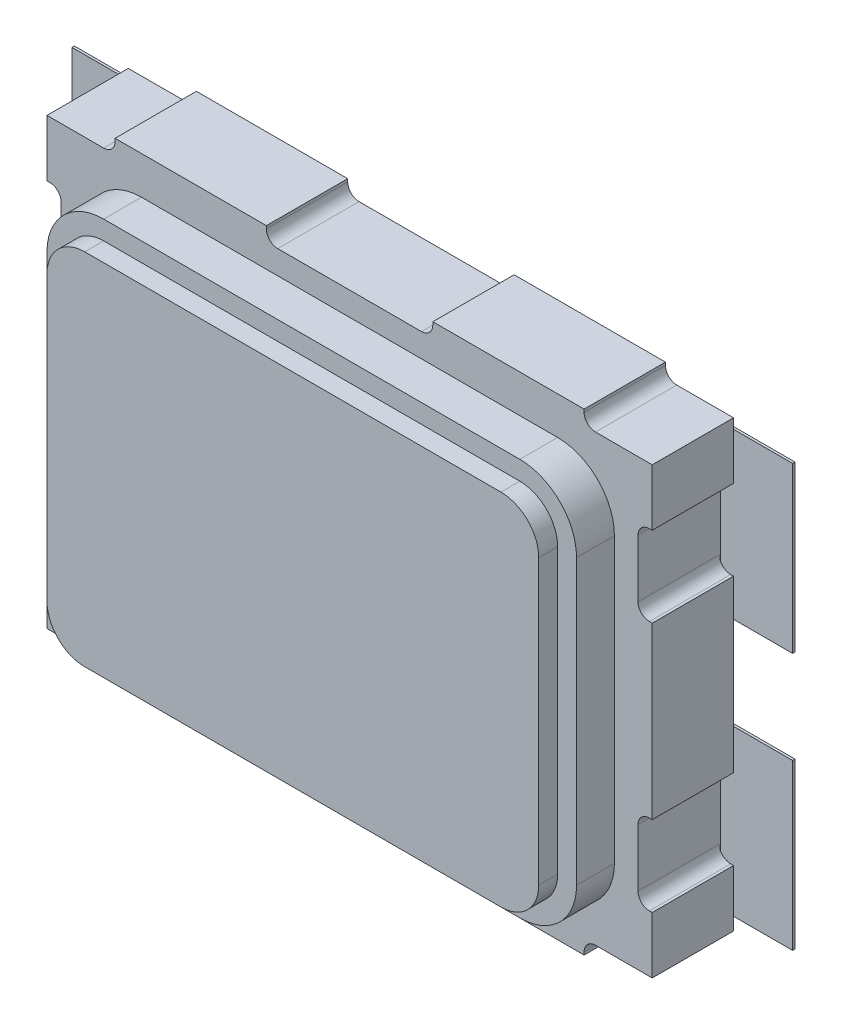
ISO-10303-21;
HEADER;
FILE_DESCRIPTION(('STEP AP214'),'2;1');
FILE_NAME('part.step','',(''),(''),'','','');
FILE_SCHEMA(('AUTOMOTIVE_DESIGN { 1 0 10303 214 1 1 1 1 }'));
ENDSEC;
DATA;
#1=APPLICATION_CONTEXT('core data for automotive mechanical design processes');
#2=APPLICATION_PROTOCOL_DEFINITION('international standard','automotive_design',2000,#1);
#3=PRODUCT_CONTEXT('',#1,'mechanical');
#4=PRODUCT('Part','Part','',(#3));
#5=PRODUCT_RELATED_PRODUCT_CATEGORY('part','',(#4));
#6=PRODUCT_DEFINITION_FORMATION('','',#4);
#7=PRODUCT_DEFINITION_CONTEXT('part definition',#1,'design');
#8=PRODUCT_DEFINITION('design','',#6,#7);
#9=PRODUCT_DEFINITION_SHAPE('','',#8);
#10=(LENGTH_UNIT() NAMED_UNIT(*) SI_UNIT(.MILLI.,.METRE.));
#11=(NAMED_UNIT(*) PLANE_ANGLE_UNIT() SI_UNIT($,.RADIAN.));
#12=(NAMED_UNIT(*) SI_UNIT($,.STERADIAN.) SOLID_ANGLE_UNIT());
#13=UNCERTAINTY_MEASURE_WITH_UNIT(LENGTH_MEASURE(1.E-05),#10,'distance_accuracy_value','');
#14=(GEOMETRIC_REPRESENTATION_CONTEXT(3) GLOBAL_UNCERTAINTY_ASSIGNED_CONTEXT((#13)) GLOBAL_UNIT_ASSIGNED_CONTEXT((#10,
#11,#12)) REPRESENTATION_CONTEXT('',''));
#15=CARTESIAN_POINT('',(0.,0.,0.));
#16=DIRECTION('',(0.,0.,1.));
#17=DIRECTION('',(1.,0.,0.));
#18=AXIS2_PLACEMENT_3D('',#15,#16,#17);
#19=CARTESIAN_POINT('',(0.,-1.25000000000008,0.826262));
#20=DIRECTION('',(0.,0.,1.));
#21=DIRECTION('',(1.,0.,0.));
#22=AXIS2_PLACEMENT_3D('',#19,#20,#21);
#23=PLANE('',#22);
#24=DIRECTION('',(1.,0.,0.));
#25=VECTOR('',#24,1.);
#26=CARTESIAN_POINT('',(1.09999999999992,0.95000000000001,0.826262));
#27=LINE('',#26,#25);
#28=CARTESIAN_POINT('',(-1.09999999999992,0.950000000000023,0.826262));
#29=VERTEX_POINT('',#28);
#30=CARTESIAN_POINT('',(1.09999999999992,0.950000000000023,0.826262));
#31=VERTEX_POINT('',#30);
#32=EDGE_CURVE('E622',#29,#31,#27,.T.);
#33=ORIENTED_EDGE('',*,*,#32,.F.);
#34=CARTESIAN_POINT('',(-1.09999999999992,0.750000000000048,0.826262));
#35=DIRECTION('',(0.,0.,1.));
#36=DIRECTION('',(1.,0.,0.));
#37=AXIS2_PLACEMENT_3D('',#34,#35,#36);
#38=CIRCLE('',#37,0.199999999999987);
#39=CARTESIAN_POINT('',(-1.29999999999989,0.750000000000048,0.826262));
#40=VERTEX_POINT('',#39);
#41=EDGE_CURVE('E604',#29,#40,#38,.T.);
#42=ORIENTED_EDGE('',*,*,#41,.T.);
#43=DIRECTION('',(0.,1.,0.));
#44=VECTOR('',#43,1.);
#45=CARTESIAN_POINT('',(-1.29999999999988,-1.25000000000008,0.826262));
#46=LINE('',#45,#44);
#47=CARTESIAN_POINT('',(-1.29999999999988,-0.750000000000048,0.826262));
#48=VERTEX_POINT('',#47);
#49=EDGE_CURVE('E598',#40,#48,#46,.F.);
#50=ORIENTED_EDGE('',*,*,#49,.T.);
#51=CARTESIAN_POINT('',(-1.09999999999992,-0.750000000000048,0.826262));
#52=DIRECTION('',(0.,0.,1.));
#53=DIRECTION('',(1.,0.,0.));
#54=AXIS2_PLACEMENT_3D('',#51,#52,#53);
#55=CIRCLE('',#54,0.199999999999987);
#56=CARTESIAN_POINT('',(-1.09999999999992,-0.950000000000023,0.826262));
#57=VERTEX_POINT('',#56);
#58=EDGE_CURVE('E19',#48,#57,#55,.T.);
#59=ORIENTED_EDGE('',*,*,#58,.T.);
#60=DIRECTION('',(1.,0.,0.));
#61=VECTOR('',#60,1.);
#62=CARTESIAN_POINT('',(-1.09999999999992,-0.95000000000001,0.826262));
#63=LINE('',#62,#61);
#64=CARTESIAN_POINT('',(1.09999999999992,-0.95000000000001,0.826262));
#65=VERTEX_POINT('',#64);
#66=EDGE_CURVE('E825',#65,#57,#63,.F.);
#67=ORIENTED_EDGE('',*,*,#66,.F.);
#68=CARTESIAN_POINT('',(1.09999999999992,-0.750000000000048,0.826262));
#69=DIRECTION('',(0.,0.,1.));
#70=DIRECTION('',(1.,0.,0.));
#71=AXIS2_PLACEMENT_3D('',#68,#69,#70);
#72=CIRCLE('',#71,0.199999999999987);
#73=CARTESIAN_POINT('',(1.29999999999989,-0.750000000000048,0.826262));
#74=VERTEX_POINT('',#73);
#75=EDGE_CURVE('E629',#74,#65,#72,.F.);
#76=ORIENTED_EDGE('',*,*,#75,.F.);
#77=DIRECTION('',(0.,1.,0.));
#78=VECTOR('',#77,1.);
#79=CARTESIAN_POINT('',(1.29999999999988,-0.750000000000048,0.826262));
#80=LINE('',#79,#78);
#81=CARTESIAN_POINT('',(1.29999999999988,0.750000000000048,0.826262));
#82=VERTEX_POINT('',#81);
#83=EDGE_CURVE('E823',#82,#74,#80,.F.);
#84=ORIENTED_EDGE('',*,*,#83,.F.);
#85=CARTESIAN_POINT('',(1.09999999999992,0.750000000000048,0.826262));
#86=DIRECTION('',(0.,0.,1.));
#87=DIRECTION('',(1.,0.,0.));
#88=AXIS2_PLACEMENT_3D('',#85,#86,#87);
#89=CIRCLE('',#88,0.199999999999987);
#90=EDGE_CURVE('E626',#31,#82,#89,.F.);
#91=ORIENTED_EDGE('',*,*,#90,.F.);
#92=EDGE_LOOP('',(#33,#42,#50,#59,#67,#76,#84,#91));
#93=FACE_BOUND('',#92,.T.);
#94=ADVANCED_FACE('F16',(#93),#23,.T.);
#95=CARTESIAN_POINT('',(1.09999999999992,0.95000000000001,0.726261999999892));
#96=DIRECTION('',(0.,1.,0.));
#97=DIRECTION('',(0.,0.,1.));
#98=AXIS2_PLACEMENT_3D('',#95,#96,#97);
#99=PLANE('',#98);
#100=DIRECTION('',(0.,0.,1.));
#101=VECTOR('',#100,1.);
#102=CARTESIAN_POINT('',(1.09999999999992,0.950000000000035,0.726261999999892));
#103=LINE('',#102,#101);
#104=CARTESIAN_POINT('',(1.09999999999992,0.950000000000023,0.726261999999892));
#105=VERTEX_POINT('',#104);
#106=EDGE_CURVE('E623',#105,#31,#103,.T.);
#107=ORIENTED_EDGE('',*,*,#106,.F.);
#108=DIRECTION('',(1.,0.,0.));
#109=VECTOR('',#108,1.);
#110=CARTESIAN_POINT('',(0.,0.95000000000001,0.726261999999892));
#111=LINE('',#110,#109);
#112=CARTESIAN_POINT('',(-1.09999999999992,0.950000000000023,0.726261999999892));
#113=VERTEX_POINT('',#112);
#114=EDGE_CURVE('E636',#113,#105,#111,.T.);
#115=ORIENTED_EDGE('',*,*,#114,.F.);
#116=DIRECTION('',(0.,0.,1.));
#117=VECTOR('',#116,1.);
#118=CARTESIAN_POINT('',(-1.09999999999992,0.950000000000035,0.726261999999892));
#119=LINE('',#118,#117);
#120=EDGE_CURVE('E837',#29,#113,#119,.F.);
#121=ORIENTED_EDGE('',*,*,#120,.F.);
#122=ORIENTED_EDGE('',*,*,#32,.T.);
#123=EDGE_LOOP('',(#107,#115,#121,#122));
#124=FACE_BOUND('',#123,.T.);
#125=ADVANCED_FACE('F2875',(#124),#99,.T.);
#126=CARTESIAN_POINT('',(1.09999999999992,0.750000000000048,0.726261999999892));
#127=DIRECTION('',(0.,0.,1.));
#128=DIRECTION('',(1.,0.,0.));
#129=AXIS2_PLACEMENT_3D('',#126,#127,#128);
#130=CYLINDRICAL_SURFACE('',#129,0.199999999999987);
#131=DIRECTION('',(0.,0.,-1.));
#132=VECTOR('',#131,1.);
#133=CARTESIAN_POINT('',(1.29999999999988,0.750000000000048,0.726261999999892));
#134=LINE('',#133,#132);
#135=CARTESIAN_POINT('',(1.29999999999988,0.750000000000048,0.726261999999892));
#136=VERTEX_POINT('',#135);
#137=EDGE_CURVE('E628',#136,#82,#134,.F.);
#138=ORIENTED_EDGE('',*,*,#137,.F.);
#139=CARTESIAN_POINT('',(1.09999999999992,0.750000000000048,0.726261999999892));
#140=DIRECTION('',(0.,0.,1.));
#141=DIRECTION('',(1.,0.,0.));
#142=AXIS2_PLACEMENT_3D('',#139,#140,#141);
#143=CIRCLE('',#142,0.199999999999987);
#144=EDGE_CURVE('E633',#105,#136,#143,.F.);
#145=ORIENTED_EDGE('',*,*,#144,.F.);
#146=ORIENTED_EDGE('',*,*,#106,.T.);
#147=ORIENTED_EDGE('',*,*,#90,.T.);
#148=EDGE_LOOP('',(#138,#145,#146,#147));
#149=FACE_BOUND('',#148,.T.);
#150=ADVANCED_FACE('F2865',(#149),#130,.T.);
#151=CARTESIAN_POINT('',(1.29999999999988,-0.750000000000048,0.726261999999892));
#152=DIRECTION('',(1.,0.,0.));
#153=DIRECTION('',(0.,0.,-1.));
#154=AXIS2_PLACEMENT_3D('',#151,#152,#153);
#155=PLANE('',#154);
#156=DIRECTION('',(0.,0.,1.));
#157=VECTOR('',#156,1.);
#158=CARTESIAN_POINT('',(1.29999999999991,-0.750000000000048,0.726261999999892));
#159=LINE('',#158,#157);
#160=CARTESIAN_POINT('',(1.29999999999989,-0.750000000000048,0.726261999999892));
#161=VERTEX_POINT('',#160);
#162=EDGE_CURVE('E632',#161,#74,#159,.T.);
#163=ORIENTED_EDGE('',*,*,#162,.F.);
#164=DIRECTION('',(0.,1.,0.));
#165=VECTOR('',#164,1.);
#166=CARTESIAN_POINT('',(1.29999999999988,-1.25000000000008,0.726261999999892));
#167=LINE('',#166,#165);
#168=EDGE_CURVE('E635',#136,#161,#167,.F.);
#169=ORIENTED_EDGE('',*,*,#168,.F.);
#170=ORIENTED_EDGE('',*,*,#137,.T.);
#171=ORIENTED_EDGE('',*,*,#83,.T.);
#172=EDGE_LOOP('',(#163,#169,#170,#171));
#173=FACE_BOUND('',#172,.T.);
#174=ADVANCED_FACE('F2855',(#173),#155,.T.);
#175=CARTESIAN_POINT('',(1.09999999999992,-0.750000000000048,0.726261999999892));
#176=DIRECTION('',(0.,0.,1.));
#177=DIRECTION('',(1.,0.,0.));
#178=AXIS2_PLACEMENT_3D('',#175,#176,#177);
#179=CYLINDRICAL_SURFACE('',#178,0.199999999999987);
#180=DIRECTION('',(0.,0.,-1.));
#181=VECTOR('',#180,1.);
#182=CARTESIAN_POINT('',(1.09999999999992,-0.95000000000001,0.726261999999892));
#183=LINE('',#182,#181);
#184=CARTESIAN_POINT('',(1.09999999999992,-0.95000000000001,0.726261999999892));
#185=VERTEX_POINT('',#184);
#186=EDGE_CURVE('E631',#185,#65,#183,.F.);
#187=ORIENTED_EDGE('',*,*,#186,.F.);
#188=CARTESIAN_POINT('',(1.09999999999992,-0.750000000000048,0.726261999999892));
#189=DIRECTION('',(0.,0.,1.));
#190=DIRECTION('',(1.,0.,0.));
#191=AXIS2_PLACEMENT_3D('',#188,#189,#190);
#192=CIRCLE('',#191,0.199999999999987);
#193=EDGE_CURVE('E637',#161,#185,#192,.F.);
#194=ORIENTED_EDGE('',*,*,#193,.F.);
#195=ORIENTED_EDGE('',*,*,#162,.T.);
#196=ORIENTED_EDGE('',*,*,#75,.T.);
#197=EDGE_LOOP('',(#187,#194,#195,#196));
#198=FACE_BOUND('',#197,.T.);
#199=ADVANCED_FACE('F2845',(#198),#179,.T.);
#200=CARTESIAN_POINT('',(-1.09999999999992,-0.95000000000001,0.726261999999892));
#201=DIRECTION('',(0.,-1.,0.));
#202=DIRECTION('',(0.,0.,-1.));
#203=AXIS2_PLACEMENT_3D('',#200,#201,#202);
#204=PLANE('',#203);
#205=DIRECTION('',(0.,0.,1.));
#206=VECTOR('',#205,1.);
#207=CARTESIAN_POINT('',(-1.09999999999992,-0.950000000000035,0.726261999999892));
#208=LINE('',#207,#206);
#209=CARTESIAN_POINT('',(-1.09999999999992,-0.950000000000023,0.726261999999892));
#210=VERTEX_POINT('',#209);
#211=EDGE_CURVE('E617',#210,#57,#208,.T.);
#212=ORIENTED_EDGE('',*,*,#211,.F.);
#213=DIRECTION('',(1.,0.,0.));
#214=VECTOR('',#213,1.);
#215=CARTESIAN_POINT('',(0.,-0.95000000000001,0.726261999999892));
#216=LINE('',#215,#214);
#217=EDGE_CURVE('E639',#185,#210,#216,.F.);
#218=ORIENTED_EDGE('',*,*,#217,.F.);
#219=ORIENTED_EDGE('',*,*,#186,.T.);
#220=ORIENTED_EDGE('',*,*,#66,.T.);
#221=EDGE_LOOP('',(#212,#218,#219,#220));
#222=FACE_BOUND('',#221,.T.);
#223=ADVANCED_FACE('F2836',(#222),#204,.T.);
#224=CARTESIAN_POINT('',(-1.09999999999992,-0.750000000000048,0.726261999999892));
#225=DIRECTION('',(0.,0.,1.));
#226=DIRECTION('',(1.,0.,0.));
#227=AXIS2_PLACEMENT_3D('',#224,#225,#226);
#228=CYLINDRICAL_SURFACE('',#227,0.199999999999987);
#229=DIRECTION('',(0.,0.,1.));
#230=VECTOR('',#229,1.);
#231=CARTESIAN_POINT('',(-1.29999999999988,-0.750000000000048,0.726261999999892));
#232=LINE('',#231,#230);
#233=CARTESIAN_POINT('',(-1.29999999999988,-0.750000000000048,0.726261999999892));
#234=VERTEX_POINT('',#233);
#235=EDGE_CURVE('E611',#234,#48,#232,.T.);
#236=ORIENTED_EDGE('',*,*,#235,.F.);
#237=CARTESIAN_POINT('',(-1.09999999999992,-0.750000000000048,0.726261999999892));
#238=DIRECTION('',(0.,0.,1.));
#239=DIRECTION('',(1.,0.,0.));
#240=AXIS2_PLACEMENT_3D('',#237,#238,#239);
#241=CIRCLE('',#240,0.199999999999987);
#242=EDGE_CURVE('E640',#210,#234,#241,.F.);
#243=ORIENTED_EDGE('',*,*,#242,.F.);
#244=ORIENTED_EDGE('',*,*,#211,.T.);
#245=ORIENTED_EDGE('',*,*,#58,.F.);
#246=EDGE_LOOP('',(#236,#243,#244,#245));
#247=FACE_BOUND('',#246,.T.);
#248=ADVANCED_FACE('F620',(#247),#228,.T.);
#249=CARTESIAN_POINT('',(-1.29999999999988,0.750000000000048,0.726261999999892));
#250=DIRECTION('',(-1.,0.,0.));
#251=DIRECTION('',(0.,0.,1.));
#252=AXIS2_PLACEMENT_3D('',#249,#250,#251);
#253=PLANE('',#252);
#254=DIRECTION('',(0.,0.,1.));
#255=VECTOR('',#254,1.);
#256=CARTESIAN_POINT('',(-1.29999999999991,0.750000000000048,0.726261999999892));
#257=LINE('',#256,#255);
#258=CARTESIAN_POINT('',(-1.29999999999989,0.750000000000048,0.726261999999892));
#259=VERTEX_POINT('',#258);
#260=EDGE_CURVE('E616',#259,#40,#257,.T.);
#261=ORIENTED_EDGE('',*,*,#260,.F.);
#262=DIRECTION('',(0.,1.,0.));
#263=VECTOR('',#262,1.);
#264=CARTESIAN_POINT('',(-1.29999999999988,-1.25000000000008,0.726261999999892));
#265=LINE('',#264,#263);
#266=EDGE_CURVE('E613',#234,#259,#265,.T.);
#267=ORIENTED_EDGE('',*,*,#266,.F.);
#268=ORIENTED_EDGE('',*,*,#235,.T.);
#269=ORIENTED_EDGE('',*,*,#49,.F.);
#270=EDGE_LOOP('',(#261,#267,#268,#269));
#271=FACE_BOUND('',#270,.T.);
#272=ADVANCED_FACE('F612',(#271),#253,.T.);
#273=CARTESIAN_POINT('',(-1.09999999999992,0.750000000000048,0.726261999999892));
#274=DIRECTION('',(0.,0.,1.));
#275=DIRECTION('',(1.,0.,0.));
#276=AXIS2_PLACEMENT_3D('',#273,#274,#275);
#277=CYLINDRICAL_SURFACE('',#276,0.199999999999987);
#278=ORIENTED_EDGE('',*,*,#120,.T.);
#279=CARTESIAN_POINT('',(-1.09999999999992,0.750000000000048,0.726261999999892));
#280=DIRECTION('',(0.,0.,1.));
#281=DIRECTION('',(1.,0.,0.));
#282=AXIS2_PLACEMENT_3D('',#279,#280,#281);
#283=CIRCLE('',#282,0.199999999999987);
#284=EDGE_CURVE('E642',#259,#113,#283,.F.);
#285=ORIENTED_EDGE('',*,*,#284,.F.);
#286=ORIENTED_EDGE('',*,*,#260,.T.);
#287=ORIENTED_EDGE('',*,*,#41,.F.);
#288=EDGE_LOOP('',(#278,#285,#286,#287));
#289=FACE_BOUND('',#288,.T.);
#290=ADVANCED_FACE('F2809',(#289),#277,.T.);
#291=CARTESIAN_POINT('',(0.,-1.25000000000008,0.726261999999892));
#292=DIRECTION('',(0.,0.,1.));
#293=DIRECTION('',(1.,0.,0.));
#294=AXIS2_PLACEMENT_3D('',#291,#292,#293);
#295=PLANE('',#294);
#296=ORIENTED_EDGE('',*,*,#266,.T.);
#297=ORIENTED_EDGE('',*,*,#284,.T.);
#298=ORIENTED_EDGE('',*,*,#114,.T.);
#299=ORIENTED_EDGE('',*,*,#144,.T.);
#300=ORIENTED_EDGE('',*,*,#168,.T.);
#301=ORIENTED_EDGE('',*,*,#193,.T.);
#302=ORIENTED_EDGE('',*,*,#217,.T.);
#303=ORIENTED_EDGE('',*,*,#242,.T.);
#304=EDGE_LOOP('',(#296,#297,#298,#299,#300,#301,#302,#303));
#305=FACE_BOUND('',#304,.T.);
#306=DIRECTION('',(1.,0.,0.));
#307=VECTOR('',#306,1.);
#308=CARTESIAN_POINT('',(1.09999999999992,1.05000000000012,0.726261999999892));
#309=LINE('',#308,#307);
#310=CARTESIAN_POINT('',(-1.09999999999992,1.05000000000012,0.726261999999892));
#311=VERTEX_POINT('',#310);
#312=CARTESIAN_POINT('',(1.09999999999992,1.05000000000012,0.726261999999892));
#313=VERTEX_POINT('',#312);
#314=EDGE_CURVE('E848',#311,#313,#309,.T.);
#315=ORIENTED_EDGE('',*,*,#314,.F.);
#316=CARTESIAN_POINT('',(-1.09999999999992,0.750000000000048,0.726261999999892));
#317=DIRECTION('',(0.,0.,1.));
#318=DIRECTION('',(1.,0.,0.));
#319=AXIS2_PLACEMENT_3D('',#316,#317,#318);
#320=CIRCLE('',#319,0.30000000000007);
#321=CARTESIAN_POINT('',(-1.39999999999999,0.750000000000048,0.726261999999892));
#322=VERTEX_POINT('',#321);
#323=EDGE_CURVE('E645',#322,#311,#320,.F.);
#324=ORIENTED_EDGE('',*,*,#323,.F.);
#325=DIRECTION('',(0.,1.,0.));
#326=VECTOR('',#325,1.);
#327=CARTESIAN_POINT('',(-1.39999999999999,0.750000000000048,0.726261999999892));
#328=LINE('',#327,#326);
#329=CARTESIAN_POINT('',(-1.39999999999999,-0.750000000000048,0.726261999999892));
#330=VERTEX_POINT('',#329);
#331=EDGE_CURVE('E647',#330,#322,#328,.T.);
#332=ORIENTED_EDGE('',*,*,#331,.F.);
#333=CARTESIAN_POINT('',(-1.09999999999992,-0.750000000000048,0.726261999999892));
#334=DIRECTION('',(0.,0.,1.));
#335=DIRECTION('',(1.,0.,0.));
#336=AXIS2_PLACEMENT_3D('',#333,#334,#335);
#337=CIRCLE('',#336,0.30000000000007);
#338=CARTESIAN_POINT('',(-1.09999999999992,-1.05000000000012,0.726261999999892));
#339=VERTEX_POINT('',#338);
#340=EDGE_CURVE('E648',#339,#330,#337,.F.);
#341=ORIENTED_EDGE('',*,*,#340,.F.);
#342=DIRECTION('',(1.,0.,0.));
#343=VECTOR('',#342,1.);
#344=CARTESIAN_POINT('',(-1.09999999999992,-1.05000000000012,0.726261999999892));
#345=LINE('',#344,#343);
#346=CARTESIAN_POINT('',(1.09999999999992,-1.05000000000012,0.726261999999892));
#347=VERTEX_POINT('',#346);
#348=EDGE_CURVE('E840',#347,#339,#345,.F.);
#349=ORIENTED_EDGE('',*,*,#348,.F.);
#350=CARTESIAN_POINT('',(1.09999999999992,-0.750000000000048,0.726261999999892));
#351=DIRECTION('',(0.,0.,1.));
#352=DIRECTION('',(1.,0.,0.));
#353=AXIS2_PLACEMENT_3D('',#350,#351,#352);
#354=CIRCLE('',#353,0.30000000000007);
#355=CARTESIAN_POINT('',(1.39999999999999,-0.750000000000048,0.726261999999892));
#356=VERTEX_POINT('',#355);
#357=EDGE_CURVE('E652',#356,#347,#354,.F.);
#358=ORIENTED_EDGE('',*,*,#357,.F.);
#359=DIRECTION('',(0.,1.,0.));
#360=VECTOR('',#359,1.);
#361=CARTESIAN_POINT('',(1.39999999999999,-0.750000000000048,0.726261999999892));
#362=LINE('',#361,#360);
#363=CARTESIAN_POINT('',(1.39999999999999,0.750000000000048,0.726261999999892));
#364=VERTEX_POINT('',#363);
#365=EDGE_CURVE('E842',#364,#356,#362,.F.);
#366=ORIENTED_EDGE('',*,*,#365,.F.);
#367=CARTESIAN_POINT('',(1.09999999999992,0.750000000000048,0.726261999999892));
#368=DIRECTION('',(0.,0.,1.));
#369=DIRECTION('',(1.,0.,0.));
#370=AXIS2_PLACEMENT_3D('',#367,#368,#369);
#371=CIRCLE('',#370,0.30000000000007);
#372=EDGE_CURVE('E656',#313,#364,#371,.F.);
#373=ORIENTED_EDGE('',*,*,#372,.F.);
#374=EDGE_LOOP('',(#315,#324,#332,#341,#349,#358,#366,#373));
#375=FACE_BOUND('',#374,.T.);
#376=ADVANCED_FACE('F2799',(#305,#375),#295,.T.);
#377=CARTESIAN_POINT('',(-1.09999999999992,0.750000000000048,0.52626199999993));
#378=DIRECTION('',(0.,0.,1.));
#379=DIRECTION('',(1.,0.,0.));
#380=AXIS2_PLACEMENT_3D('',#377,#378,#379);
#381=CYLINDRICAL_SURFACE('',#380,0.30000000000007);
#382=DIRECTION('',(0.,0.,1.));
#383=VECTOR('',#382,1.);
#384=CARTESIAN_POINT('',(-1.09999999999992,1.05000000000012,0.52626199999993));
#385=LINE('',#384,#383);
#386=CARTESIAN_POINT('',(-1.09999999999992,1.05000000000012,0.52626199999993));
#387=VERTEX_POINT('',#386);
#388=EDGE_CURVE('E851',#387,#311,#385,.T.);
#389=ORIENTED_EDGE('',*,*,#388,.F.);
#390=CARTESIAN_POINT('',(-1.09999999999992,0.750000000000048,0.52626199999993));
#391=DIRECTION('',(0.,0.,1.));
#392=DIRECTION('',(1.,0.,0.));
#393=AXIS2_PLACEMENT_3D('',#390,#391,#392);
#394=CIRCLE('',#393,0.30000000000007);
#395=CARTESIAN_POINT('',(-1.39999999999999,0.750000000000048,0.52626199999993));
#396=VERTEX_POINT('',#395);
#397=EDGE_CURVE('E660',#387,#396,#394,.T.);
#398=ORIENTED_EDGE('',*,*,#397,.T.);
#399=DIRECTION('',(0.,0.,1.));
#400=VECTOR('',#399,1.);
#401=CARTESIAN_POINT('',(-1.39999999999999,0.750000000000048,0.52626199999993));
#402=LINE('',#401,#400);
#403=EDGE_CURVE('E651',#322,#396,#402,.F.);
#404=ORIENTED_EDGE('',*,*,#403,.F.);
#405=ORIENTED_EDGE('',*,*,#323,.T.);
#406=EDGE_LOOP('',(#389,#398,#404,#405));
#407=FACE_BOUND('',#406,.T.);
#408=ADVANCED_FACE('F2789',(#407),#381,.T.);
#409=CARTESIAN_POINT('',(-1.39999999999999,0.750000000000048,0.52626199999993));
#410=DIRECTION('',(-1.,0.,0.));
#411=DIRECTION('',(0.,0.,1.));
#412=AXIS2_PLACEMENT_3D('',#409,#410,#411);
#413=PLANE('',#412);
#414=ORIENTED_EDGE('',*,*,#403,.T.);
#415=DIRECTION('',(0.,1.,0.));
#416=VECTOR('',#415,1.);
#417=CARTESIAN_POINT('',(-1.39999999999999,-1.25000000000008,0.52626199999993));
#418=LINE('',#417,#416);
#419=CARTESIAN_POINT('',(-1.39999999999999,-0.750000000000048,0.52626199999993));
#420=VERTEX_POINT('',#419);
#421=EDGE_CURVE('E663',#396,#420,#418,.F.);
#422=ORIENTED_EDGE('',*,*,#421,.T.);
#423=DIRECTION('',(0.,0.,1.));
#424=VECTOR('',#423,1.);
#425=CARTESIAN_POINT('',(-1.39999999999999,-0.750000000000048,0.52626199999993));
#426=LINE('',#425,#424);
#427=EDGE_CURVE('E650',#330,#420,#426,.F.);
#428=ORIENTED_EDGE('',*,*,#427,.F.);
#429=ORIENTED_EDGE('',*,*,#331,.T.);
#430=EDGE_LOOP('',(#414,#422,#428,#429));
#431=FACE_BOUND('',#430,.T.);
#432=ADVANCED_FACE('F2779',(#431),#413,.T.);
#433=CARTESIAN_POINT('',(-1.09999999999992,-0.750000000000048,0.52626199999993));
#434=DIRECTION('',(0.,0.,1.));
#435=DIRECTION('',(1.,0.,0.));
#436=AXIS2_PLACEMENT_3D('',#433,#434,#435);
#437=CYLINDRICAL_SURFACE('',#436,0.30000000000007);
#438=ORIENTED_EDGE('',*,*,#427,.T.);
#439=CARTESIAN_POINT('',(-1.09999999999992,-0.750000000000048,0.52626199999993));
#440=DIRECTION('',(0.,0.,1.));
#441=DIRECTION('',(1.,0.,0.));
#442=AXIS2_PLACEMENT_3D('',#439,#440,#441);
#443=CIRCLE('',#442,0.30000000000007);
#444=CARTESIAN_POINT('',(-1.09999999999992,-1.05000000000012,0.52626199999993));
#445=VERTEX_POINT('',#444);
#446=EDGE_CURVE('E665',#420,#445,#443,.T.);
#447=ORIENTED_EDGE('',*,*,#446,.T.);
#448=DIRECTION('',(0.,0.,-1.));
#449=VECTOR('',#448,1.);
#450=CARTESIAN_POINT('',(-1.09999999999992,-1.05000000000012,0.52626199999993));
#451=LINE('',#450,#449);
#452=EDGE_CURVE('E655',#339,#445,#451,.T.);
#453=ORIENTED_EDGE('',*,*,#452,.F.);
#454=ORIENTED_EDGE('',*,*,#340,.T.);
#455=EDGE_LOOP('',(#438,#447,#453,#454));
#456=FACE_BOUND('',#455,.T.);
#457=ADVANCED_FACE('F2769',(#456),#437,.T.);
#458=CARTESIAN_POINT('',(-1.09999999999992,-1.05000000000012,0.52626199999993));
#459=DIRECTION('',(0.,-1.,0.));
#460=DIRECTION('',(0.,0.,-1.));
#461=AXIS2_PLACEMENT_3D('',#458,#459,#460);
#462=PLANE('',#461);
#463=ORIENTED_EDGE('',*,*,#452,.T.);
#464=DIRECTION('',(-1.,0.,0.));
#465=VECTOR('',#464,1.);
#466=CARTESIAN_POINT('',(-1.59999999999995,-1.05000000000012,0.52626199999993));
#467=LINE('',#466,#465);
#468=CARTESIAN_POINT('',(1.09999999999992,-1.05000000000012,0.52626199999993));
#469=VERTEX_POINT('',#468);
#470=EDGE_CURVE('E668',#445,#469,#467,.F.);
#471=ORIENTED_EDGE('',*,*,#470,.T.);
#472=DIRECTION('',(0.,0.,1.));
#473=VECTOR('',#472,1.);
#474=CARTESIAN_POINT('',(1.09999999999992,-1.05000000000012,0.52626199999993));
#475=LINE('',#474,#473);
#476=EDGE_CURVE('E654',#347,#469,#475,.F.);
#477=ORIENTED_EDGE('',*,*,#476,.F.);
#478=ORIENTED_EDGE('',*,*,#348,.T.);
#479=EDGE_LOOP('',(#463,#471,#477,#478));
#480=FACE_BOUND('',#479,.T.);
#481=ADVANCED_FACE('F2759',(#480),#462,.T.);
#482=CARTESIAN_POINT('',(1.09999999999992,-0.750000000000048,0.52626199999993));
#483=DIRECTION('',(0.,0.,1.));
#484=DIRECTION('',(1.,0.,0.));
#485=AXIS2_PLACEMENT_3D('',#482,#483,#484);
#486=CYLINDRICAL_SURFACE('',#485,0.30000000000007);
#487=ORIENTED_EDGE('',*,*,#476,.T.);
#488=CARTESIAN_POINT('',(1.09999999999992,-0.750000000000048,0.52626199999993));
#489=DIRECTION('',(0.,0.,1.));
#490=DIRECTION('',(1.,0.,0.));
#491=AXIS2_PLACEMENT_3D('',#488,#489,#490);
#492=CIRCLE('',#491,0.30000000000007);
#493=CARTESIAN_POINT('',(1.39999999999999,-0.750000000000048,0.52626199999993));
#494=VERTEX_POINT('',#493);
#495=EDGE_CURVE('E669',#469,#494,#492,.T.);
#496=ORIENTED_EDGE('',*,*,#495,.T.);
#497=DIRECTION('',(0.,0.,-1.));
#498=VECTOR('',#497,1.);
#499=CARTESIAN_POINT('',(1.39999999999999,-0.750000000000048,0.52626199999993));
#500=LINE('',#499,#498);
#501=EDGE_CURVE('E659',#356,#494,#500,.T.);
#502=ORIENTED_EDGE('',*,*,#501,.F.);
#503=ORIENTED_EDGE('',*,*,#357,.T.);
#504=EDGE_LOOP('',(#487,#496,#502,#503));
#505=FACE_BOUND('',#504,.T.);
#506=ADVANCED_FACE('F2749',(#505),#486,.T.);
#507=CARTESIAN_POINT('',(1.39999999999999,-0.750000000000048,0.52626199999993));
#508=DIRECTION('',(1.,0.,0.));
#509=DIRECTION('',(0.,0.,-1.));
#510=AXIS2_PLACEMENT_3D('',#507,#508,#509);
#511=PLANE('',#510);
#512=ORIENTED_EDGE('',*,*,#501,.T.);
#513=DIRECTION('',(0.,1.,0.));
#514=VECTOR('',#513,1.);
#515=CARTESIAN_POINT('',(1.39999999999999,-1.25000000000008,0.52626199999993));
#516=LINE('',#515,#514);
#517=CARTESIAN_POINT('',(1.39999999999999,0.750000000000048,0.52626199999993));
#518=VERTEX_POINT('',#517);
#519=EDGE_CURVE('E672',#494,#518,#516,.T.);
#520=ORIENTED_EDGE('',*,*,#519,.T.);
#521=DIRECTION('',(0.,0.,1.));
#522=VECTOR('',#521,1.);
#523=CARTESIAN_POINT('',(1.39999999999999,0.750000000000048,0.52626199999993));
#524=LINE('',#523,#522);
#525=EDGE_CURVE('E658',#364,#518,#524,.F.);
#526=ORIENTED_EDGE('',*,*,#525,.F.);
#527=ORIENTED_EDGE('',*,*,#365,.T.);
#528=EDGE_LOOP('',(#512,#520,#526,#527));
#529=FACE_BOUND('',#528,.T.);
#530=ADVANCED_FACE('F2739',(#529),#511,.T.);
#531=CARTESIAN_POINT('',(1.09999999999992,0.750000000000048,0.52626199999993));
#532=DIRECTION('',(0.,0.,1.));
#533=DIRECTION('',(1.,0.,0.));
#534=AXIS2_PLACEMENT_3D('',#531,#532,#533);
#535=CYLINDRICAL_SURFACE('',#534,0.30000000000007);
#536=ORIENTED_EDGE('',*,*,#525,.T.);
#537=CARTESIAN_POINT('',(1.09999999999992,0.750000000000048,0.52626199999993));
#538=DIRECTION('',(0.,0.,1.));
#539=DIRECTION('',(1.,0.,0.));
#540=AXIS2_PLACEMENT_3D('',#537,#538,#539);
#541=CIRCLE('',#540,0.30000000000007);
#542=CARTESIAN_POINT('',(1.09999999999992,1.05000000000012,0.52626199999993));
#543=VERTEX_POINT('',#542);
#544=EDGE_CURVE('E673',#518,#543,#541,.T.);
#545=ORIENTED_EDGE('',*,*,#544,.T.);
#546=DIRECTION('',(0.,0.,1.));
#547=VECTOR('',#546,1.);
#548=CARTESIAN_POINT('',(1.09999999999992,1.05000000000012,0.52626199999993));
#549=LINE('',#548,#547);
#550=EDGE_CURVE('E850',#313,#543,#549,.F.);
#551=ORIENTED_EDGE('',*,*,#550,.F.);
#552=ORIENTED_EDGE('',*,*,#372,.T.);
#553=EDGE_LOOP('',(#536,#545,#551,#552));
#554=FACE_BOUND('',#553,.T.);
#555=ADVANCED_FACE('F2730',(#554),#535,.T.);
#556=CARTESIAN_POINT('',(1.09999999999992,1.05000000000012,0.52626199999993));
#557=DIRECTION('',(0.,1.,0.));
#558=DIRECTION('',(0.,0.,1.));
#559=AXIS2_PLACEMENT_3D('',#556,#557,#558);
#560=PLANE('',#559);
#561=ORIENTED_EDGE('',*,*,#550,.T.);
#562=DIRECTION('',(-1.,0.,0.));
#563=VECTOR('',#562,1.);
#564=CARTESIAN_POINT('',(-1.59999999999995,1.05000000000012,0.52626199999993));
#565=LINE('',#564,#563);
#566=EDGE_CURVE('E676',#543,#387,#565,.T.);
#567=ORIENTED_EDGE('',*,*,#566,.T.);
#568=ORIENTED_EDGE('',*,*,#388,.T.);
#569=ORIENTED_EDGE('',*,*,#314,.T.);
#570=EDGE_LOOP('',(#561,#567,#568,#569));
#571=FACE_BOUND('',#570,.T.);
#572=ADVANCED_FACE('F2722',(#571),#560,.T.);
#573=CARTESIAN_POINT('',(1.12500000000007,-1.11500000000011,0.0762));
#574=DIRECTION('',(0.,-1.,0.));
#575=DIRECTION('',(0.,0.,-1.));
#576=AXIS2_PLACEMENT_3D('',#573,#574,#575);
#577=PLANE('',#576);
#578=DIRECTION('',(0.,0.,1.));
#579=VECTOR('',#578,1.);
#580=CARTESIAN_POINT('',(1.12500000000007,-1.11500000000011,0.0961999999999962));
#581=LINE('',#580,#579);
#582=CARTESIAN_POINT('',(1.12500000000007,-1.11500000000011,0.0762));
#583=VERTEX_POINT('',#582);
#584=CARTESIAN_POINT('',(1.12500000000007,-1.11500000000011,0.0889));
#585=VERTEX_POINT('',#584);
#586=EDGE_CURVE('E912',#583,#585,#581,.T.);
#587=ORIENTED_EDGE('',*,*,#586,.F.);
#588=DIRECTION('',(1.,0.,0.));
#589=VECTOR('',#588,1.);
#590=CARTESIAN_POINT('',(0.,-1.11500000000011,0.0762));
#591=LINE('',#590,#589);
#592=CARTESIAN_POINT('',(1.905,-1.11500000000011,0.0762));
#593=VERTEX_POINT('',#592);
#594=EDGE_CURVE('E858',#583,#593,#591,.T.);
#595=ORIENTED_EDGE('',*,*,#594,.T.);
#596=DIRECTION('',(0.,0.,-1.));
#597=VECTOR('',#596,1.);
#598=CARTESIAN_POINT('',(1.905,-1.11500000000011,0.0762));
#599=LINE('',#598,#597);
#600=CARTESIAN_POINT('',(1.905,-1.11500000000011,0.0889));
#601=VERTEX_POINT('',#600);
#602=EDGE_CURVE('E902',#601,#593,#599,.T.);
#603=ORIENTED_EDGE('',*,*,#602,.F.);
#604=DIRECTION('',(1.,0.,0.));
#605=VECTOR('',#604,1.);
#606=CARTESIAN_POINT('',(0.,-1.11500000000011,0.0889));
#607=LINE('',#606,#605);
#608=EDGE_CURVE('E918',#585,#601,#607,.T.);
#609=ORIENTED_EDGE('',*,*,#608,.F.);
#610=EDGE_LOOP('',(#587,#595,#603,#609));
#611=FACE_BOUND('',#610,.T.);
#612=ADVANCED_FACE('F1818',(#611),#577,.T.);
#613=CARTESIAN_POINT('',(1.905,-1.11500000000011,0.0762));
#614=DIRECTION('',(1.,0.,0.));
#615=DIRECTION('',(0.,0.,-1.));
#616=AXIS2_PLACEMENT_3D('',#613,#614,#615);
#617=PLANE('',#616);
#618=ORIENTED_EDGE('',*,*,#602,.T.);
#619=DIRECTION('',(0.,1.,0.));
#620=VECTOR('',#619,1.);
#621=CARTESIAN_POINT('',(1.905,0.,0.0762));
#622=LINE('',#621,#620);
#623=CARTESIAN_POINT('',(1.905,-0.245000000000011,0.0762));
#624=VERTEX_POINT('',#623);
#625=EDGE_CURVE('E854',#593,#624,#622,.T.);
#626=ORIENTED_EDGE('',*,*,#625,.T.);
#627=DIRECTION('',(0.,0.,1.));
#628=VECTOR('',#627,1.);
#629=CARTESIAN_POINT('',(1.905,-0.245000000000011,0.0961999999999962));
#630=LINE('',#629,#628);
#631=CARTESIAN_POINT('',(1.905,-0.245000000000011,0.0889));
#632=VERTEX_POINT('',#631);
#633=EDGE_CURVE('E925',#632,#624,#630,.F.);
#634=ORIENTED_EDGE('',*,*,#633,.F.);
#635=DIRECTION('',(0.,1.,0.));
#636=VECTOR('',#635,1.);
#637=CARTESIAN_POINT('',(1.905,0.,0.0889));
#638=LINE('',#637,#636);
#639=EDGE_CURVE('E920',#601,#632,#638,.T.);
#640=ORIENTED_EDGE('',*,*,#639,.F.);
#641=EDGE_LOOP('',(#618,#626,#634,#640));
#642=FACE_BOUND('',#641,.T.);
#643=ADVANCED_FACE('F1809',(#642),#617,.T.);
#644=CARTESIAN_POINT('',(0.,0.,0.0762));
#645=DIRECTION('',(0.,0.,1.));
#646=DIRECTION('',(1.,0.,0.));
#647=AXIS2_PLACEMENT_3D('',#644,#645,#646);
#648=PLANE('',#647);
#649=ORIENTED_EDGE('',*,*,#625,.F.);
#650=ORIENTED_EDGE('',*,*,#594,.F.);
#651=DIRECTION('',(0.,1.,0.));
#652=VECTOR('',#651,1.);
#653=CARTESIAN_POINT('',(1.12500000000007,-1.09499999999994,0.0762));
#654=LINE('',#653,#652);
#655=CARTESIAN_POINT('',(1.12500000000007,-0.245000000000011,0.0762));
#656=VERTEX_POINT('',#655);
#657=EDGE_CURVE('E915',#656,#583,#654,.F.);
#658=ORIENTED_EDGE('',*,*,#657,.F.);
#659=DIRECTION('',(1.,0.,0.));
#660=VECTOR('',#659,1.);
#661=CARTESIAN_POINT('',(1.12500000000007,-0.245000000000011,0.0762));
#662=LINE('',#661,#660);
#663=EDGE_CURVE('E680',#624,#656,#662,.F.);
#664=ORIENTED_EDGE('',*,*,#663,.F.);
#665=EDGE_LOOP('',(#649,#650,#658,#664));
#666=FACE_BOUND('',#665,.T.);
#667=ADVANCED_FACE('F1812',(#666),#648,.F.);
#668=CARTESIAN_POINT('',(1.905,0.245000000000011,0.0762));
#669=DIRECTION('',(1.,0.,0.));
#670=DIRECTION('',(0.,0.,-1.));
#671=AXIS2_PLACEMENT_3D('',#668,#669,#670);
#672=PLANE('',#671);
#673=DIRECTION('',(0.,0.,-1.));
#674=VECTOR('',#673,1.);
#675=CARTESIAN_POINT('',(1.905,0.245000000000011,0.0961999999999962));
#676=LINE('',#675,#674);
#677=CARTESIAN_POINT('',(1.905,0.245000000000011,0.0762));
#678=VERTEX_POINT('',#677);
#679=CARTESIAN_POINT('',(1.905,0.245000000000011,0.0889));
#680=VERTEX_POINT('',#679);
#681=EDGE_CURVE('E961',#678,#680,#676,.F.);
#682=ORIENTED_EDGE('',*,*,#681,.F.);
#683=DIRECTION('',(0.,1.,0.));
#684=VECTOR('',#683,1.);
#685=CARTESIAN_POINT('',(1.905,0.,0.0762));
#686=LINE('',#685,#684);
#687=CARTESIAN_POINT('',(1.905,1.11500000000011,0.0762));
#688=VERTEX_POINT('',#687);
#689=EDGE_CURVE('E865',#678,#688,#686,.T.);
#690=ORIENTED_EDGE('',*,*,#689,.T.);
#691=DIRECTION('',(0.,0.,1.));
#692=VECTOR('',#691,1.);
#693=CARTESIAN_POINT('',(1.905,1.11500000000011,0.0762));
#694=LINE('',#693,#692);
#695=CARTESIAN_POINT('',(1.905,1.11500000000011,0.0889));
#696=VERTEX_POINT('',#695);
#697=EDGE_CURVE('E857',#696,#688,#694,.F.);
#698=ORIENTED_EDGE('',*,*,#697,.F.);
#699=DIRECTION('',(0.,1.,0.));
#700=VECTOR('',#699,1.);
#701=CARTESIAN_POINT('',(1.905,0.,0.0889));
#702=LINE('',#701,#700);
#703=EDGE_CURVE('E864',#680,#696,#702,.T.);
#704=ORIENTED_EDGE('',*,*,#703,.F.);
#705=EDGE_LOOP('',(#682,#690,#698,#704));
#706=FACE_BOUND('',#705,.T.);
#707=ADVANCED_FACE('F2690',(#706),#672,.T.);
#708=CARTESIAN_POINT('',(1.905,1.11500000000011,0.0762));
#709=DIRECTION('',(0.,1.,0.));
#710=DIRECTION('',(0.,0.,1.));
#711=AXIS2_PLACEMENT_3D('',#708,#709,#710);
#712=PLANE('',#711);
#713=ORIENTED_EDGE('',*,*,#697,.T.);
#714=DIRECTION('',(1.,0.,0.));
#715=VECTOR('',#714,1.);
#716=CARTESIAN_POINT('',(0.,1.11500000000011,0.0762));
#717=LINE('',#716,#715);
#718=CARTESIAN_POINT('',(1.12500000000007,1.11500000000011,0.0762));
#719=VERTEX_POINT('',#718);
#720=EDGE_CURVE('E861',#688,#719,#717,.F.);
#721=ORIENTED_EDGE('',*,*,#720,.T.);
#722=DIRECTION('',(0.,0.,1.));
#723=VECTOR('',#722,1.);
#724=CARTESIAN_POINT('',(1.12500000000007,1.11500000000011,0.0961999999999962));
#725=LINE('',#724,#723);
#726=CARTESIAN_POINT('',(1.12500000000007,1.11500000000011,0.0889));
#727=VERTEX_POINT('',#726);
#728=EDGE_CURVE('E973',#727,#719,#725,.F.);
#729=ORIENTED_EDGE('',*,*,#728,.F.);
#730=DIRECTION('',(1.,0.,0.));
#731=VECTOR('',#730,1.);
#732=CARTESIAN_POINT('',(0.,1.11500000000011,0.0889));
#733=LINE('',#732,#731);
#734=EDGE_CURVE('E880',#696,#727,#733,.F.);
#735=ORIENTED_EDGE('',*,*,#734,.F.);
#736=EDGE_LOOP('',(#713,#721,#729,#735));
#737=FACE_BOUND('',#736,.T.);
#738=ADVANCED_FACE('F2679',(#737),#712,.T.);
#739=CARTESIAN_POINT('',(0.,0.,0.0762));
#740=DIRECTION('',(0.,0.,1.));
#741=DIRECTION('',(1.,0.,0.));
#742=AXIS2_PLACEMENT_3D('',#739,#740,#741);
#743=PLANE('',#742);
#744=ORIENTED_EDGE('',*,*,#720,.F.);
#745=ORIENTED_EDGE('',*,*,#689,.F.);
#746=DIRECTION('',(1.,0.,0.));
#747=VECTOR('',#746,1.);
#748=CARTESIAN_POINT('',(1.525,0.245000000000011,0.0762));
#749=LINE('',#748,#747);
#750=CARTESIAN_POINT('',(1.12500000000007,0.245000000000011,0.0762));
#751=VERTEX_POINT('',#750);
#752=EDGE_CURVE('E684',#751,#678,#749,.T.);
#753=ORIENTED_EDGE('',*,*,#752,.F.);
#754=DIRECTION('',(0.,1.,0.));
#755=VECTOR('',#754,1.);
#756=CARTESIAN_POINT('',(1.12500000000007,0.245000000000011,0.0762));
#757=LINE('',#756,#755);
#758=EDGE_CURVE('E969',#719,#751,#757,.F.);
#759=ORIENTED_EDGE('',*,*,#758,.F.);
#760=EDGE_LOOP('',(#744,#745,#753,#759));
#761=FACE_BOUND('',#760,.T.);
#762=ADVANCED_FACE('F2670',(#761),#743,.F.);
#763=CARTESIAN_POINT('',(0.,0.,0.0889));
#764=DIRECTION('',(0.,0.,1.));
#765=DIRECTION('',(1.,0.,0.));
#766=AXIS2_PLACEMENT_3D('',#763,#764,#765);
#767=PLANE('',#766);
#768=DIRECTION('',(1.,0.,0.));
#769=VECTOR('',#768,1.);
#770=CARTESIAN_POINT('',(1.12500000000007,1.09499999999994,0.0889));
#771=LINE('',#770,#769);
#772=CARTESIAN_POINT('',(1.525,1.09499999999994,0.0889));
#773=VERTEX_POINT('',#772);
#774=CARTESIAN_POINT('',(1.12500000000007,1.09499999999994,0.0889));
#775=VERTEX_POINT('',#774);
#776=EDGE_CURVE('E993',#773,#775,#771,.F.);
#777=ORIENTED_EDGE('',*,*,#776,.F.);
#778=DIRECTION('',(0.,1.,0.));
#779=VECTOR('',#778,1.);
#780=CARTESIAN_POINT('',(1.525,0.509999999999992,0.0889));
#781=LINE('',#780,#779);
#782=CARTESIAN_POINT('',(1.525,0.245000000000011,0.0889));
#783=VERTEX_POINT('',#782);
#784=EDGE_CURVE('E999',#783,#773,#781,.T.);
#785=ORIENTED_EDGE('',*,*,#784,.F.);
#786=DIRECTION('',(1.,0.,0.));
#787=VECTOR('',#786,1.);
#788=CARTESIAN_POINT('',(1.525,0.245000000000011,0.0889));
#789=LINE('',#788,#787);
#790=EDGE_CURVE('E963',#680,#783,#789,.F.);
#791=ORIENTED_EDGE('',*,*,#790,.F.);
#792=ORIENTED_EDGE('',*,*,#703,.T.);
#793=ORIENTED_EDGE('',*,*,#734,.T.);
#794=DIRECTION('',(0.,1.,0.));
#795=VECTOR('',#794,1.);
#796=CARTESIAN_POINT('',(1.12500000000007,0.245000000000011,0.0889));
#797=LINE('',#796,#795);
#798=EDGE_CURVE('E982',#775,#727,#797,.T.);
#799=ORIENTED_EDGE('',*,*,#798,.F.);
#800=EDGE_LOOP('',(#777,#785,#791,#792,#793,#799));
#801=FACE_BOUND('',#800,.T.);
#802=ADVANCED_FACE('F2661',(#801),#767,.T.);
#803=CARTESIAN_POINT('',(-1.12500000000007,1.11500000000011,0.0762));
#804=DIRECTION('',(0.,1.,0.));
#805=DIRECTION('',(0.,0.,1.));
#806=AXIS2_PLACEMENT_3D('',#803,#804,#805);
#807=PLANE('',#806);
#808=DIRECTION('',(0.,0.,-1.));
#809=VECTOR('',#808,1.);
#810=CARTESIAN_POINT('',(-1.12500000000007,1.11500000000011,0.0961999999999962));
#811=LINE('',#810,#809);
#812=CARTESIAN_POINT('',(-1.12500000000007,1.11500000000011,0.0762));
#813=VERTEX_POINT('',#812);
#814=CARTESIAN_POINT('',(-1.12500000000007,1.11500000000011,0.0889));
#815=VERTEX_POINT('',#814);
#816=EDGE_CURVE('E1085',#813,#815,#811,.F.);
#817=ORIENTED_EDGE('',*,*,#816,.F.);
#818=DIRECTION('',(1.,0.,0.));
#819=VECTOR('',#818,1.);
#820=CARTESIAN_POINT('',(0.,1.11500000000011,0.0762));
#821=LINE('',#820,#819);
#822=CARTESIAN_POINT('',(-1.905,1.11500000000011,0.0762));
#823=VERTEX_POINT('',#822);
#824=EDGE_CURVE('E875',#813,#823,#821,.F.);
#825=ORIENTED_EDGE('',*,*,#824,.T.);
#826=DIRECTION('',(0.,0.,1.));
#827=VECTOR('',#826,1.);
#828=CARTESIAN_POINT('',(-1.905,1.11500000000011,0.0762));
#829=LINE('',#828,#827);
#830=CARTESIAN_POINT('',(-1.905,1.11500000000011,0.0889));
#831=VERTEX_POINT('',#830);
#832=EDGE_CURVE('E878',#831,#823,#829,.F.);
#833=ORIENTED_EDGE('',*,*,#832,.F.);
#834=DIRECTION('',(1.,0.,0.));
#835=VECTOR('',#834,1.);
#836=CARTESIAN_POINT('',(0.,1.11500000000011,0.0889));
#837=LINE('',#836,#835);
#838=EDGE_CURVE('E874',#815,#831,#837,.F.);
#839=ORIENTED_EDGE('',*,*,#838,.F.);
#840=EDGE_LOOP('',(#817,#825,#833,#839));
#841=FACE_BOUND('',#840,.T.);
#842=ADVANCED_FACE('F2652',(#841),#807,.T.);
#843=CARTESIAN_POINT('',(-1.905,1.11500000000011,0.0762));
#844=DIRECTION('',(-1.,0.,0.));
#845=DIRECTION('',(0.,0.,1.));
#846=AXIS2_PLACEMENT_3D('',#843,#844,#845);
#847=PLANE('',#846);
#848=ORIENTED_EDGE('',*,*,#832,.T.);
#849=DIRECTION('',(0.,1.,0.));
#850=VECTOR('',#849,1.);
#851=CARTESIAN_POINT('',(-1.905,0.,0.0762));
#852=LINE('',#851,#850);
#853=CARTESIAN_POINT('',(-1.905,0.245000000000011,0.0762));
#854=VERTEX_POINT('',#853);
#855=EDGE_CURVE('E871',#823,#854,#852,.F.);
#856=ORIENTED_EDGE('',*,*,#855,.T.);
#857=DIRECTION('',(0.,0.,-1.));
#858=VECTOR('',#857,1.);
#859=CARTESIAN_POINT('',(-1.905,0.245000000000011,0.0961999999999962));
#860=LINE('',#859,#858);
#861=CARTESIAN_POINT('',(-1.905,0.245000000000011,0.0889));
#862=VERTEX_POINT('',#861);
#863=EDGE_CURVE('E1102',#862,#854,#860,.T.);
#864=ORIENTED_EDGE('',*,*,#863,.F.);
#865=DIRECTION('',(0.,1.,0.));
#866=VECTOR('',#865,1.);
#867=CARTESIAN_POINT('',(-1.905,0.,0.0889));
#868=LINE('',#867,#866);
#869=EDGE_CURVE('E892',#831,#862,#868,.F.);
#870=ORIENTED_EDGE('',*,*,#869,.F.);
#871=EDGE_LOOP('',(#848,#856,#864,#870));
#872=FACE_BOUND('',#871,.T.);
#873=ADVANCED_FACE('F2641',(#872),#847,.T.);
#874=CARTESIAN_POINT('',(0.,0.,0.0762));
#875=DIRECTION('',(0.,0.,1.));
#876=DIRECTION('',(1.,0.,0.));
#877=AXIS2_PLACEMENT_3D('',#874,#875,#876);
#878=PLANE('',#877);
#879=ORIENTED_EDGE('',*,*,#855,.F.);
#880=ORIENTED_EDGE('',*,*,#824,.F.);
#881=DIRECTION('',(0.,1.,0.));
#882=VECTOR('',#881,1.);
#883=CARTESIAN_POINT('',(-1.12500000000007,1.09499999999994,0.0762));
#884=LINE('',#883,#882);
#885=CARTESIAN_POINT('',(-1.12500000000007,0.245000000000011,0.0762));
#886=VERTEX_POINT('',#885);
#887=EDGE_CURVE('E1088',#886,#813,#884,.T.);
#888=ORIENTED_EDGE('',*,*,#887,.F.);
#889=DIRECTION('',(1.,0.,0.));
#890=VECTOR('',#889,1.);
#891=CARTESIAN_POINT('',(-1.12500000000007,0.245000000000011,0.0762));
#892=LINE('',#891,#890);
#893=EDGE_CURVE('E1098',#854,#886,#892,.T.);
#894=ORIENTED_EDGE('',*,*,#893,.F.);
#895=EDGE_LOOP('',(#879,#880,#888,#894));
#896=FACE_BOUND('',#895,.T.);
#897=ADVANCED_FACE('F2632',(#896),#878,.F.);
#898=CARTESIAN_POINT('',(0.,0.,0.0889));
#899=DIRECTION('',(0.,0.,1.));
#900=DIRECTION('',(1.,0.,0.));
#901=AXIS2_PLACEMENT_3D('',#898,#899,#900);
#902=PLANE('',#901);
#903=DIRECTION('',(1.,0.,0.));
#904=VECTOR('',#903,1.);
#905=CARTESIAN_POINT('',(-1.12500000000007,0.245000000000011,0.0889));
#906=LINE('',#905,#904);
#907=CARTESIAN_POINT('',(-1.525,0.245000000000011,0.0889));
#908=VERTEX_POINT('',#907);
#909=EDGE_CURVE('E1111',#908,#862,#906,.F.);
#910=ORIENTED_EDGE('',*,*,#909,.F.);
#911=DIRECTION('',(0.,1.,0.));
#912=VECTOR('',#911,1.);
#913=CARTESIAN_POINT('',(-1.525,0.815000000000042,0.0889));
#914=LINE('',#913,#912);
#915=CARTESIAN_POINT('',(-1.525,1.09499999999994,0.0889));
#916=VERTEX_POINT('',#915);
#917=EDGE_CURVE('E1122',#916,#908,#914,.F.);
#918=ORIENTED_EDGE('',*,*,#917,.F.);
#919=DIRECTION('',(1.,0.,0.));
#920=VECTOR('',#919,1.);
#921=CARTESIAN_POINT('',(-1.525,1.09499999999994,0.0889));
#922=LINE('',#921,#920);
#923=CARTESIAN_POINT('',(-1.12500000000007,1.09499999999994,0.0889));
#924=VERTEX_POINT('',#923);
#925=EDGE_CURVE('E710',#924,#916,#922,.F.);
#926=ORIENTED_EDGE('',*,*,#925,.F.);
#927=DIRECTION('',(0.,1.,0.));
#928=VECTOR('',#927,1.);
#929=CARTESIAN_POINT('',(-1.12500000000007,1.09499999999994,0.0889));
#930=LINE('',#929,#928);
#931=EDGE_CURVE('E1087',#815,#924,#930,.F.);
#932=ORIENTED_EDGE('',*,*,#931,.F.);
#933=ORIENTED_EDGE('',*,*,#838,.T.);
#934=ORIENTED_EDGE('',*,*,#869,.T.);
#935=EDGE_LOOP('',(#910,#918,#926,#932,#933,#934));
#936=FACE_BOUND('',#935,.T.);
#937=ADVANCED_FACE('F2623',(#936),#902,.T.);
#938=CARTESIAN_POINT('',(-1.905,-0.245000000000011,0.0762));
#939=DIRECTION('',(-1.,0.,0.));
#940=DIRECTION('',(0.,0.,1.));
#941=AXIS2_PLACEMENT_3D('',#938,#939,#940);
#942=PLANE('',#941);
#943=DIRECTION('',(0.,0.,1.));
#944=VECTOR('',#943,1.);
#945=CARTESIAN_POINT('',(-1.905,-0.245000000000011,0.0961999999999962));
#946=LINE('',#945,#944);
#947=CARTESIAN_POINT('',(-1.905,-0.245000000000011,0.0762));
#948=VERTEX_POINT('',#947);
#949=CARTESIAN_POINT('',(-1.905,-0.245000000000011,0.0889));
#950=VERTEX_POINT('',#949);
#951=EDGE_CURVE('E1155',#948,#950,#946,.T.);
#952=ORIENTED_EDGE('',*,*,#951,.F.);
#953=DIRECTION('',(0.,1.,0.));
#954=VECTOR('',#953,1.);
#955=CARTESIAN_POINT('',(-1.905,0.,0.0762));
#956=LINE('',#955,#954);
#957=CARTESIAN_POINT('',(-1.905,-1.11500000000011,0.0762));
#958=VERTEX_POINT('',#957);
#959=EDGE_CURVE('E887',#948,#958,#956,.F.);
#960=ORIENTED_EDGE('',*,*,#959,.T.);
#961=DIRECTION('',(0.,0.,-1.));
#962=VECTOR('',#961,1.);
#963=CARTESIAN_POINT('',(-1.905,-1.11500000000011,0.0762));
#964=LINE('',#963,#962);
#965=CARTESIAN_POINT('',(-1.905,-1.11500000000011,0.0889));
#966=VERTEX_POINT('',#965);
#967=EDGE_CURVE('E890',#966,#958,#964,.T.);
#968=ORIENTED_EDGE('',*,*,#967,.F.);
#969=DIRECTION('',(0.,1.,0.));
#970=VECTOR('',#969,1.);
#971=CARTESIAN_POINT('',(-1.905,0.,0.0889));
#972=LINE('',#971,#970);
#973=EDGE_CURVE('E886',#950,#966,#972,.F.);
#974=ORIENTED_EDGE('',*,*,#973,.F.);
#975=EDGE_LOOP('',(#952,#960,#968,#974));
#976=FACE_BOUND('',#975,.T.);
#977=ADVANCED_FACE('F2615',(#976),#942,.T.);
#978=CARTESIAN_POINT('',(-1.905,-1.11500000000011,0.0762));
#979=DIRECTION('',(0.,-1.,0.));
#980=DIRECTION('',(0.,0.,-1.));
#981=AXIS2_PLACEMENT_3D('',#978,#979,#980);
#982=PLANE('',#981);
#983=ORIENTED_EDGE('',*,*,#967,.T.);
#984=DIRECTION('',(1.,0.,0.));
#985=VECTOR('',#984,1.);
#986=CARTESIAN_POINT('',(0.,-1.11500000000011,0.0762));
#987=LINE('',#986,#985);
#988=CARTESIAN_POINT('',(-1.12500000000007,-1.11500000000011,0.0762));
#989=VERTEX_POINT('',#988);
#990=EDGE_CURVE('E883',#958,#989,#987,.T.);
#991=ORIENTED_EDGE('',*,*,#990,.T.);
#992=DIRECTION('',(0.,0.,-1.));
#993=VECTOR('',#992,1.);
#994=CARTESIAN_POINT('',(-1.12500000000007,-1.11500000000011,0.0961999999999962));
#995=LINE('',#994,#993);
#996=CARTESIAN_POINT('',(-1.12500000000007,-1.11500000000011,0.0889));
#997=VERTEX_POINT('',#996);
#998=EDGE_CURVE('E1167',#997,#989,#995,.T.);
#999=ORIENTED_EDGE('',*,*,#998,.F.);
#1000=DIRECTION('',(1.,0.,0.));
#1001=VECTOR('',#1000,1.);
#1002=CARTESIAN_POINT('',(0.,-1.11500000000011,0.0889));
#1003=LINE('',#1002,#1001);
#1004=EDGE_CURVE('E664',#966,#997,#1003,.T.);
#1005=ORIENTED_EDGE('',*,*,#1004,.F.);
#1006=EDGE_LOOP('',(#983,#991,#999,#1005));
#1007=FACE_BOUND('',#1006,.T.);
#1008=ADVANCED_FACE('F1794',(#1007),#982,.T.);
#1009=CARTESIAN_POINT('',(0.,0.,0.0762));
#1010=DIRECTION('',(0.,0.,1.));
#1011=DIRECTION('',(1.,0.,0.));
#1012=AXIS2_PLACEMENT_3D('',#1009,#1010,#1011);
#1013=PLANE('',#1012);
#1014=ORIENTED_EDGE('',*,*,#990,.F.);
#1015=ORIENTED_EDGE('',*,*,#959,.F.);
#1016=DIRECTION('',(1.,0.,0.));
#1017=VECTOR('',#1016,1.);
#1018=CARTESIAN_POINT('',(-1.525,-0.245000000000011,0.0762));
#1019=LINE('',#1018,#1017);
#1020=CARTESIAN_POINT('',(-1.12500000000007,-0.245000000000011,0.0762));
#1021=VERTEX_POINT('',#1020);
#1022=EDGE_CURVE('E719',#1021,#948,#1019,.F.);
#1023=ORIENTED_EDGE('',*,*,#1022,.F.);
#1024=DIRECTION('',(0.,1.,0.));
#1025=VECTOR('',#1024,1.);
#1026=CARTESIAN_POINT('',(-1.12500000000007,-0.245000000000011,0.0762));
#1027=LINE('',#1026,#1025);
#1028=EDGE_CURVE('E1163',#989,#1021,#1027,.T.);
#1029=ORIENTED_EDGE('',*,*,#1028,.F.);
#1030=EDGE_LOOP('',(#1014,#1015,#1023,#1029));
#1031=FACE_BOUND('',#1030,.T.);
#1032=ADVANCED_FACE('F2597',(#1031),#1013,.F.);
#1033=CARTESIAN_POINT('',(0.,0.,0.0889));
#1034=DIRECTION('',(0.,0.,1.));
#1035=DIRECTION('',(1.,0.,0.));
#1036=AXIS2_PLACEMENT_3D('',#1033,#1034,#1035);
#1037=PLANE('',#1036);
#1038=DIRECTION('',(1.,0.,0.));
#1039=VECTOR('',#1038,1.);
#1040=CARTESIAN_POINT('',(-1.12500000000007,-1.09499999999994,0.0889));
#1041=LINE('',#1040,#1039);
#1042=CARTESIAN_POINT('',(-1.525,-1.09499999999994,0.0889));
#1043=VERTEX_POINT('',#1042);
#1044=CARTESIAN_POINT('',(-1.12500000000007,-1.09499999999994,0.0889));
#1045=VERTEX_POINT('',#1044);
#1046=EDGE_CURVE('E1187',#1043,#1045,#1041,.T.);
#1047=ORIENTED_EDGE('',*,*,#1046,.F.);
#1048=DIRECTION('',(0.,1.,0.));
#1049=VECTOR('',#1048,1.);
#1050=CARTESIAN_POINT('',(-1.525,-0.509999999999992,0.0889));
#1051=LINE('',#1050,#1049);
#1052=CARTESIAN_POINT('',(-1.525,-0.245000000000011,0.0889));
#1053=VERTEX_POINT('',#1052);
#1054=EDGE_CURVE('E1193',#1053,#1043,#1051,.F.);
#1055=ORIENTED_EDGE('',*,*,#1054,.F.);
#1056=DIRECTION('',(1.,0.,0.));
#1057=VECTOR('',#1056,1.);
#1058=CARTESIAN_POINT('',(-1.525,-0.245000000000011,0.0889));
#1059=LINE('',#1058,#1057);
#1060=EDGE_CURVE('E1157',#950,#1053,#1059,.T.);
#1061=ORIENTED_EDGE('',*,*,#1060,.F.);
#1062=ORIENTED_EDGE('',*,*,#973,.T.);
#1063=ORIENTED_EDGE('',*,*,#1004,.T.);
#1064=DIRECTION('',(0.,1.,0.));
#1065=VECTOR('',#1064,1.);
#1066=CARTESIAN_POINT('',(-1.12500000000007,-0.245000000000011,0.0889));
#1067=LINE('',#1066,#1065);
#1068=EDGE_CURVE('E1176',#1045,#997,#1067,.F.);
#1069=ORIENTED_EDGE('',*,*,#1068,.F.);
#1070=EDGE_LOOP('',(#1047,#1055,#1061,#1062,#1063,#1069));
#1071=FACE_BOUND('',#1070,.T.);
#1072=ADVANCED_FACE('F1789',(#1071),#1037,.T.);
#1073=CARTESIAN_POINT('',(-1.59999999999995,-1.25000000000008,0.52626199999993));
#1074=DIRECTION('',(0.,0.,-1.));
#1075=DIRECTION('',(-1.,0.,0.));
#1076=AXIS2_PLACEMENT_3D('',#1073,#1074,#1075);
#1077=PLANE('',#1076);
#1078=ORIENTED_EDGE('',*,*,#544,.F.);
#1079=ORIENTED_EDGE('',*,*,#519,.F.);
#1080=ORIENTED_EDGE('',*,*,#495,.F.);
#1081=ORIENTED_EDGE('',*,*,#470,.F.);
#1082=ORIENTED_EDGE('',*,*,#446,.F.);
#1083=ORIENTED_EDGE('',*,*,#421,.F.);
#1084=ORIENTED_EDGE('',*,*,#397,.F.);
#1085=ORIENTED_EDGE('',*,*,#566,.F.);
#1086=EDGE_LOOP('',(#1078,#1079,#1080,#1081,#1082,#1083,#1084,#1085));
#1087=FACE_BOUND('',#1086,.T.);
#1088=DIRECTION('',(0.,1.,0.));
#1089=VECTOR('',#1088,1.);
#1090=CARTESIAN_POINT('',(-0.440000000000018,1.23499999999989,0.52626199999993));
#1091=LINE('',#1090,#1089);
#1092=CARTESIAN_POINT('',(-0.440000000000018,1.25000000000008,0.52626199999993));
#1093=VERTEX_POINT('',#1092);
#1094=CARTESIAN_POINT('',(-0.440000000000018,1.23499999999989,0.52626199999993));
#1095=VERTEX_POINT('',#1094);
#1096=EDGE_CURVE('E1046',#1093,#1095,#1091,.F.);
#1097=ORIENTED_EDGE('',*,*,#1096,.F.);
#1098=DIRECTION('',(1.,0.,0.));
#1099=VECTOR('',#1098,1.);
#1100=CARTESIAN_POINT('',(-0.440000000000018,1.25000000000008,0.52626199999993));
#1101=LINE('',#1100,#1099);
#1102=CARTESIAN_POINT('',(-1.24000000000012,1.25000000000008,0.52626199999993));
#1103=VERTEX_POINT('',#1102);
#1104=EDGE_CURVE('E1053',#1103,#1093,#1101,.T.);
#1105=ORIENTED_EDGE('',*,*,#1104,.F.);
#1106=DIRECTION('',(0.,1.,0.));
#1107=VECTOR('',#1106,1.);
#1108=CARTESIAN_POINT('',(-1.24000000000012,1.25000000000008,0.52626199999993));
#1109=LINE('',#1108,#1107);
#1110=CARTESIAN_POINT('',(-1.24000000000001,1.23499999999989,0.52626199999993));
#1111=VERTEX_POINT('',#1110);
#1112=EDGE_CURVE('E706',#1111,#1103,#1109,.T.);
#1113=ORIENTED_EDGE('',*,*,#1112,.F.);
#1114=CARTESIAN_POINT('',(-1.29999999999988,1.23499999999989,0.52626199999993));
#1115=DIRECTION('',(0.,0.,1.));
#1116=DIRECTION('',(1.,0.,0.));
#1117=AXIS2_PLACEMENT_3D('',#1114,#1115,#1116);
#1118=CIRCLE('',#1117,0.0599999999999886);
#1119=CARTESIAN_POINT('',(-1.29999999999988,1.17500000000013,0.52626199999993));
#1120=VERTEX_POINT('',#1119);
#1121=EDGE_CURVE('E703',#1111,#1120,#1118,.F.);
#1122=ORIENTED_EDGE('',*,*,#1121,.T.);
#1123=DIRECTION('',(1.,0.,0.));
#1124=VECTOR('',#1123,1.);
#1125=CARTESIAN_POINT('',(-1.29999999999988,1.17500000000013,0.52626199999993));
#1126=LINE('',#1125,#1124);
#1127=CARTESIAN_POINT('',(-1.59999999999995,1.17500000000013,0.52626199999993));
#1128=VERTEX_POINT('',#1127);
#1129=EDGE_CURVE('E1063',#1128,#1120,#1126,.T.);
#1130=ORIENTED_EDGE('',*,*,#1129,.F.);
#1131=DIRECTION('',(0.,1.,0.));
#1132=VECTOR('',#1131,1.);
#1133=CARTESIAN_POINT('',(-1.59999999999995,1.17500000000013,0.52626199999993));
#1134=LINE('',#1133,#1132);
#1135=CARTESIAN_POINT('',(-1.59999999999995,0.875000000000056,0.52626199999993));
#1136=VERTEX_POINT('',#1135);
#1137=EDGE_CURVE('E1070',#1136,#1128,#1134,.T.);
#1138=ORIENTED_EDGE('',*,*,#1137,.F.);
#1139=DIRECTION('',(1.,0.,0.));
#1140=VECTOR('',#1139,1.);
#1141=CARTESIAN_POINT('',(-1.59999999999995,0.875000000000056,0.52626199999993));
#1142=LINE('',#1141,#1140);
#1143=CARTESIAN_POINT('',(-1.58500000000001,0.875000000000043,0.52626199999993));
#1144=VERTEX_POINT('',#1143);
#1145=EDGE_CURVE('E1076',#1144,#1136,#1142,.F.);
#1146=ORIENTED_EDGE('',*,*,#1145,.F.);
#1147=CARTESIAN_POINT('',(-1.58500000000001,0.815000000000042,0.52626199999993));
#1148=DIRECTION('',(0.,0.,1.));
#1149=DIRECTION('',(1.,0.,0.));
#1150=AXIS2_PLACEMENT_3D('',#1147,#1148,#1149);
#1151=CIRCLE('',#1150,0.0599999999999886);
#1152=CARTESIAN_POINT('',(-1.525,0.815000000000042,0.52626199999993));
#1153=VERTEX_POINT('',#1152);
#1154=EDGE_CURVE('E707',#1144,#1153,#1151,.F.);
#1155=ORIENTED_EDGE('',*,*,#1154,.T.);
#1156=DIRECTION('',(0.,1.,0.));
#1157=VECTOR('',#1156,1.);
#1158=CARTESIAN_POINT('',(-1.525,0.815000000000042,0.52626199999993));
#1159=LINE('',#1158,#1157);
#1160=CARTESIAN_POINT('',(-1.52500000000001,0.509999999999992,0.52626199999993));
#1161=VERTEX_POINT('',#1160);
#1162=EDGE_CURVE('E1129',#1161,#1153,#1159,.T.);
#1163=ORIENTED_EDGE('',*,*,#1162,.F.);
#1164=CARTESIAN_POINT('',(-1.58500000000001,0.509999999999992,0.52626199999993));
#1165=DIRECTION('',(0.,0.,1.));
#1166=DIRECTION('',(1.,0.,0.));
#1167=AXIS2_PLACEMENT_3D('',#1164,#1165,#1166);
#1168=CIRCLE('',#1167,0.0599999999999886);
#1169=CARTESIAN_POINT('',(-1.58500000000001,0.449999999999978,0.52626199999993));
#1170=VERTEX_POINT('',#1169);
#1171=EDGE_CURVE('E712',#1161,#1170,#1168,.F.);
#1172=ORIENTED_EDGE('',*,*,#1171,.T.);
#1173=DIRECTION('',(1.,0.,0.));
#1174=VECTOR('',#1173,1.);
#1175=CARTESIAN_POINT('',(-1.58500000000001,0.449999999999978,0.52626199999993));
#1176=LINE('',#1175,#1174);
#1177=CARTESIAN_POINT('',(-1.59999999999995,0.449999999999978,0.52626199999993));
#1178=VERTEX_POINT('',#1177);
#1179=EDGE_CURVE('E1134',#1178,#1170,#1176,.T.);
#1180=ORIENTED_EDGE('',*,*,#1179,.F.);
#1181=DIRECTION('',(0.,1.,0.));
#1182=VECTOR('',#1181,1.);
#1183=CARTESIAN_POINT('',(-1.59999999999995,0.449999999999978,0.52626199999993));
#1184=LINE('',#1183,#1182);
#1185=CARTESIAN_POINT('',(-1.59999999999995,-0.449999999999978,0.52626199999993));
#1186=VERTEX_POINT('',#1185);
#1187=EDGE_CURVE('E1140',#1186,#1178,#1184,.T.);
#1188=ORIENTED_EDGE('',*,*,#1187,.F.);
#1189=DIRECTION('',(1.,0.,0.));
#1190=VECTOR('',#1189,1.);
#1191=CARTESIAN_POINT('',(-1.59999999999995,-0.449999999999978,0.52626199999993));
#1192=LINE('',#1191,#1190);
#1193=CARTESIAN_POINT('',(-1.58500000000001,-0.449999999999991,0.52626199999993));
#1194=VERTEX_POINT('',#1193);
#1195=EDGE_CURVE('E1146',#1194,#1186,#1192,.F.);
#1196=ORIENTED_EDGE('',*,*,#1195,.F.);
#1197=CARTESIAN_POINT('',(-1.58500000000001,-0.509999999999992,0.52626199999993));
#1198=DIRECTION('',(0.,0.,1.));
#1199=DIRECTION('',(1.,0.,0.));
#1200=AXIS2_PLACEMENT_3D('',#1197,#1198,#1199);
#1201=CIRCLE('',#1200,0.0599999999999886);
#1202=CARTESIAN_POINT('',(-1.525,-0.509999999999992,0.52626199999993));
#1203=VERTEX_POINT('',#1202);
#1204=EDGE_CURVE('E716',#1194,#1203,#1201,.F.);
#1205=ORIENTED_EDGE('',*,*,#1204,.T.);
#1206=DIRECTION('',(0.,1.,0.));
#1207=VECTOR('',#1206,1.);
#1208=CARTESIAN_POINT('',(-1.525,-0.509999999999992,0.52626199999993));
#1209=LINE('',#1208,#1207);
#1210=CARTESIAN_POINT('',(-1.52500000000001,-0.815000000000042,0.52626199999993));
#1211=VERTEX_POINT('',#1210);
#1212=EDGE_CURVE('E1200',#1211,#1203,#1209,.T.);
#1213=ORIENTED_EDGE('',*,*,#1212,.F.);
#1214=CARTESIAN_POINT('',(-1.58500000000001,-0.815000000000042,0.52626199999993));
#1215=DIRECTION('',(0.,0.,1.));
#1216=DIRECTION('',(1.,0.,0.));
#1217=AXIS2_PLACEMENT_3D('',#1214,#1215,#1216);
#1218=CIRCLE('',#1217,0.0599999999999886);
#1219=CARTESIAN_POINT('',(-1.58500000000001,-0.875000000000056,0.52626199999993));
#1220=VERTEX_POINT('',#1219);
#1221=EDGE_CURVE('E721',#1211,#1220,#1218,.F.);
#1222=ORIENTED_EDGE('',*,*,#1221,.T.);
#1223=DIRECTION('',(-1.,0.,0.));
#1224=VECTOR('',#1223,1.);
#1225=CARTESIAN_POINT('',(-1.58500000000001,-0.875000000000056,0.52626199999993));
#1226=LINE('',#1225,#1224);
#1227=CARTESIAN_POINT('',(-1.59999999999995,-0.875000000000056,0.52626199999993));
#1228=VERTEX_POINT('',#1227);
#1229=EDGE_CURVE('E1205',#1228,#1220,#1226,.F.);
#1230=ORIENTED_EDGE('',*,*,#1229,.F.);
#1231=DIRECTION('',(0.,1.,0.));
#1232=VECTOR('',#1231,1.);
#1233=CARTESIAN_POINT('',(-1.59999999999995,-0.875000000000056,0.52626199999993));
#1234=LINE('',#1233,#1232);
#1235=CARTESIAN_POINT('',(-1.59999999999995,-1.17500000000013,0.52626199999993));
#1236=VERTEX_POINT('',#1235);
#1237=EDGE_CURVE('E1211',#1236,#1228,#1234,.T.);
#1238=ORIENTED_EDGE('',*,*,#1237,.F.);
#1239=DIRECTION('',(1.,0.,0.));
#1240=VECTOR('',#1239,1.);
#1241=CARTESIAN_POINT('',(-1.59999999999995,-1.17500000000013,0.52626199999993));
#1242=LINE('',#1241,#1240);
#1243=CARTESIAN_POINT('',(-1.29999999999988,-1.17500000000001,0.52626199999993));
#1244=VERTEX_POINT('',#1243);
#1245=EDGE_CURVE('E728',#1244,#1236,#1242,.F.);
#1246=ORIENTED_EDGE('',*,*,#1245,.F.);
#1247=CARTESIAN_POINT('',(-1.29999999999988,-1.23499999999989,0.52626199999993));
#1248=DIRECTION('',(0.,0.,1.));
#1249=DIRECTION('',(1.,0.,0.));
#1250=AXIS2_PLACEMENT_3D('',#1247,#1248,#1249);
#1251=CIRCLE('',#1250,0.0599999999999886);
#1252=CARTESIAN_POINT('',(-1.24000000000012,-1.23499999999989,0.52626199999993));
#1253=VERTEX_POINT('',#1252);
#1254=EDGE_CURVE('E725',#1244,#1253,#1251,.F.);
#1255=ORIENTED_EDGE('',*,*,#1254,.T.);
#1256=DIRECTION('',(0.,1.,0.));
#1257=VECTOR('',#1256,1.);
#1258=CARTESIAN_POINT('',(-1.24000000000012,-1.23499999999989,0.52626199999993));
#1259=LINE('',#1258,#1257);
#1260=CARTESIAN_POINT('',(-1.24000000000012,-1.25000000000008,0.52626199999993));
#1261=VERTEX_POINT('',#1260);
#1262=EDGE_CURVE('E1221',#1261,#1253,#1259,.T.);
#1263=ORIENTED_EDGE('',*,*,#1262,.F.);
#1264=DIRECTION('',(1.,0.,0.));
#1265=VECTOR('',#1264,1.);
#1266=CARTESIAN_POINT('',(-1.24000000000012,-1.25000000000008,0.52626199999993));
#1267=LINE('',#1266,#1265);
#1268=CARTESIAN_POINT('',(-0.440000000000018,-1.25000000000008,0.52626199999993));
#1269=VERTEX_POINT('',#1268);
#1270=EDGE_CURVE('E1228',#1269,#1261,#1267,.F.);
#1271=ORIENTED_EDGE('',*,*,#1270,.F.);
#1272=DIRECTION('',(0.,1.,0.));
#1273=VECTOR('',#1272,1.);
#1274=CARTESIAN_POINT('',(-0.440000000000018,-1.25000000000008,0.52626199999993));
#1275=LINE('',#1274,#1273);
#1276=CARTESIAN_POINT('',(-0.440000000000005,-1.23499999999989,0.52626199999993));
#1277=VERTEX_POINT('',#1276);
#1278=EDGE_CURVE('E732',#1277,#1269,#1275,.F.);
#1279=ORIENTED_EDGE('',*,*,#1278,.F.);
#1280=CARTESIAN_POINT('',(-0.380000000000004,-1.23499999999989,0.52626199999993));
#1281=DIRECTION('',(0.,0.,1.));
#1282=DIRECTION('',(1.,0.,0.));
#1283=AXIS2_PLACEMENT_3D('',#1280,#1281,#1282);
#1284=CIRCLE('',#1283,0.0599999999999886);
#1285=CARTESIAN_POINT('',(-0.380000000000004,-1.17500000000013,0.52626199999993));
#1286=VERTEX_POINT('',#1285);
#1287=EDGE_CURVE('E729',#1277,#1286,#1284,.F.);
#1288=ORIENTED_EDGE('',*,*,#1287,.T.);
#1289=DIRECTION('',(1.,0.,0.));
#1290=VECTOR('',#1289,1.);
#1291=CARTESIAN_POINT('',(-0.380000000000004,-1.17500000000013,0.52626199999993));
#1292=LINE('',#1291,#1290);
#1293=CARTESIAN_POINT('',(0.380000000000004,-1.17500000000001,0.52626199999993));
#1294=VERTEX_POINT('',#1293);
#1295=EDGE_CURVE('E736',#1294,#1286,#1292,.F.);
#1296=ORIENTED_EDGE('',*,*,#1295,.F.);
#1297=CARTESIAN_POINT('',(0.380000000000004,-1.23499999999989,0.52626199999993));
#1298=DIRECTION('',(0.,0.,1.));
#1299=DIRECTION('',(1.,0.,0.));
#1300=AXIS2_PLACEMENT_3D('',#1297,#1298,#1299);
#1301=CIRCLE('',#1300,0.0599999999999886);
#1302=CARTESIAN_POINT('',(0.440000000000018,-1.23499999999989,0.52626199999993));
#1303=VERTEX_POINT('',#1302);
#1304=EDGE_CURVE('E733',#1294,#1303,#1301,.F.);
#1305=ORIENTED_EDGE('',*,*,#1304,.T.);
#1306=DIRECTION('',(0.,1.,0.));
#1307=VECTOR('',#1306,1.);
#1308=CARTESIAN_POINT('',(0.440000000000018,-1.23499999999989,0.52626199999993));
#1309=LINE('',#1308,#1307);
#1310=CARTESIAN_POINT('',(0.440000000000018,-1.25000000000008,0.52626199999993));
#1311=VERTEX_POINT('',#1310);
#1312=EDGE_CURVE('E1241',#1311,#1303,#1309,.T.);
#1313=ORIENTED_EDGE('',*,*,#1312,.F.);
#1314=DIRECTION('',(1.,0.,0.));
#1315=VECTOR('',#1314,1.);
#1316=CARTESIAN_POINT('',(0.440000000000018,-1.25000000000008,0.52626199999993));
#1317=LINE('',#1316,#1315);
#1318=CARTESIAN_POINT('',(1.24000000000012,-1.25000000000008,0.52626199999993));
#1319=VERTEX_POINT('',#1318);
#1320=EDGE_CURVE('E1248',#1319,#1311,#1317,.F.);
#1321=ORIENTED_EDGE('',*,*,#1320,.F.);
#1322=DIRECTION('',(0.,1.,0.));
#1323=VECTOR('',#1322,1.);
#1324=CARTESIAN_POINT('',(1.24000000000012,-1.25000000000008,0.52626199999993));
#1325=LINE('',#1324,#1323);
#1326=CARTESIAN_POINT('',(1.24000000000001,-1.23499999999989,0.52626199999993));
#1327=VERTEX_POINT('',#1326);
#1328=EDGE_CURVE('E740',#1327,#1319,#1325,.F.);
#1329=ORIENTED_EDGE('',*,*,#1328,.F.);
#1330=CARTESIAN_POINT('',(1.29999999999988,-1.23499999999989,0.52626199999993));
#1331=DIRECTION('',(0.,0.,1.));
#1332=DIRECTION('',(1.,0.,0.));
#1333=AXIS2_PLACEMENT_3D('',#1330,#1331,#1332);
#1334=CIRCLE('',#1333,0.0599999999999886);
#1335=CARTESIAN_POINT('',(1.29999999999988,-1.17500000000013,0.52626199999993));
#1336=VERTEX_POINT('',#1335);
#1337=EDGE_CURVE('E737',#1327,#1336,#1334,.F.);
#1338=ORIENTED_EDGE('',*,*,#1337,.T.);
#1339=DIRECTION('',(1.,0.,0.));
#1340=VECTOR('',#1339,1.);
#1341=CARTESIAN_POINT('',(1.29999999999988,-1.17500000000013,0.52626199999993));
#1342=LINE('',#1341,#1340);
#1343=CARTESIAN_POINT('',(1.59999999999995,-1.17500000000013,0.52626199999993));
#1344=VERTEX_POINT('',#1343);
#1345=EDGE_CURVE('E1258',#1344,#1336,#1342,.F.);
#1346=ORIENTED_EDGE('',*,*,#1345,.F.);
#1347=DIRECTION('',(0.,1.,0.));
#1348=VECTOR('',#1347,1.);
#1349=CARTESIAN_POINT('',(1.59999999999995,-1.17500000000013,0.52626199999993));
#1350=LINE('',#1349,#1348);
#1351=CARTESIAN_POINT('',(1.59999999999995,-0.875000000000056,0.52626199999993));
#1352=VERTEX_POINT('',#1351);
#1353=EDGE_CURVE('E1265',#1352,#1344,#1350,.F.);
#1354=ORIENTED_EDGE('',*,*,#1353,.F.);
#1355=DIRECTION('',(-1.,0.,0.));
#1356=VECTOR('',#1355,1.);
#1357=CARTESIAN_POINT('',(1.59999999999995,-0.875000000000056,0.52626199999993));
#1358=LINE('',#1357,#1356);
#1359=CARTESIAN_POINT('',(1.58500000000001,-0.875000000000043,0.52626199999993));
#1360=VERTEX_POINT('',#1359);
#1361=EDGE_CURVE('E1271',#1360,#1352,#1358,.F.);
#1362=ORIENTED_EDGE('',*,*,#1361,.F.);
#1363=CARTESIAN_POINT('',(1.58500000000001,-0.815000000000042,0.52626199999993));
#1364=DIRECTION('',(0.,0.,1.));
#1365=DIRECTION('',(1.,0.,0.));
#1366=AXIS2_PLACEMENT_3D('',#1363,#1364,#1365);
#1367=CIRCLE('',#1366,0.0599999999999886);
#1368=CARTESIAN_POINT('',(1.525,-0.815000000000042,0.52626199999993));
#1369=VERTEX_POINT('',#1368);
#1370=EDGE_CURVE('E741',#1360,#1369,#1367,.F.);
#1371=ORIENTED_EDGE('',*,*,#1370,.T.);
#1372=DIRECTION('',(0.,1.,0.));
#1373=VECTOR('',#1372,1.);
#1374=CARTESIAN_POINT('',(1.525,-0.815000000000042,0.52626199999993));
#1375=LINE('',#1374,#1373);
#1376=CARTESIAN_POINT('',(1.525,-0.509999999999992,0.52626199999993));
#1377=VERTEX_POINT('',#1376);
#1378=EDGE_CURVE('E1287',#1377,#1369,#1375,.F.);
#1379=ORIENTED_EDGE('',*,*,#1378,.F.);
#1380=CARTESIAN_POINT('',(1.58500000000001,-0.509999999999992,0.52626199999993));
#1381=DIRECTION('',(0.,0.,1.));
#1382=DIRECTION('',(1.,0.,0.));
#1383=AXIS2_PLACEMENT_3D('',#1380,#1381,#1382);
#1384=CIRCLE('',#1383,0.0599999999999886);
#1385=CARTESIAN_POINT('',(1.58500000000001,-0.449999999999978,0.52626199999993));
#1386=VERTEX_POINT('',#1385);
#1387=EDGE_CURVE('E677',#1377,#1386,#1384,.F.);
#1388=ORIENTED_EDGE('',*,*,#1387,.T.);
#1389=DIRECTION('',(1.,0.,0.));
#1390=VECTOR('',#1389,1.);
#1391=CARTESIAN_POINT('',(1.58500000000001,-0.449999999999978,0.52626199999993));
#1392=LINE('',#1391,#1390);
#1393=CARTESIAN_POINT('',(1.59999999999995,-0.449999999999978,0.52626199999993));
#1394=VERTEX_POINT('',#1393);
#1395=EDGE_CURVE('E940',#1394,#1386,#1392,.F.);
#1396=ORIENTED_EDGE('',*,*,#1395,.F.);
#1397=DIRECTION('',(0.,1.,0.));
#1398=VECTOR('',#1397,1.);
#1399=CARTESIAN_POINT('',(1.59999999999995,-0.449999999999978,0.52626199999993));
#1400=LINE('',#1399,#1398);
#1401=CARTESIAN_POINT('',(1.59999999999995,0.449999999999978,0.52626199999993));
#1402=VERTEX_POINT('',#1401);
#1403=EDGE_CURVE('E946',#1402,#1394,#1400,.F.);
#1404=ORIENTED_EDGE('',*,*,#1403,.F.);
#1405=DIRECTION('',(1.,0.,0.));
#1406=VECTOR('',#1405,1.);
#1407=CARTESIAN_POINT('',(1.59999999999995,0.449999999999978,0.52626199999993));
#1408=LINE('',#1407,#1406);
#1409=CARTESIAN_POINT('',(1.58500000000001,0.449999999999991,0.52626199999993));
#1410=VERTEX_POINT('',#1409);
#1411=EDGE_CURVE('E952',#1410,#1402,#1408,.T.);
#1412=ORIENTED_EDGE('',*,*,#1411,.F.);
#1413=CARTESIAN_POINT('',(1.58500000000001,0.509999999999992,0.52626199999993));
#1414=DIRECTION('',(0.,0.,1.));
#1415=DIRECTION('',(1.,0.,0.));
#1416=AXIS2_PLACEMENT_3D('',#1413,#1414,#1415);
#1417=CIRCLE('',#1416,0.0599999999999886);
#1418=CARTESIAN_POINT('',(1.525,0.509999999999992,0.52626199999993));
#1419=VERTEX_POINT('',#1418);
#1420=EDGE_CURVE('E681',#1410,#1419,#1417,.F.);
#1421=ORIENTED_EDGE('',*,*,#1420,.T.);
#1422=DIRECTION('',(0.,1.,0.));
#1423=VECTOR('',#1422,1.);
#1424=CARTESIAN_POINT('',(1.525,0.509999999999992,0.52626199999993));
#1425=LINE('',#1424,#1423);
#1426=CARTESIAN_POINT('',(1.52500000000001,0.815000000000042,0.52626199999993));
#1427=VERTEX_POINT('',#1426);
#1428=EDGE_CURVE('E1006',#1427,#1419,#1425,.F.);
#1429=ORIENTED_EDGE('',*,*,#1428,.F.);
#1430=CARTESIAN_POINT('',(1.58500000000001,0.815000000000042,0.52626199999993));
#1431=DIRECTION('',(0.,0.,1.));
#1432=DIRECTION('',(1.,0.,0.));
#1433=AXIS2_PLACEMENT_3D('',#1430,#1431,#1432);
#1434=CIRCLE('',#1433,0.0599999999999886);
#1435=CARTESIAN_POINT('',(1.58500000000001,0.875000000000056,0.52626199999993));
#1436=VERTEX_POINT('',#1435);
#1437=EDGE_CURVE('E686',#1427,#1436,#1434,.F.);
#1438=ORIENTED_EDGE('',*,*,#1437,.T.);
#1439=DIRECTION('',(1.,0.,0.));
#1440=VECTOR('',#1439,1.);
#1441=CARTESIAN_POINT('',(1.58500000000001,0.875000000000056,0.52626199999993));
#1442=LINE('',#1441,#1440);
#1443=CARTESIAN_POINT('',(1.59999999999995,0.875000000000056,0.52626199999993));
#1444=VERTEX_POINT('',#1443);
#1445=EDGE_CURVE('E1011',#1444,#1436,#1442,.F.);
#1446=ORIENTED_EDGE('',*,*,#1445,.F.);
#1447=DIRECTION('',(0.,1.,0.));
#1448=VECTOR('',#1447,1.);
#1449=CARTESIAN_POINT('',(1.59999999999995,0.875000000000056,0.52626199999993));
#1450=LINE('',#1449,#1448);
#1451=CARTESIAN_POINT('',(1.59999999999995,1.17500000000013,0.52626199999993));
#1452=VERTEX_POINT('',#1451);
#1453=EDGE_CURVE('E1017',#1452,#1444,#1450,.F.);
#1454=ORIENTED_EDGE('',*,*,#1453,.F.);
#1455=DIRECTION('',(1.,0.,0.));
#1456=VECTOR('',#1455,1.);
#1457=CARTESIAN_POINT('',(1.59999999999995,1.17500000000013,0.52626199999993));
#1458=LINE('',#1457,#1456);
#1459=CARTESIAN_POINT('',(1.29999999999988,1.17500000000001,0.52626199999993));
#1460=VERTEX_POINT('',#1459);
#1461=EDGE_CURVE('E693',#1460,#1452,#1458,.T.);
#1462=ORIENTED_EDGE('',*,*,#1461,.F.);
#1463=CARTESIAN_POINT('',(1.29999999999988,1.23499999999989,0.52626199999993));
#1464=DIRECTION('',(0.,0.,1.));
#1465=DIRECTION('',(1.,0.,0.));
#1466=AXIS2_PLACEMENT_3D('',#1463,#1464,#1465);
#1467=CIRCLE('',#1466,0.0599999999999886);
#1468=CARTESIAN_POINT('',(1.24000000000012,1.23499999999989,0.52626199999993));
#1469=VERTEX_POINT('',#1468);
#1470=EDGE_CURVE('E690',#1460,#1469,#1467,.F.);
#1471=ORIENTED_EDGE('',*,*,#1470,.T.);
#1472=DIRECTION('',(0.,1.,0.));
#1473=VECTOR('',#1472,1.);
#1474=CARTESIAN_POINT('',(1.24000000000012,1.23499999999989,0.52626199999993));
#1475=LINE('',#1474,#1473);
#1476=CARTESIAN_POINT('',(1.24000000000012,1.25000000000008,0.52626199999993));
#1477=VERTEX_POINT('',#1476);
#1478=EDGE_CURVE('E1027',#1477,#1469,#1475,.F.);
#1479=ORIENTED_EDGE('',*,*,#1478,.F.);
#1480=DIRECTION('',(1.,0.,0.));
#1481=VECTOR('',#1480,1.);
#1482=CARTESIAN_POINT('',(1.24000000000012,1.25000000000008,0.52626199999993));
#1483=LINE('',#1482,#1481);
#1484=CARTESIAN_POINT('',(0.440000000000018,1.25000000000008,0.52626199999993));
#1485=VERTEX_POINT('',#1484);
#1486=EDGE_CURVE('E1034',#1485,#1477,#1483,.T.);
#1487=ORIENTED_EDGE('',*,*,#1486,.F.);
#1488=DIRECTION('',(0.,1.,0.));
#1489=VECTOR('',#1488,1.);
#1490=CARTESIAN_POINT('',(0.440000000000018,1.25000000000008,0.52626199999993));
#1491=LINE('',#1490,#1489);
#1492=CARTESIAN_POINT('',(0.440000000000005,1.23499999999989,0.52626199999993));
#1493=VERTEX_POINT('',#1492);
#1494=EDGE_CURVE('E698',#1493,#1485,#1491,.T.);
#1495=ORIENTED_EDGE('',*,*,#1494,.F.);
#1496=CARTESIAN_POINT('',(0.380000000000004,1.23499999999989,0.52626199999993));
#1497=DIRECTION('',(0.,0.,1.));
#1498=DIRECTION('',(1.,0.,0.));
#1499=AXIS2_PLACEMENT_3D('',#1496,#1497,#1498);
#1500=CIRCLE('',#1499,0.0599999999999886);
#1501=CARTESIAN_POINT('',(0.380000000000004,1.17500000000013,0.52626199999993));
#1502=VERTEX_POINT('',#1501);
#1503=EDGE_CURVE('E694',#1493,#1502,#1500,.F.);
#1504=ORIENTED_EDGE('',*,*,#1503,.T.);
#1505=DIRECTION('',(1.,0.,0.));
#1506=VECTOR('',#1505,1.);
#1507=CARTESIAN_POINT('',(0.,1.17500000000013,0.52626199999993));
#1508=LINE('',#1507,#1506);
#1509=CARTESIAN_POINT('',(-0.380000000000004,1.17500000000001,0.52626199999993));
#1510=VERTEX_POINT('',#1509);
#1511=EDGE_CURVE('E1042',#1510,#1502,#1508,.T.);
#1512=ORIENTED_EDGE('',*,*,#1511,.F.);
#1513=CARTESIAN_POINT('',(-0.380000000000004,1.23499999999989,0.52626199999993));
#1514=DIRECTION('',(0.,0.,1.));
#1515=DIRECTION('',(1.,0.,0.));
#1516=AXIS2_PLACEMENT_3D('',#1513,#1514,#1515);
#1517=CIRCLE('',#1516,0.0599999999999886);
#1518=EDGE_CURVE('E699',#1510,#1095,#1517,.F.);
#1519=ORIENTED_EDGE('',*,*,#1518,.T.);
#1520=EDGE_LOOP('',(#1097,#1105,#1113,#1122,#1130,#1138,#1146,#1155,#1163,#1172,#1180,#1188,
#1196,#1205,#1213,#1222,#1230,#1238,#1246,#1255,#1263,#1271,#1279,#1288,#1296,#1305,#1313,#1321,
#1329,#1338,#1346,#1354,#1362,#1371,#1379,#1388,#1396,#1404,#1412,#1421,#1429,#1438,#1446,#1454,
#1462,#1471,#1479,#1487,#1495,#1504,#1512,#1519));
#1521=FACE_BOUND('',#1520,.T.);
#1522=ADVANCED_FACE('F1831',(#1087,#1521),#1077,.F.);
#1523=CARTESIAN_POINT('',(0.,0.,0.0889));
#1524=DIRECTION('',(0.,0.,1.));
#1525=DIRECTION('',(1.,0.,0.));
#1526=AXIS2_PLACEMENT_3D('',#1523,#1524,#1525);
#1527=PLANE('',#1526);
#1528=DIRECTION('',(1.,0.,0.));
#1529=VECTOR('',#1528,1.);
#1530=CARTESIAN_POINT('',(1.12500000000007,-0.245000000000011,0.0889));
#1531=LINE('',#1530,#1529);
#1532=CARTESIAN_POINT('',(1.525,-0.245000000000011,0.0889));
#1533=VERTEX_POINT('',#1532);
#1534=EDGE_CURVE('E934',#1533,#632,#1531,.T.);
#1535=ORIENTED_EDGE('',*,*,#1534,.F.);
#1536=DIRECTION('',(0.,1.,0.));
#1537=VECTOR('',#1536,1.);
#1538=CARTESIAN_POINT('',(1.525,-0.815000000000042,0.0889));
#1539=LINE('',#1538,#1537);
#1540=CARTESIAN_POINT('',(1.525,-1.09499999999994,0.0889));
#1541=VERTEX_POINT('',#1540);
#1542=EDGE_CURVE('E1293',#1541,#1533,#1539,.T.);
#1543=ORIENTED_EDGE('',*,*,#1542,.F.);
#1544=DIRECTION('',(1.,0.,0.));
#1545=VECTOR('',#1544,1.);
#1546=CARTESIAN_POINT('',(1.525,-1.09499999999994,0.0889));
#1547=LINE('',#1546,#1545);
#1548=CARTESIAN_POINT('',(1.12500000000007,-1.09499999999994,0.0889));
#1549=VERTEX_POINT('',#1548);
#1550=EDGE_CURVE('E1298',#1549,#1541,#1547,.T.);
#1551=ORIENTED_EDGE('',*,*,#1550,.F.);
#1552=DIRECTION('',(0.,1.,0.));
#1553=VECTOR('',#1552,1.);
#1554=CARTESIAN_POINT('',(1.12500000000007,-1.09499999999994,0.0889));
#1555=LINE('',#1554,#1553);
#1556=EDGE_CURVE('E914',#585,#1549,#1555,.T.);
#1557=ORIENTED_EDGE('',*,*,#1556,.F.);
#1558=ORIENTED_EDGE('',*,*,#608,.T.);
#1559=ORIENTED_EDGE('',*,*,#639,.T.);
#1560=EDGE_LOOP('',(#1535,#1543,#1551,#1557,#1558,#1559));
#1561=FACE_BOUND('',#1560,.T.);
#1562=ADVANCED_FACE('F1822',(#1561),#1527,.T.);
#1563=CARTESIAN_POINT('',(1.12500000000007,-1.09499999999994,0.0961999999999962));
#1564=DIRECTION('',(-1.,0.,0.));
#1565=DIRECTION('',(0.,0.,1.));
#1566=AXIS2_PLACEMENT_3D('',#1563,#1564,#1565);
#1567=PLANE('',#1566);
#1568=ORIENTED_EDGE('',*,*,#1556,.T.);
#1569=DIRECTION('',(0.,0.,-1.));
#1570=VECTOR('',#1569,1.);
#1571=CARTESIAN_POINT('',(1.12500000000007,-1.09499999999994,0.0961999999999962));
#1572=LINE('',#1571,#1570);
#1573=CARTESIAN_POINT('',(1.12500000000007,-1.09499999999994,0.0961999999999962));
#1574=VERTEX_POINT('',#1573);
#1575=EDGE_CURVE('E1301',#1574,#1549,#1572,.T.);
#1576=ORIENTED_EDGE('',*,*,#1575,.F.);
#1577=DIRECTION('',(0.,1.,0.));
#1578=VECTOR('',#1577,1.);
#1579=CARTESIAN_POINT('',(1.12500000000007,-1.25000000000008,0.0961999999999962));
#1580=LINE('',#1579,#1578);
#1581=CARTESIAN_POINT('',(1.12500000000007,-0.245000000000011,0.0961999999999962));
#1582=VERTEX_POINT('',#1581);
#1583=EDGE_CURVE('E1300',#1574,#1582,#1580,.T.);
#1584=ORIENTED_EDGE('',*,*,#1583,.T.);
#1585=DIRECTION('',(0.,0.,1.));
#1586=VECTOR('',#1585,1.);
#1587=CARTESIAN_POINT('',(1.12500000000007,-0.245000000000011,0.0961999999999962));
#1588=LINE('',#1587,#1586);
#1589=EDGE_CURVE('E1278',#656,#1582,#1588,.T.);
#1590=ORIENTED_EDGE('',*,*,#1589,.F.);
#1591=ORIENTED_EDGE('',*,*,#657,.T.);
#1592=ORIENTED_EDGE('',*,*,#586,.T.);
#1593=EDGE_LOOP('',(#1568,#1576,#1584,#1590,#1591,#1592));
#1594=FACE_BOUND('',#1593,.T.);
#1595=ADVANCED_FACE('F1815',(#1594),#1567,.T.);
#1596=CARTESIAN_POINT('',(1.12500000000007,-0.245000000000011,0.0961999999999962));
#1597=DIRECTION('',(0.,1.,0.));
#1598=DIRECTION('',(0.,0.,1.));
#1599=AXIS2_PLACEMENT_3D('',#1596,#1597,#1598);
#1600=PLANE('',#1599);
#1601=ORIENTED_EDGE('',*,*,#633,.T.);
#1602=ORIENTED_EDGE('',*,*,#663,.T.);
#1603=ORIENTED_EDGE('',*,*,#1589,.T.);
#1604=DIRECTION('',(1.,0.,0.));
#1605=VECTOR('',#1604,1.);
#1606=CARTESIAN_POINT('',(1.59999999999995,-0.245000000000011,0.0961999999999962));
#1607=LINE('',#1606,#1605);
#1608=CARTESIAN_POINT('',(1.525,-0.245000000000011,0.0961999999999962));
#1609=VERTEX_POINT('',#1608);
#1610=EDGE_CURVE('E1313',#1582,#1609,#1607,.T.);
#1611=ORIENTED_EDGE('',*,*,#1610,.T.);
#1612=DIRECTION('',(0.,0.,-1.));
#1613=VECTOR('',#1612,1.);
#1614=CARTESIAN_POINT('',(1.525,-0.245000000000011,0.0762));
#1615=LINE('',#1614,#1613);
#1616=EDGE_CURVE('E744',#1533,#1609,#1615,.F.);
#1617=ORIENTED_EDGE('',*,*,#1616,.F.);
#1618=ORIENTED_EDGE('',*,*,#1534,.T.);
#1619=EDGE_LOOP('',(#1601,#1602,#1603,#1611,#1617,#1618));
#1620=FACE_BOUND('',#1619,.T.);
#1621=ADVANCED_FACE('F1802',(#1620),#1600,.T.);
#1622=CARTESIAN_POINT('',(1.58500000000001,-0.509999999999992,0.0762));
#1623=DIRECTION('',(0.,0.,1.));
#1624=DIRECTION('',(1.,0.,0.));
#1625=AXIS2_PLACEMENT_3D('',#1622,#1623,#1624);
#1626=CYLINDRICAL_SURFACE('',#1625,0.0599999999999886);
#1627=ORIENTED_EDGE('',*,*,#1387,.F.);
#1628=DIRECTION('',(0.,0.,-1.));
#1629=VECTOR('',#1628,1.);
#1630=CARTESIAN_POINT('',(1.525,-0.509999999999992,0.0762));
#1631=LINE('',#1630,#1629);
#1632=CARTESIAN_POINT('',(1.525,-0.509999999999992,0.0961999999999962));
#1633=VERTEX_POINT('',#1632);
#1634=EDGE_CURVE('E1290',#1633,#1377,#1631,.F.);
#1635=ORIENTED_EDGE('',*,*,#1634,.F.);
#1636=CARTESIAN_POINT('',(1.58500000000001,-0.509999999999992,0.0961999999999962));
#1637=DIRECTION('',(0.,0.,1.));
#1638=DIRECTION('',(1.,0.,0.));
#1639=AXIS2_PLACEMENT_3D('',#1636,#1637,#1638);
#1640=CIRCLE('',#1639,0.0599999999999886);
#1641=CARTESIAN_POINT('',(1.58500000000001,-0.449999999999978,0.0961999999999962));
#1642=VERTEX_POINT('',#1641);
#1643=EDGE_CURVE('E746',#1633,#1642,#1640,.F.);
#1644=ORIENTED_EDGE('',*,*,#1643,.T.);
#1645=DIRECTION('',(0.,0.,-1.));
#1646=VECTOR('',#1645,1.);
#1647=CARTESIAN_POINT('',(1.58500000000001,-0.449999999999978,0.0762));
#1648=LINE('',#1647,#1646);
#1649=EDGE_CURVE('E679',#1386,#1642,#1648,.T.);
#1650=ORIENTED_EDGE('',*,*,#1649,.F.);
#1651=EDGE_LOOP('',(#1627,#1635,#1644,#1650));
#1652=FACE_BOUND('',#1651,.T.);
#1653=ADVANCED_FACE('F1986',(#1652),#1626,.F.);
#1654=CARTESIAN_POINT('',(1.58500000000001,-0.449999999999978,0.0762));
#1655=DIRECTION('',(0.,-1.,0.));
#1656=DIRECTION('',(0.,0.,-1.));
#1657=AXIS2_PLACEMENT_3D('',#1654,#1655,#1656);
#1658=PLANE('',#1657);
#1659=DIRECTION('',(0.,0.,-1.));
#1660=VECTOR('',#1659,1.);
#1661=CARTESIAN_POINT('',(1.59999999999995,-0.449999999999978,0.0762));
#1662=LINE('',#1661,#1660);
#1663=CARTESIAN_POINT('',(1.59999999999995,-0.449999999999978,0.0961999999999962));
#1664=VERTEX_POINT('',#1663);
#1665=EDGE_CURVE('E943',#1394,#1664,#1662,.T.);
#1666=ORIENTED_EDGE('',*,*,#1665,.F.);
#1667=ORIENTED_EDGE('',*,*,#1395,.T.);
#1668=ORIENTED_EDGE('',*,*,#1649,.T.);
#1669=DIRECTION('',(1.,0.,0.));
#1670=VECTOR('',#1669,1.);
#1671=CARTESIAN_POINT('',(1.59999999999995,-0.449999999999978,0.0961999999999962));
#1672=LINE('',#1671,#1670);
#1673=EDGE_CURVE('E749',#1642,#1664,#1672,.T.);
#1674=ORIENTED_EDGE('',*,*,#1673,.T.);
#1675=EDGE_LOOP('',(#1666,#1667,#1668,#1674));
#1676=FACE_BOUND('',#1675,.T.);
#1677=ADVANCED_FACE('F1984',(#1676),#1658,.T.);
#1678=CARTESIAN_POINT('',(1.59999999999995,-0.449999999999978,0.0762));
#1679=DIRECTION('',(1.,0.,0.));
#1680=DIRECTION('',(0.,0.,-1.));
#1681=AXIS2_PLACEMENT_3D('',#1678,#1679,#1680);
#1682=PLANE('',#1681);
#1683=DIRECTION('',(0.,0.,1.));
#1684=VECTOR('',#1683,1.);
#1685=CARTESIAN_POINT('',(1.59999999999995,0.449999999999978,0.0762));
#1686=LINE('',#1685,#1684);
#1687=CARTESIAN_POINT('',(1.59999999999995,0.449999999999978,0.0961999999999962));
#1688=VERTEX_POINT('',#1687);
#1689=EDGE_CURVE('E949',#1402,#1688,#1686,.F.);
#1690=ORIENTED_EDGE('',*,*,#1689,.F.);
#1691=ORIENTED_EDGE('',*,*,#1403,.T.);
#1692=ORIENTED_EDGE('',*,*,#1665,.T.);
#1693=DIRECTION('',(0.,1.,0.));
#1694=VECTOR('',#1693,1.);
#1695=CARTESIAN_POINT('',(1.59999999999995,-1.25000000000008,0.0961999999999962));
#1696=LINE('',#1695,#1694);
#1697=EDGE_CURVE('E1332',#1664,#1688,#1696,.T.);
#1698=ORIENTED_EDGE('',*,*,#1697,.T.);
#1699=EDGE_LOOP('',(#1690,#1691,#1692,#1698));
#1700=FACE_BOUND('',#1699,.T.);
#1701=ADVANCED_FACE('F1980',(#1700),#1682,.T.);
#1702=CARTESIAN_POINT('',(1.59999999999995,0.449999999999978,0.0762));
#1703=DIRECTION('',(0.,1.,0.));
#1704=DIRECTION('',(0.,0.,1.));
#1705=AXIS2_PLACEMENT_3D('',#1702,#1703,#1704);
#1706=PLANE('',#1705);
#1707=DIRECTION('',(0.,0.,1.));
#1708=VECTOR('',#1707,1.);
#1709=CARTESIAN_POINT('',(1.58500000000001,0.450000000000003,0.0762));
#1710=LINE('',#1709,#1708);
#1711=CARTESIAN_POINT('',(1.58500000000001,0.449999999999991,0.0961999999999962));
#1712=VERTEX_POINT('',#1711);
#1713=EDGE_CURVE('E685',#1712,#1410,#1710,.T.);
#1714=ORIENTED_EDGE('',*,*,#1713,.T.);
#1715=ORIENTED_EDGE('',*,*,#1411,.T.);
#1716=ORIENTED_EDGE('',*,*,#1689,.T.);
#1717=DIRECTION('',(1.,0.,0.));
#1718=VECTOR('',#1717,1.);
#1719=CARTESIAN_POINT('',(1.59999999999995,0.449999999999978,0.0961999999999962));
#1720=LINE('',#1719,#1718);
#1721=EDGE_CURVE('E755',#1688,#1712,#1720,.F.);
#1722=ORIENTED_EDGE('',*,*,#1721,.T.);
#1723=EDGE_LOOP('',(#1714,#1715,#1716,#1722));
#1724=FACE_BOUND('',#1723,.T.);
#1725=ADVANCED_FACE('F1977',(#1724),#1706,.T.);
#1726=CARTESIAN_POINT('',(1.58500000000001,0.509999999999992,0.0762));
#1727=DIRECTION('',(0.,0.,1.));
#1728=DIRECTION('',(1.,0.,0.));
#1729=AXIS2_PLACEMENT_3D('',#1726,#1727,#1728);
#1730=CYLINDRICAL_SURFACE('',#1729,0.0599999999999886);
#1731=ORIENTED_EDGE('',*,*,#1420,.F.);
#1732=ORIENTED_EDGE('',*,*,#1713,.F.);
#1733=CARTESIAN_POINT('',(1.58500000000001,0.509999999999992,0.0961999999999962));
#1734=DIRECTION('',(0.,0.,1.));
#1735=DIRECTION('',(1.,0.,0.));
#1736=AXIS2_PLACEMENT_3D('',#1733,#1734,#1735);
#1737=CIRCLE('',#1736,0.0599999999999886);
#1738=CARTESIAN_POINT('',(1.525,0.509999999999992,0.0961999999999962));
#1739=VERTEX_POINT('',#1738);
#1740=EDGE_CURVE('E751',#1712,#1739,#1737,.F.);
#1741=ORIENTED_EDGE('',*,*,#1740,.T.);
#1742=DIRECTION('',(0.,0.,-1.));
#1743=VECTOR('',#1742,1.);
#1744=CARTESIAN_POINT('',(1.525,0.509999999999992,0.0762));
#1745=LINE('',#1744,#1743);
#1746=EDGE_CURVE('E1008',#1419,#1739,#1745,.T.);
#1747=ORIENTED_EDGE('',*,*,#1746,.F.);
#1748=EDGE_LOOP('',(#1731,#1732,#1741,#1747));
#1749=FACE_BOUND('',#1748,.T.);
#1750=ADVANCED_FACE('F1973',(#1749),#1730,.F.);
#1751=CARTESIAN_POINT('',(1.525,0.245000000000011,0.0961999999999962));
#1752=DIRECTION('',(0.,-1.,0.));
#1753=DIRECTION('',(0.,0.,-1.));
#1754=AXIS2_PLACEMENT_3D('',#1751,#1752,#1753);
#1755=PLANE('',#1754);
#1756=ORIENTED_EDGE('',*,*,#790,.T.);
#1757=DIRECTION('',(0.,0.,-1.));
#1758=VECTOR('',#1757,1.);
#1759=CARTESIAN_POINT('',(1.525,0.245000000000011,0.0762));
#1760=LINE('',#1759,#1758);
#1761=CARTESIAN_POINT('',(1.525,0.245000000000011,0.0961999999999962));
#1762=VERTEX_POINT('',#1761);
#1763=EDGE_CURVE('E1002',#1762,#783,#1760,.T.);
#1764=ORIENTED_EDGE('',*,*,#1763,.F.);
#1765=DIRECTION('',(1.,0.,0.));
#1766=VECTOR('',#1765,1.);
#1767=CARTESIAN_POINT('',(1.59999999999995,0.245000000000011,0.0961999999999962));
#1768=LINE('',#1767,#1766);
#1769=CARTESIAN_POINT('',(1.12500000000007,0.245000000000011,0.0961999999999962));
#1770=VERTEX_POINT('',#1769);
#1771=EDGE_CURVE('E1347',#1762,#1770,#1768,.F.);
#1772=ORIENTED_EDGE('',*,*,#1771,.T.);
#1773=DIRECTION('',(0.,0.,1.));
#1774=VECTOR('',#1773,1.);
#1775=CARTESIAN_POINT('',(1.12500000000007,0.245000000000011,0.0961999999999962));
#1776=LINE('',#1775,#1774);
#1777=EDGE_CURVE('E990',#751,#1770,#1776,.T.);
#1778=ORIENTED_EDGE('',*,*,#1777,.F.);
#1779=ORIENTED_EDGE('',*,*,#752,.T.);
#1780=ORIENTED_EDGE('',*,*,#681,.T.);
#1781=EDGE_LOOP('',(#1756,#1764,#1772,#1778,#1779,#1780));
#1782=FACE_BOUND('',#1781,.T.);
#1783=ADVANCED_FACE('F1966',(#1782),#1755,.T.);
#1784=CARTESIAN_POINT('',(1.12500000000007,0.245000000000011,0.0961999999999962));
#1785=DIRECTION('',(-1.,0.,0.));
#1786=DIRECTION('',(0.,0.,1.));
#1787=AXIS2_PLACEMENT_3D('',#1784,#1785,#1786);
#1788=PLANE('',#1787);
#1789=ORIENTED_EDGE('',*,*,#728,.T.);
#1790=ORIENTED_EDGE('',*,*,#758,.T.);
#1791=ORIENTED_EDGE('',*,*,#1777,.T.);
#1792=DIRECTION('',(0.,1.,0.));
#1793=VECTOR('',#1792,1.);
#1794=CARTESIAN_POINT('',(1.12500000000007,-1.25000000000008,0.0961999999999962));
#1795=LINE('',#1794,#1793);
#1796=CARTESIAN_POINT('',(1.12500000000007,1.09499999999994,0.0961999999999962));
#1797=VERTEX_POINT('',#1796);
#1798=EDGE_CURVE('E1350',#1770,#1797,#1795,.T.);
#1799=ORIENTED_EDGE('',*,*,#1798,.T.);
#1800=DIRECTION('',(0.,0.,1.));
#1801=VECTOR('',#1800,1.);
#1802=CARTESIAN_POINT('',(1.12500000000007,1.09499999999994,0.0961999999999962));
#1803=LINE('',#1802,#1801);
#1804=EDGE_CURVE('E972',#775,#1797,#1803,.T.);
#1805=ORIENTED_EDGE('',*,*,#1804,.F.);
#1806=ORIENTED_EDGE('',*,*,#798,.T.);
#1807=EDGE_LOOP('',(#1789,#1790,#1791,#1799,#1805,#1806));
#1808=FACE_BOUND('',#1807,.T.);
#1809=ADVANCED_FACE('F1962',(#1808),#1788,.T.);
#1810=CARTESIAN_POINT('',(1.12500000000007,1.09499999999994,0.0961999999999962));
#1811=DIRECTION('',(0.,1.,0.));
#1812=DIRECTION('',(0.,0.,1.));
#1813=AXIS2_PLACEMENT_3D('',#1810,#1811,#1812);
#1814=PLANE('',#1813);
#1815=DIRECTION('',(0.,0.,-1.));
#1816=VECTOR('',#1815,1.);
#1817=CARTESIAN_POINT('',(1.525,1.09499999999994,0.0762));
#1818=LINE('',#1817,#1816);
#1819=CARTESIAN_POINT('',(1.525,1.09499999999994,0.0961999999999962));
#1820=VERTEX_POINT('',#1819);
#1821=EDGE_CURVE('E996',#773,#1820,#1818,.F.);
#1822=ORIENTED_EDGE('',*,*,#1821,.F.);
#1823=ORIENTED_EDGE('',*,*,#776,.T.);
#1824=ORIENTED_EDGE('',*,*,#1804,.T.);
#1825=DIRECTION('',(1.,0.,0.));
#1826=VECTOR('',#1825,1.);
#1827=CARTESIAN_POINT('',(1.59999999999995,1.09499999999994,0.0961999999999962));
#1828=LINE('',#1827,#1826);
#1829=EDGE_CURVE('E1358',#1797,#1820,#1828,.T.);
#1830=ORIENTED_EDGE('',*,*,#1829,.T.);
#1831=EDGE_LOOP('',(#1822,#1823,#1824,#1830));
#1832=FACE_BOUND('',#1831,.T.);
#1833=ADVANCED_FACE('F1957',(#1832),#1814,.T.);
#1834=CARTESIAN_POINT('',(1.525,0.509999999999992,0.0762));
#1835=DIRECTION('',(1.,0.,0.));
#1836=DIRECTION('',(0.,0.,-1.));
#1837=AXIS2_PLACEMENT_3D('',#1834,#1835,#1836);
#1838=PLANE('',#1837);
#1839=ORIENTED_EDGE('',*,*,#1763,.T.);
#1840=ORIENTED_EDGE('',*,*,#784,.T.);
#1841=ORIENTED_EDGE('',*,*,#1821,.T.);
#1842=DIRECTION('',(0.,1.,0.));
#1843=VECTOR('',#1842,1.);
#1844=CARTESIAN_POINT('',(1.525,-1.25000000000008,0.0961999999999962));
#1845=LINE('',#1844,#1843);
#1846=CARTESIAN_POINT('',(1.52500000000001,0.815000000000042,0.0961999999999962));
#1847=VERTEX_POINT('',#1846);
#1848=EDGE_CURVE('E760',#1820,#1847,#1845,.F.);
#1849=ORIENTED_EDGE('',*,*,#1848,.T.);
#1850=DIRECTION('',(0.,0.,1.));
#1851=VECTOR('',#1850,1.);
#1852=CARTESIAN_POINT('',(1.52500000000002,0.815000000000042,0.0762));
#1853=LINE('',#1852,#1851);
#1854=EDGE_CURVE('E689',#1847,#1427,#1853,.T.);
#1855=ORIENTED_EDGE('',*,*,#1854,.T.);
#1856=ORIENTED_EDGE('',*,*,#1428,.T.);
#1857=ORIENTED_EDGE('',*,*,#1746,.T.);
#1858=DIRECTION('',(0.,1.,0.));
#1859=VECTOR('',#1858,1.);
#1860=CARTESIAN_POINT('',(1.525,-1.25000000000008,0.0961999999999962));
#1861=LINE('',#1860,#1859);
#1862=EDGE_CURVE('E754',#1739,#1762,#1861,.F.);
#1863=ORIENTED_EDGE('',*,*,#1862,.T.);
#1864=EDGE_LOOP('',(#1839,#1840,#1841,#1849,#1855,#1856,#1857,#1863));
#1865=FACE_BOUND('',#1864,.T.);
#1866=ADVANCED_FACE('F1953',(#1865),#1838,.T.);
#1867=CARTESIAN_POINT('',(1.58500000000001,0.815000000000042,0.0762));
#1868=DIRECTION('',(0.,0.,1.));
#1869=DIRECTION('',(1.,0.,0.));
#1870=AXIS2_PLACEMENT_3D('',#1867,#1868,#1869);
#1871=CYLINDRICAL_SURFACE('',#1870,0.0599999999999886);
#1872=ORIENTED_EDGE('',*,*,#1437,.F.);
#1873=ORIENTED_EDGE('',*,*,#1854,.F.);
#1874=CARTESIAN_POINT('',(1.58500000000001,0.815000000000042,0.0961999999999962));
#1875=DIRECTION('',(0.,0.,1.));
#1876=DIRECTION('',(1.,0.,0.));
#1877=AXIS2_PLACEMENT_3D('',#1874,#1875,#1876);
#1878=CIRCLE('',#1877,0.0599999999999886);
#1879=CARTESIAN_POINT('',(1.58500000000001,0.875000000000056,0.0961999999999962));
#1880=VERTEX_POINT('',#1879);
#1881=EDGE_CURVE('E756',#1847,#1880,#1878,.F.);
#1882=ORIENTED_EDGE('',*,*,#1881,.T.);
#1883=DIRECTION('',(0.,0.,-1.));
#1884=VECTOR('',#1883,1.);
#1885=CARTESIAN_POINT('',(1.58500000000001,0.875000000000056,0.0762));
#1886=LINE('',#1885,#1884);
#1887=EDGE_CURVE('E688',#1436,#1880,#1886,.T.);
#1888=ORIENTED_EDGE('',*,*,#1887,.F.);
#1889=EDGE_LOOP('',(#1872,#1873,#1882,#1888));
#1890=FACE_BOUND('',#1889,.T.);
#1891=ADVANCED_FACE('F1949',(#1890),#1871,.F.);
#1892=CARTESIAN_POINT('',(1.58500000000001,0.875000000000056,0.0762));
#1893=DIRECTION('',(0.,-1.,0.));
#1894=DIRECTION('',(0.,0.,-1.));
#1895=AXIS2_PLACEMENT_3D('',#1892,#1893,#1894);
#1896=PLANE('',#1895);
#1897=DIRECTION('',(0.,0.,-1.));
#1898=VECTOR('',#1897,1.);
#1899=CARTESIAN_POINT('',(1.59999999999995,0.875000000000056,0.0762));
#1900=LINE('',#1899,#1898);
#1901=CARTESIAN_POINT('',(1.59999999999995,0.875000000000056,0.0961999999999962));
#1902=VERTEX_POINT('',#1901);
#1903=EDGE_CURVE('E1014',#1444,#1902,#1900,.T.);
#1904=ORIENTED_EDGE('',*,*,#1903,.F.);
#1905=ORIENTED_EDGE('',*,*,#1445,.T.);
#1906=ORIENTED_EDGE('',*,*,#1887,.T.);
#1907=DIRECTION('',(1.,0.,0.));
#1908=VECTOR('',#1907,1.);
#1909=CARTESIAN_POINT('',(1.59999999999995,0.875000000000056,0.0961999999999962));
#1910=LINE('',#1909,#1908);
#1911=EDGE_CURVE('E759',#1880,#1902,#1910,.T.);
#1912=ORIENTED_EDGE('',*,*,#1911,.T.);
#1913=EDGE_LOOP('',(#1904,#1905,#1906,#1912));
#1914=FACE_BOUND('',#1913,.T.);
#1915=ADVANCED_FACE('F1945',(#1914),#1896,.T.);
#1916=CARTESIAN_POINT('',(1.59999999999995,0.875000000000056,0.0762));
#1917=DIRECTION('',(1.,0.,0.));
#1918=DIRECTION('',(0.,0.,-1.));
#1919=AXIS2_PLACEMENT_3D('',#1916,#1917,#1918);
#1920=PLANE('',#1919);
#1921=DIRECTION('',(0.,0.,1.));
#1922=VECTOR('',#1921,1.);
#1923=CARTESIAN_POINT('',(1.59999999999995,1.17500000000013,0.0762));
#1924=LINE('',#1923,#1922);
#1925=CARTESIAN_POINT('',(1.59999999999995,1.17500000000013,0.0961999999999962));
#1926=VERTEX_POINT('',#1925);
#1927=EDGE_CURVE('E1020',#1452,#1926,#1924,.F.);
#1928=ORIENTED_EDGE('',*,*,#1927,.F.);
#1929=ORIENTED_EDGE('',*,*,#1453,.T.);
#1930=ORIENTED_EDGE('',*,*,#1903,.T.);
#1931=DIRECTION('',(0.,1.,0.));
#1932=VECTOR('',#1931,1.);
#1933=CARTESIAN_POINT('',(1.59999999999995,-1.25000000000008,0.0961999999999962));
#1934=LINE('',#1933,#1932);
#1935=EDGE_CURVE('E1377',#1902,#1926,#1934,.T.);
#1936=ORIENTED_EDGE('',*,*,#1935,.T.);
#1937=EDGE_LOOP('',(#1928,#1929,#1930,#1936));
#1938=FACE_BOUND('',#1937,.T.);
#1939=ADVANCED_FACE('F1940',(#1938),#1920,.T.);
#1940=CARTESIAN_POINT('',(1.59999999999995,1.17500000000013,0.0762));
#1941=DIRECTION('',(0.,1.,0.));
#1942=DIRECTION('',(0.,0.,1.));
#1943=AXIS2_PLACEMENT_3D('',#1940,#1941,#1942);
#1944=PLANE('',#1943);
#1945=DIRECTION('',(0.,0.,1.));
#1946=VECTOR('',#1945,1.);
#1947=CARTESIAN_POINT('',(1.29999999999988,1.1749999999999,0.0762));
#1948=LINE('',#1947,#1946);
#1949=CARTESIAN_POINT('',(1.29999999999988,1.17500000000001,0.0961999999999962));
#1950=VERTEX_POINT('',#1949);
#1951=EDGE_CURVE('E692',#1950,#1460,#1948,.T.);
#1952=ORIENTED_EDGE('',*,*,#1951,.T.);
#1953=ORIENTED_EDGE('',*,*,#1461,.T.);
#1954=ORIENTED_EDGE('',*,*,#1927,.T.);
#1955=DIRECTION('',(1.,0.,0.));
#1956=VECTOR('',#1955,1.);
#1957=CARTESIAN_POINT('',(1.59999999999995,1.17500000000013,0.0961999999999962));
#1958=LINE('',#1957,#1956);
#1959=EDGE_CURVE('E765',#1926,#1950,#1958,.F.);
#1960=ORIENTED_EDGE('',*,*,#1959,.T.);
#1961=EDGE_LOOP('',(#1952,#1953,#1954,#1960));
#1962=FACE_BOUND('',#1961,.T.);
#1963=ADVANCED_FACE('F1937',(#1962),#1944,.T.);
#1964=CARTESIAN_POINT('',(1.29999999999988,1.23499999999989,0.0762));
#1965=DIRECTION('',(0.,0.,1.));
#1966=DIRECTION('',(1.,0.,0.));
#1967=AXIS2_PLACEMENT_3D('',#1964,#1965,#1966);
#1968=CYLINDRICAL_SURFACE('',#1967,0.0599999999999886);
#1969=CARTESIAN_POINT('',(1.29999999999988,1.23499999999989,0.0961999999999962));
#1970=DIRECTION('',(0.,0.,1.));
#1971=DIRECTION('',(1.,0.,0.));
#1972=AXIS2_PLACEMENT_3D('',#1969,#1970,#1971);
#1973=CIRCLE('',#1972,0.0599999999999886);
#1974=CARTESIAN_POINT('',(1.24000000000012,1.23499999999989,0.0961999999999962));
#1975=VERTEX_POINT('',#1974);
#1976=EDGE_CURVE('E761',#1950,#1975,#1973,.F.);
#1977=ORIENTED_EDGE('',*,*,#1976,.T.);
#1978=DIRECTION('',(0.,0.,-1.));
#1979=VECTOR('',#1978,1.);
#1980=CARTESIAN_POINT('',(1.24000000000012,1.23499999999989,0.0762));
#1981=LINE('',#1980,#1979);
#1982=EDGE_CURVE('E1031',#1469,#1975,#1981,.T.);
#1983=ORIENTED_EDGE('',*,*,#1982,.F.);
#1984=ORIENTED_EDGE('',*,*,#1470,.F.);
#1985=ORIENTED_EDGE('',*,*,#1951,.F.);
#1986=EDGE_LOOP('',(#1977,#1983,#1984,#1985));
#1987=FACE_BOUND('',#1986,.T.);
#1988=ADVANCED_FACE('F1932',(#1987),#1968,.F.);
#1989=CARTESIAN_POINT('',(1.24000000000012,1.23499999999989,0.0762));
#1990=DIRECTION('',(1.,0.,0.));
#1991=DIRECTION('',(0.,0.,-1.));
#1992=AXIS2_PLACEMENT_3D('',#1989,#1990,#1991);
#1993=PLANE('',#1992);
#1994=DIRECTION('',(0.,0.,1.));
#1995=VECTOR('',#1994,1.);
#1996=CARTESIAN_POINT('',(1.24000000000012,1.25000000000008,0.0762));
#1997=LINE('',#1996,#1995);
#1998=CARTESIAN_POINT('',(1.24000000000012,1.25000000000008,0.0961999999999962));
#1999=VERTEX_POINT('',#1998);
#2000=EDGE_CURVE('E1030',#1477,#1999,#1997,.F.);
#2001=ORIENTED_EDGE('',*,*,#2000,.F.);
#2002=ORIENTED_EDGE('',*,*,#1478,.T.);
#2003=ORIENTED_EDGE('',*,*,#1982,.T.);
#2004=DIRECTION('',(0.,1.,0.));
#2005=VECTOR('',#2004,1.);
#2006=CARTESIAN_POINT('',(1.24000000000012,-1.25000000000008,0.0961999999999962));
#2007=LINE('',#2006,#2005);
#2008=EDGE_CURVE('E764',#1975,#1999,#2007,.T.);
#2009=ORIENTED_EDGE('',*,*,#2008,.T.);
#2010=EDGE_LOOP('',(#2001,#2002,#2003,#2009));
#2011=FACE_BOUND('',#2010,.T.);
#2012=ADVANCED_FACE('F1929',(#2011),#1993,.T.);
#2013=CARTESIAN_POINT('',(1.24000000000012,1.25000000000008,0.0762));
#2014=DIRECTION('',(0.,1.,0.));
#2015=DIRECTION('',(0.,0.,1.));
#2016=AXIS2_PLACEMENT_3D('',#2013,#2014,#2015);
#2017=PLANE('',#2016);
#2018=DIRECTION('',(0.,0.,1.));
#2019=VECTOR('',#2018,1.);
#2020=CARTESIAN_POINT('',(0.440000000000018,1.25000000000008,0.0762));
#2021=LINE('',#2020,#2019);
#2022=CARTESIAN_POINT('',(0.440000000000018,1.25000000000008,0.0961999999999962));
#2023=VERTEX_POINT('',#2022);
#2024=EDGE_CURVE('E1037',#1485,#2023,#2021,.F.);
#2025=ORIENTED_EDGE('',*,*,#2024,.F.);
#2026=ORIENTED_EDGE('',*,*,#1486,.T.);
#2027=ORIENTED_EDGE('',*,*,#2000,.T.);
#2028=DIRECTION('',(1.,0.,0.));
#2029=VECTOR('',#2028,1.);
#2030=CARTESIAN_POINT('',(1.59999999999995,1.25000000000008,0.0961999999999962));
#2031=LINE('',#2030,#2029);
#2032=EDGE_CURVE('E1391',#1999,#2023,#2031,.F.);
#2033=ORIENTED_EDGE('',*,*,#2032,.T.);
#2034=EDGE_LOOP('',(#2025,#2026,#2027,#2033));
#2035=FACE_BOUND('',#2034,.T.);
#2036=ADVANCED_FACE('F1924',(#2035),#2017,.T.);
#2037=CARTESIAN_POINT('',(0.440000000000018,1.25000000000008,0.0762));
#2038=DIRECTION('',(-1.,0.,0.));
#2039=DIRECTION('',(0.,0.,1.));
#2040=AXIS2_PLACEMENT_3D('',#2037,#2038,#2039);
#2041=PLANE('',#2040);
#2042=DIRECTION('',(0.,0.,1.));
#2043=VECTOR('',#2042,1.);
#2044=CARTESIAN_POINT('',(0.439999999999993,1.23499999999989,0.0762));
#2045=LINE('',#2044,#2043);
#2046=CARTESIAN_POINT('',(0.440000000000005,1.23499999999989,0.0961999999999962));
#2047=VERTEX_POINT('',#2046);
#2048=EDGE_CURVE('E697',#2047,#1493,#2045,.T.);
#2049=ORIENTED_EDGE('',*,*,#2048,.T.);
#2050=ORIENTED_EDGE('',*,*,#1494,.T.);
#2051=ORIENTED_EDGE('',*,*,#2024,.T.);
#2052=DIRECTION('',(0.,1.,0.));
#2053=VECTOR('',#2052,1.);
#2054=CARTESIAN_POINT('',(0.440000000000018,-1.25000000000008,0.0961999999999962));
#2055=LINE('',#2054,#2053);
#2056=EDGE_CURVE('E770',#2023,#2047,#2055,.F.);
#2057=ORIENTED_EDGE('',*,*,#2056,.T.);
#2058=EDGE_LOOP('',(#2049,#2050,#2051,#2057));
#2059=FACE_BOUND('',#2058,.T.);
#2060=ADVANCED_FACE('F1921',(#2059),#2041,.T.);
#2061=CARTESIAN_POINT('',(0.380000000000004,1.23499999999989,0.0762));
#2062=DIRECTION('',(0.,0.,1.));
#2063=DIRECTION('',(1.,0.,0.));
#2064=AXIS2_PLACEMENT_3D('',#2061,#2062,#2063);
#2065=CYLINDRICAL_SURFACE('',#2064,0.0599999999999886);
#2066=CARTESIAN_POINT('',(0.380000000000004,1.23499999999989,0.0961999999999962));
#2067=DIRECTION('',(0.,0.,1.));
#2068=DIRECTION('',(1.,0.,0.));
#2069=AXIS2_PLACEMENT_3D('',#2066,#2067,#2068);
#2070=CIRCLE('',#2069,0.0599999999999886);
#2071=CARTESIAN_POINT('',(0.380000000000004,1.17500000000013,0.0961999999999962));
#2072=VERTEX_POINT('',#2071);
#2073=EDGE_CURVE('E766',#2047,#2072,#2070,.F.);
#2074=ORIENTED_EDGE('',*,*,#2073,.T.);
#2075=DIRECTION('',(0.,0.,1.));
#2076=VECTOR('',#2075,1.);
#2077=CARTESIAN_POINT('',(0.380000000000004,1.17500000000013,0.0762));
#2078=LINE('',#2077,#2076);
#2079=EDGE_CURVE('E702',#1502,#2072,#2078,.F.);
#2080=ORIENTED_EDGE('',*,*,#2079,.F.);
#2081=ORIENTED_EDGE('',*,*,#1503,.F.);
#2082=ORIENTED_EDGE('',*,*,#2048,.F.);
#2083=EDGE_LOOP('',(#2074,#2080,#2081,#2082));
#2084=FACE_BOUND('',#2083,.T.);
#2085=ADVANCED_FACE('F1916',(#2084),#2065,.F.);
#2086=CARTESIAN_POINT('',(0.,1.17500000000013,0.0762));
#2087=DIRECTION('',(0.,1.,0.));
#2088=DIRECTION('',(0.,0.,1.));
#2089=AXIS2_PLACEMENT_3D('',#2086,#2087,#2088);
#2090=PLANE('',#2089);
#2091=ORIENTED_EDGE('',*,*,#2079,.T.);
#2092=DIRECTION('',(1.,0.,0.));
#2093=VECTOR('',#2092,1.);
#2094=CARTESIAN_POINT('',(1.59999999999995,1.17500000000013,0.0961999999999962));
#2095=LINE('',#2094,#2093);
#2096=CARTESIAN_POINT('',(-0.380000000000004,1.17500000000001,0.0961999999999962));
#2097=VERTEX_POINT('',#2096);
#2098=EDGE_CURVE('E769',#2072,#2097,#2095,.F.);
#2099=ORIENTED_EDGE('',*,*,#2098,.T.);
#2100=DIRECTION('',(0.,0.,1.));
#2101=VECTOR('',#2100,1.);
#2102=CARTESIAN_POINT('',(-0.380000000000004,1.1749999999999,0.0762));
#2103=LINE('',#2102,#2101);
#2104=EDGE_CURVE('E701',#2097,#1510,#2103,.T.);
#2105=ORIENTED_EDGE('',*,*,#2104,.T.);
#2106=ORIENTED_EDGE('',*,*,#1511,.T.);
#2107=EDGE_LOOP('',(#2091,#2099,#2105,#2106));
#2108=FACE_BOUND('',#2107,.T.);
#2109=ADVANCED_FACE('F1913',(#2108),#2090,.T.);
#2110=CARTESIAN_POINT('',(-0.380000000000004,1.23499999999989,0.0762));
#2111=DIRECTION('',(0.,0.,1.));
#2112=DIRECTION('',(1.,0.,0.));
#2113=AXIS2_PLACEMENT_3D('',#2110,#2111,#2112);
#2114=CYLINDRICAL_SURFACE('',#2113,0.0599999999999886);
#2115=CARTESIAN_POINT('',(-0.380000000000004,1.23499999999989,0.0961999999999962));
#2116=DIRECTION('',(0.,0.,1.));
#2117=DIRECTION('',(1.,0.,0.));
#2118=AXIS2_PLACEMENT_3D('',#2115,#2116,#2117);
#2119=CIRCLE('',#2118,0.0599999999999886);
#2120=CARTESIAN_POINT('',(-0.440000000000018,1.23499999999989,0.0961999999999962));
#2121=VERTEX_POINT('',#2120);
#2122=EDGE_CURVE('E771',#2097,#2121,#2119,.F.);
#2123=ORIENTED_EDGE('',*,*,#2122,.T.);
#2124=DIRECTION('',(0.,0.,-1.));
#2125=VECTOR('',#2124,1.);
#2126=CARTESIAN_POINT('',(-0.440000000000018,1.23499999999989,0.0762));
#2127=LINE('',#2126,#2125);
#2128=EDGE_CURVE('E1050',#1095,#2121,#2127,.T.);
#2129=ORIENTED_EDGE('',*,*,#2128,.F.);
#2130=ORIENTED_EDGE('',*,*,#1518,.F.);
#2131=ORIENTED_EDGE('',*,*,#2104,.F.);
#2132=EDGE_LOOP('',(#2123,#2129,#2130,#2131));
#2133=FACE_BOUND('',#2132,.T.);
#2134=ADVANCED_FACE('F1908',(#2133),#2114,.F.);
#2135=CARTESIAN_POINT('',(-0.440000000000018,1.23499999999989,0.0762));
#2136=DIRECTION('',(1.,0.,0.));
#2137=DIRECTION('',(0.,0.,-1.));
#2138=AXIS2_PLACEMENT_3D('',#2135,#2136,#2137);
#2139=PLANE('',#2138);
#2140=DIRECTION('',(0.,0.,1.));
#2141=VECTOR('',#2140,1.);
#2142=CARTESIAN_POINT('',(-0.440000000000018,1.25000000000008,0.0762));
#2143=LINE('',#2142,#2141);
#2144=CARTESIAN_POINT('',(-0.440000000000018,1.25000000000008,0.0961999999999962));
#2145=VERTEX_POINT('',#2144);
#2146=EDGE_CURVE('E1049',#1093,#2145,#2143,.F.);
#2147=ORIENTED_EDGE('',*,*,#2146,.F.);
#2148=ORIENTED_EDGE('',*,*,#1096,.T.);
#2149=ORIENTED_EDGE('',*,*,#2128,.T.);
#2150=DIRECTION('',(0.,1.,0.));
#2151=VECTOR('',#2150,1.);
#2152=CARTESIAN_POINT('',(-0.440000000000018,-1.25000000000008,0.0961999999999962));
#2153=LINE('',#2152,#2151);
#2154=EDGE_CURVE('E774',#2121,#2145,#2153,.T.);
#2155=ORIENTED_EDGE('',*,*,#2154,.T.);
#2156=EDGE_LOOP('',(#2147,#2148,#2149,#2155));
#2157=FACE_BOUND('',#2156,.T.);
#2158=ADVANCED_FACE('F1905',(#2157),#2139,.T.);
#2159=CARTESIAN_POINT('',(-0.440000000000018,1.25000000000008,0.0762));
#2160=DIRECTION('',(0.,1.,0.));
#2161=DIRECTION('',(0.,0.,1.));
#2162=AXIS2_PLACEMENT_3D('',#2159,#2160,#2161);
#2163=PLANE('',#2162);
#2164=DIRECTION('',(0.,0.,1.));
#2165=VECTOR('',#2164,1.);
#2166=CARTESIAN_POINT('',(-1.24000000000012,1.25000000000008,0.0762));
#2167=LINE('',#2166,#2165);
#2168=CARTESIAN_POINT('',(-1.24000000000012,1.25000000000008,0.0961999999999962));
#2169=VERTEX_POINT('',#2168);
#2170=EDGE_CURVE('E1056',#1103,#2169,#2167,.F.);
#2171=ORIENTED_EDGE('',*,*,#2170,.F.);
#2172=ORIENTED_EDGE('',*,*,#1104,.T.);
#2173=ORIENTED_EDGE('',*,*,#2146,.T.);
#2174=DIRECTION('',(1.,0.,0.));
#2175=VECTOR('',#2174,1.);
#2176=CARTESIAN_POINT('',(1.59999999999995,1.25000000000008,0.0961999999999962));
#2177=LINE('',#2176,#2175);
#2178=EDGE_CURVE('E1408',#2145,#2169,#2177,.F.);
#2179=ORIENTED_EDGE('',*,*,#2178,.T.);
#2180=EDGE_LOOP('',(#2171,#2172,#2173,#2179));
#2181=FACE_BOUND('',#2180,.T.);
#2182=ADVANCED_FACE('F1900',(#2181),#2163,.T.);
#2183=CARTESIAN_POINT('',(-1.24000000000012,1.25000000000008,0.0762));
#2184=DIRECTION('',(-1.,0.,0.));
#2185=DIRECTION('',(0.,0.,1.));
#2186=AXIS2_PLACEMENT_3D('',#2183,#2184,#2185);
#2187=PLANE('',#2186);
#2188=DIRECTION('',(0.,0.,1.));
#2189=VECTOR('',#2188,1.);
#2190=CARTESIAN_POINT('',(-1.23999999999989,1.23499999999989,0.0762));
#2191=LINE('',#2190,#2189);
#2192=CARTESIAN_POINT('',(-1.24000000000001,1.23499999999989,0.0961999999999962));
#2193=VERTEX_POINT('',#2192);
#2194=EDGE_CURVE('E705',#2193,#1111,#2191,.T.);
#2195=ORIENTED_EDGE('',*,*,#2194,.T.);
#2196=ORIENTED_EDGE('',*,*,#1112,.T.);
#2197=ORIENTED_EDGE('',*,*,#2170,.T.);
#2198=DIRECTION('',(0.,1.,0.));
#2199=VECTOR('',#2198,1.);
#2200=CARTESIAN_POINT('',(-1.24000000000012,-1.25000000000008,0.0961999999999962));
#2201=LINE('',#2200,#2199);
#2202=EDGE_CURVE('E779',#2169,#2193,#2201,.F.);
#2203=ORIENTED_EDGE('',*,*,#2202,.T.);
#2204=EDGE_LOOP('',(#2195,#2196,#2197,#2203));
#2205=FACE_BOUND('',#2204,.T.);
#2206=ADVANCED_FACE('F1897',(#2205),#2187,.T.);
#2207=CARTESIAN_POINT('',(-1.29999999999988,1.23499999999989,0.0762));
#2208=DIRECTION('',(0.,0.,1.));
#2209=DIRECTION('',(1.,0.,0.));
#2210=AXIS2_PLACEMENT_3D('',#2207,#2208,#2209);
#2211=CYLINDRICAL_SURFACE('',#2210,0.0599999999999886);
#2212=CARTESIAN_POINT('',(-1.29999999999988,1.23499999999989,0.0961999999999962));
#2213=DIRECTION('',(0.,0.,1.));
#2214=DIRECTION('',(1.,0.,0.));
#2215=AXIS2_PLACEMENT_3D('',#2212,#2213,#2214);
#2216=CIRCLE('',#2215,0.0599999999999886);
#2217=CARTESIAN_POINT('',(-1.29999999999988,1.17500000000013,0.0961999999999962));
#2218=VERTEX_POINT('',#2217);
#2219=EDGE_CURVE('E775',#2193,#2218,#2216,.F.);
#2220=ORIENTED_EDGE('',*,*,#2219,.T.);
#2221=DIRECTION('',(0.,0.,1.));
#2222=VECTOR('',#2221,1.);
#2223=CARTESIAN_POINT('',(-1.29999999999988,1.17500000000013,0.0762));
#2224=LINE('',#2223,#2222);
#2225=EDGE_CURVE('E1067',#1120,#2218,#2224,.F.);
#2226=ORIENTED_EDGE('',*,*,#2225,.F.);
#2227=ORIENTED_EDGE('',*,*,#1121,.F.);
#2228=ORIENTED_EDGE('',*,*,#2194,.F.);
#2229=EDGE_LOOP('',(#2220,#2226,#2227,#2228));
#2230=FACE_BOUND('',#2229,.T.);
#2231=ADVANCED_FACE('F1892',(#2230),#2211,.F.);
#2232=CARTESIAN_POINT('',(-1.29999999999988,1.17500000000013,0.0762));
#2233=DIRECTION('',(0.,1.,0.));
#2234=DIRECTION('',(0.,0.,1.));
#2235=AXIS2_PLACEMENT_3D('',#2232,#2233,#2234);
#2236=PLANE('',#2235);
#2237=DIRECTION('',(0.,0.,1.));
#2238=VECTOR('',#2237,1.);
#2239=CARTESIAN_POINT('',(-1.59999999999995,1.17500000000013,0.0762));
#2240=LINE('',#2239,#2238);
#2241=CARTESIAN_POINT('',(-1.59999999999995,1.17500000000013,0.0961999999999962));
#2242=VERTEX_POINT('',#2241);
#2243=EDGE_CURVE('E1066',#1128,#2242,#2240,.F.);
#2244=ORIENTED_EDGE('',*,*,#2243,.F.);
#2245=ORIENTED_EDGE('',*,*,#1129,.T.);
#2246=ORIENTED_EDGE('',*,*,#2225,.T.);
#2247=DIRECTION('',(1.,0.,0.));
#2248=VECTOR('',#2247,1.);
#2249=CARTESIAN_POINT('',(1.59999999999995,1.17500000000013,0.0961999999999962));
#2250=LINE('',#2249,#2248);
#2251=EDGE_CURVE('E778',#2218,#2242,#2250,.F.);
#2252=ORIENTED_EDGE('',*,*,#2251,.T.);
#2253=EDGE_LOOP('',(#2244,#2245,#2246,#2252));
#2254=FACE_BOUND('',#2253,.T.);
#2255=ADVANCED_FACE('F1889',(#2254),#2236,.T.);
#2256=CARTESIAN_POINT('',(-1.59999999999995,1.17500000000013,0.0762));
#2257=DIRECTION('',(-1.,0.,0.));
#2258=DIRECTION('',(0.,0.,1.));
#2259=AXIS2_PLACEMENT_3D('',#2256,#2257,#2258);
#2260=PLANE('',#2259);
#2261=DIRECTION('',(0.,0.,-1.));
#2262=VECTOR('',#2261,1.);
#2263=CARTESIAN_POINT('',(-1.59999999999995,0.875000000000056,0.0762));
#2264=LINE('',#2263,#2262);
#2265=CARTESIAN_POINT('',(-1.59999999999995,0.875000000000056,0.0961999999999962));
#2266=VERTEX_POINT('',#2265);
#2267=EDGE_CURVE('E1073',#1136,#2266,#2264,.T.);
#2268=ORIENTED_EDGE('',*,*,#2267,.F.);
#2269=ORIENTED_EDGE('',*,*,#1137,.T.);
#2270=ORIENTED_EDGE('',*,*,#2243,.T.);
#2271=DIRECTION('',(0.,1.,0.));
#2272=VECTOR('',#2271,1.);
#2273=CARTESIAN_POINT('',(-1.59999999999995,-1.25000000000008,0.0961999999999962));
#2274=LINE('',#2273,#2272);
#2275=EDGE_CURVE('E1422',#2242,#2266,#2274,.F.);
#2276=ORIENTED_EDGE('',*,*,#2275,.T.);
#2277=EDGE_LOOP('',(#2268,#2269,#2270,#2276));
#2278=FACE_BOUND('',#2277,.T.);
#2279=ADVANCED_FACE('F1884',(#2278),#2260,.T.);
#2280=CARTESIAN_POINT('',(-1.59999999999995,0.875000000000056,0.0762));
#2281=DIRECTION('',(0.,-1.,0.));
#2282=DIRECTION('',(0.,0.,-1.));
#2283=AXIS2_PLACEMENT_3D('',#2280,#2281,#2282);
#2284=PLANE('',#2283);
#2285=DIRECTION('',(0.,0.,1.));
#2286=VECTOR('',#2285,1.);
#2287=CARTESIAN_POINT('',(-1.58500000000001,0.875000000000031,0.0762));
#2288=LINE('',#2287,#2286);
#2289=CARTESIAN_POINT('',(-1.58500000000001,0.875000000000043,0.0961999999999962));
#2290=VERTEX_POINT('',#2289);
#2291=EDGE_CURVE('E711',#2290,#1144,#2288,.T.);
#2292=ORIENTED_EDGE('',*,*,#2291,.T.);
#2293=ORIENTED_EDGE('',*,*,#1145,.T.);
#2294=ORIENTED_EDGE('',*,*,#2267,.T.);
#2295=DIRECTION('',(1.,0.,0.));
#2296=VECTOR('',#2295,1.);
#2297=CARTESIAN_POINT('',(1.59999999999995,0.875000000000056,0.0961999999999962));
#2298=LINE('',#2297,#2296);
#2299=EDGE_CURVE('E784',#2266,#2290,#2298,.T.);
#2300=ORIENTED_EDGE('',*,*,#2299,.T.);
#2301=EDGE_LOOP('',(#2292,#2293,#2294,#2300));
#2302=FACE_BOUND('',#2301,.T.);
#2303=ADVANCED_FACE('F1881',(#2302),#2284,.T.);
#2304=CARTESIAN_POINT('',(-1.58500000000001,0.815000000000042,0.0762));
#2305=DIRECTION('',(0.,0.,1.));
#2306=DIRECTION('',(1.,0.,0.));
#2307=AXIS2_PLACEMENT_3D('',#2304,#2305,#2306);
#2308=CYLINDRICAL_SURFACE('',#2307,0.0599999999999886);
#2309=ORIENTED_EDGE('',*,*,#1154,.F.);
#2310=ORIENTED_EDGE('',*,*,#2291,.F.);
#2311=CARTESIAN_POINT('',(-1.58500000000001,0.815000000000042,0.0961999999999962));
#2312=DIRECTION('',(0.,0.,1.));
#2313=DIRECTION('',(1.,0.,0.));
#2314=AXIS2_PLACEMENT_3D('',#2311,#2312,#2313);
#2315=CIRCLE('',#2314,0.0599999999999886);
#2316=CARTESIAN_POINT('',(-1.525,0.815000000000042,0.0961999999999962));
#2317=VERTEX_POINT('',#2316);
#2318=EDGE_CURVE('E780',#2290,#2317,#2315,.F.);
#2319=ORIENTED_EDGE('',*,*,#2318,.T.);
#2320=DIRECTION('',(0.,0.,1.));
#2321=VECTOR('',#2320,1.);
#2322=CARTESIAN_POINT('',(-1.525,0.815000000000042,0.0762));
#2323=LINE('',#2322,#2321);
#2324=EDGE_CURVE('E1131',#1153,#2317,#2323,.F.);
#2325=ORIENTED_EDGE('',*,*,#2324,.F.);
#2326=EDGE_LOOP('',(#2309,#2310,#2319,#2325));
#2327=FACE_BOUND('',#2326,.T.);
#2328=ADVANCED_FACE('F1877',(#2327),#2308,.F.);
#2329=CARTESIAN_POINT('',(-1.525,1.09499999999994,0.0961999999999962));
#2330=DIRECTION('',(0.,1.,0.));
#2331=DIRECTION('',(0.,0.,1.));
#2332=AXIS2_PLACEMENT_3D('',#2329,#2330,#2331);
#2333=PLANE('',#2332);
#2334=DIRECTION('',(0.,0.,-1.));
#2335=VECTOR('',#2334,1.);
#2336=CARTESIAN_POINT('',(-1.12500000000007,1.09499999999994,0.0961999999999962));
#2337=LINE('',#2336,#2335);
#2338=CARTESIAN_POINT('',(-1.12500000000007,1.09499999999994,0.0961999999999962));
#2339=VERTEX_POINT('',#2338);
#2340=EDGE_CURVE('E1095',#924,#2339,#2337,.F.);
#2341=ORIENTED_EDGE('',*,*,#2340,.F.);
#2342=ORIENTED_EDGE('',*,*,#925,.T.);
#2343=DIRECTION('',(0.,0.,1.));
#2344=VECTOR('',#2343,1.);
#2345=CARTESIAN_POINT('',(-1.525,1.09499999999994,0.0762));
#2346=LINE('',#2345,#2344);
#2347=CARTESIAN_POINT('',(-1.525,1.09499999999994,0.0961999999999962));
#2348=VERTEX_POINT('',#2347);
#2349=EDGE_CURVE('E1125',#2348,#916,#2346,.F.);
#2350=ORIENTED_EDGE('',*,*,#2349,.F.);
#2351=DIRECTION('',(1.,0.,0.));
#2352=VECTOR('',#2351,1.);
#2353=CARTESIAN_POINT('',(1.59999999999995,1.09499999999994,0.0961999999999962));
#2354=LINE('',#2353,#2352);
#2355=EDGE_CURVE('E1437',#2348,#2339,#2354,.T.);
#2356=ORIENTED_EDGE('',*,*,#2355,.T.);
#2357=EDGE_LOOP('',(#2341,#2342,#2350,#2356));
#2358=FACE_BOUND('',#2357,.T.);
#2359=ADVANCED_FACE('F1871',(#2358),#2333,.T.);
#2360=CARTESIAN_POINT('',(-1.12500000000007,1.09499999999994,0.0961999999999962));
#2361=DIRECTION('',(1.,0.,0.));
#2362=DIRECTION('',(0.,0.,-1.));
#2363=AXIS2_PLACEMENT_3D('',#2360,#2361,#2362);
#2364=PLANE('',#2363);
#2365=ORIENTED_EDGE('',*,*,#931,.T.);
#2366=ORIENTED_EDGE('',*,*,#2340,.T.);
#2367=DIRECTION('',(0.,1.,0.));
#2368=VECTOR('',#2367,1.);
#2369=CARTESIAN_POINT('',(-1.12500000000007,-1.25000000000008,0.0961999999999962));
#2370=LINE('',#2369,#2368);
#2371=CARTESIAN_POINT('',(-1.12500000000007,0.245000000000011,0.0961999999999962));
#2372=VERTEX_POINT('',#2371);
#2373=EDGE_CURVE('E1440',#2339,#2372,#2370,.F.);
#2374=ORIENTED_EDGE('',*,*,#2373,.T.);
#2375=DIRECTION('',(0.,0.,-1.));
#2376=VECTOR('',#2375,1.);
#2377=CARTESIAN_POINT('',(-1.12500000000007,0.245000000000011,0.0961999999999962));
#2378=LINE('',#2377,#2376);
#2379=EDGE_CURVE('E1119',#886,#2372,#2378,.F.);
#2380=ORIENTED_EDGE('',*,*,#2379,.F.);
#2381=ORIENTED_EDGE('',*,*,#887,.T.);
#2382=ORIENTED_EDGE('',*,*,#816,.T.);
#2383=EDGE_LOOP('',(#2365,#2366,#2374,#2380,#2381,#2382));
#2384=FACE_BOUND('',#2383,.T.);
#2385=ADVANCED_FACE('F1866',(#2384),#2364,.T.);
#2386=CARTESIAN_POINT('',(-1.12500000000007,0.245000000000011,0.0961999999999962));
#2387=DIRECTION('',(0.,-1.,0.));
#2388=DIRECTION('',(0.,0.,-1.));
#2389=AXIS2_PLACEMENT_3D('',#2386,#2387,#2388);
#2390=PLANE('',#2389);
#2391=ORIENTED_EDGE('',*,*,#863,.T.);
#2392=ORIENTED_EDGE('',*,*,#893,.T.);
#2393=ORIENTED_EDGE('',*,*,#2379,.T.);
#2394=DIRECTION('',(1.,0.,0.));
#2395=VECTOR('',#2394,1.);
#2396=CARTESIAN_POINT('',(1.59999999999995,0.245000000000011,0.0961999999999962));
#2397=LINE('',#2396,#2395);
#2398=CARTESIAN_POINT('',(-1.525,0.245000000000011,0.0961999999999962));
#2399=VERTEX_POINT('',#2398);
#2400=EDGE_CURVE('E1448',#2372,#2399,#2397,.F.);
#2401=ORIENTED_EDGE('',*,*,#2400,.T.);
#2402=DIRECTION('',(0.,0.,1.));
#2403=VECTOR('',#2402,1.);
#2404=CARTESIAN_POINT('',(-1.525,0.245000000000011,0.0762));
#2405=LINE('',#2404,#2403);
#2406=EDGE_CURVE('E1101',#908,#2399,#2405,.T.);
#2407=ORIENTED_EDGE('',*,*,#2406,.F.);
#2408=ORIENTED_EDGE('',*,*,#909,.T.);
#2409=EDGE_LOOP('',(#2391,#2392,#2393,#2401,#2407,#2408));
#2410=FACE_BOUND('',#2409,.T.);
#2411=ADVANCED_FACE('F1860',(#2410),#2390,.T.);
#2412=CARTESIAN_POINT('',(-1.525,0.815000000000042,0.0762));
#2413=DIRECTION('',(-1.,0.,0.));
#2414=DIRECTION('',(0.,0.,1.));
#2415=AXIS2_PLACEMENT_3D('',#2412,#2413,#2414);
#2416=PLANE('',#2415);
#2417=ORIENTED_EDGE('',*,*,#2349,.T.);
#2418=ORIENTED_EDGE('',*,*,#917,.T.);
#2419=ORIENTED_EDGE('',*,*,#2406,.T.);
#2420=DIRECTION('',(0.,1.,0.));
#2421=VECTOR('',#2420,1.);
#2422=CARTESIAN_POINT('',(-1.525,-1.25000000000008,0.0961999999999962));
#2423=LINE('',#2422,#2421);
#2424=CARTESIAN_POINT('',(-1.52500000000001,0.509999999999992,0.0961999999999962));
#2425=VERTEX_POINT('',#2424);
#2426=EDGE_CURVE('E789',#2399,#2425,#2423,.T.);
#2427=ORIENTED_EDGE('',*,*,#2426,.T.);
#2428=DIRECTION('',(0.,0.,1.));
#2429=VECTOR('',#2428,1.);
#2430=CARTESIAN_POINT('',(-1.52500000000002,0.509999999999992,0.0762));
#2431=LINE('',#2430,#2429);
#2432=EDGE_CURVE('E715',#2425,#1161,#2431,.T.);
#2433=ORIENTED_EDGE('',*,*,#2432,.T.);
#2434=ORIENTED_EDGE('',*,*,#1162,.T.);
#2435=ORIENTED_EDGE('',*,*,#2324,.T.);
#2436=DIRECTION('',(0.,1.,0.));
#2437=VECTOR('',#2436,1.);
#2438=CARTESIAN_POINT('',(-1.525,-1.25000000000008,0.0961999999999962));
#2439=LINE('',#2438,#2437);
#2440=EDGE_CURVE('E783',#2317,#2348,#2439,.T.);
#2441=ORIENTED_EDGE('',*,*,#2440,.T.);
#2442=EDGE_LOOP('',(#2417,#2418,#2419,#2427,#2433,#2434,#2435,#2441));
#2443=FACE_BOUND('',#2442,.T.);
#2444=ADVANCED_FACE('F1856',(#2443),#2416,.T.);
#2445=CARTESIAN_POINT('',(-1.58500000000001,0.509999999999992,0.0762));
#2446=DIRECTION('',(0.,0.,1.));
#2447=DIRECTION('',(1.,0.,0.));
#2448=AXIS2_PLACEMENT_3D('',#2445,#2446,#2447);
#2449=CYLINDRICAL_SURFACE('',#2448,0.0599999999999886);
#2450=ORIENTED_EDGE('',*,*,#1171,.F.);
#2451=ORIENTED_EDGE('',*,*,#2432,.F.);
#2452=CARTESIAN_POINT('',(-1.58500000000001,0.509999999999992,0.0961999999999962));
#2453=DIRECTION('',(0.,0.,1.));
#2454=DIRECTION('',(1.,0.,0.));
#2455=AXIS2_PLACEMENT_3D('',#2452,#2453,#2454);
#2456=CIRCLE('',#2455,0.0599999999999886);
#2457=CARTESIAN_POINT('',(-1.58500000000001,0.449999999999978,0.0961999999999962));
#2458=VERTEX_POINT('',#2457);
#2459=EDGE_CURVE('E785',#2425,#2458,#2456,.F.);
#2460=ORIENTED_EDGE('',*,*,#2459,.T.);
#2461=DIRECTION('',(0.,0.,1.));
#2462=VECTOR('',#2461,1.);
#2463=CARTESIAN_POINT('',(-1.58500000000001,0.449999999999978,0.0762));
#2464=LINE('',#2463,#2462);
#2465=EDGE_CURVE('E714',#1170,#2458,#2464,.F.);
#2466=ORIENTED_EDGE('',*,*,#2465,.F.);
#2467=EDGE_LOOP('',(#2450,#2451,#2460,#2466));
#2468=FACE_BOUND('',#2467,.T.);
#2469=ADVANCED_FACE('F1852',(#2468),#2449,.F.);
#2470=CARTESIAN_POINT('',(-1.58500000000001,0.449999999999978,0.0762));
#2471=DIRECTION('',(0.,1.,0.));
#2472=DIRECTION('',(0.,0.,1.));
#2473=AXIS2_PLACEMENT_3D('',#2470,#2471,#2472);
#2474=PLANE('',#2473);
#2475=DIRECTION('',(0.,0.,1.));
#2476=VECTOR('',#2475,1.);
#2477=CARTESIAN_POINT('',(-1.59999999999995,0.449999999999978,0.0762));
#2478=LINE('',#2477,#2476);
#2479=CARTESIAN_POINT('',(-1.59999999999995,0.449999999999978,0.0961999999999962));
#2480=VERTEX_POINT('',#2479);
#2481=EDGE_CURVE('E1137',#1178,#2480,#2478,.F.);
#2482=ORIENTED_EDGE('',*,*,#2481,.F.);
#2483=ORIENTED_EDGE('',*,*,#1179,.T.);
#2484=ORIENTED_EDGE('',*,*,#2465,.T.);
#2485=DIRECTION('',(1.,0.,0.));
#2486=VECTOR('',#2485,1.);
#2487=CARTESIAN_POINT('',(1.59999999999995,0.449999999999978,0.0961999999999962));
#2488=LINE('',#2487,#2486);
#2489=EDGE_CURVE('E788',#2458,#2480,#2488,.F.);
#2490=ORIENTED_EDGE('',*,*,#2489,.T.);
#2491=EDGE_LOOP('',(#2482,#2483,#2484,#2490));
#2492=FACE_BOUND('',#2491,.T.);
#2493=ADVANCED_FACE('F1848',(#2492),#2474,.T.);
#2494=CARTESIAN_POINT('',(-1.59999999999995,0.449999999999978,0.0762));
#2495=DIRECTION('',(-1.,0.,0.));
#2496=DIRECTION('',(0.,0.,1.));
#2497=AXIS2_PLACEMENT_3D('',#2494,#2495,#2496);
#2498=PLANE('',#2497);
#2499=DIRECTION('',(0.,0.,-1.));
#2500=VECTOR('',#2499,1.);
#2501=CARTESIAN_POINT('',(-1.59999999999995,-0.449999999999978,0.0762));
#2502=LINE('',#2501,#2500);
#2503=CARTESIAN_POINT('',(-1.59999999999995,-0.449999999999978,0.0961999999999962));
#2504=VERTEX_POINT('',#2503);
#2505=EDGE_CURVE('E1143',#1186,#2504,#2502,.T.);
#2506=ORIENTED_EDGE('',*,*,#2505,.F.);
#2507=ORIENTED_EDGE('',*,*,#1187,.T.);
#2508=ORIENTED_EDGE('',*,*,#2481,.T.);
#2509=DIRECTION('',(0.,1.,0.));
#2510=VECTOR('',#2509,1.);
#2511=CARTESIAN_POINT('',(-1.59999999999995,-1.25000000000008,0.0961999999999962));
#2512=LINE('',#2511,#2510);
#2513=EDGE_CURVE('E1467',#2480,#2504,#2512,.F.);
#2514=ORIENTED_EDGE('',*,*,#2513,.T.);
#2515=EDGE_LOOP('',(#2506,#2507,#2508,#2514));
#2516=FACE_BOUND('',#2515,.T.);
#2517=ADVANCED_FACE('F1843',(#2516),#2498,.T.);
#2518=CARTESIAN_POINT('',(-1.59999999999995,-0.449999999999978,0.0762));
#2519=DIRECTION('',(0.,-1.,0.));
#2520=DIRECTION('',(0.,0.,-1.));
#2521=AXIS2_PLACEMENT_3D('',#2518,#2519,#2520);
#2522=PLANE('',#2521);
#2523=DIRECTION('',(0.,0.,1.));
#2524=VECTOR('',#2523,1.);
#2525=CARTESIAN_POINT('',(-1.58500000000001,-0.450000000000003,0.0762));
#2526=LINE('',#2525,#2524);
#2527=CARTESIAN_POINT('',(-1.58500000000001,-0.449999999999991,0.0961999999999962));
#2528=VERTEX_POINT('',#2527);
#2529=EDGE_CURVE('E720',#2528,#1194,#2526,.T.);
#2530=ORIENTED_EDGE('',*,*,#2529,.T.);
#2531=ORIENTED_EDGE('',*,*,#1195,.T.);
#2532=ORIENTED_EDGE('',*,*,#2505,.T.);
#2533=DIRECTION('',(1.,0.,0.));
#2534=VECTOR('',#2533,1.);
#2535=CARTESIAN_POINT('',(1.59999999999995,-0.449999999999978,0.0961999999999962));
#2536=LINE('',#2535,#2534);
#2537=EDGE_CURVE('E794',#2504,#2528,#2536,.T.);
#2538=ORIENTED_EDGE('',*,*,#2537,.T.);
#2539=EDGE_LOOP('',(#2530,#2531,#2532,#2538));
#2540=FACE_BOUND('',#2539,.T.);
#2541=ADVANCED_FACE('F1840',(#2540),#2522,.T.);
#2542=CARTESIAN_POINT('',(-1.58500000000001,-0.509999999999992,0.0762));
#2543=DIRECTION('',(0.,0.,1.));
#2544=DIRECTION('',(1.,0.,0.));
#2545=AXIS2_PLACEMENT_3D('',#2542,#2543,#2544);
#2546=CYLINDRICAL_SURFACE('',#2545,0.0599999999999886);
#2547=ORIENTED_EDGE('',*,*,#1204,.F.);
#2548=ORIENTED_EDGE('',*,*,#2529,.F.);
#2549=CARTESIAN_POINT('',(-1.58500000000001,-0.509999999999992,0.0961999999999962));
#2550=DIRECTION('',(0.,0.,1.));
#2551=DIRECTION('',(1.,0.,0.));
#2552=AXIS2_PLACEMENT_3D('',#2549,#2550,#2551);
#2553=CIRCLE('',#2552,0.0599999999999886);
#2554=CARTESIAN_POINT('',(-1.525,-0.509999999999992,0.0961999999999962));
#2555=VERTEX_POINT('',#2554);
#2556=EDGE_CURVE('E790',#2528,#2555,#2553,.F.);
#2557=ORIENTED_EDGE('',*,*,#2556,.T.);
#2558=DIRECTION('',(0.,0.,1.));
#2559=VECTOR('',#2558,1.);
#2560=CARTESIAN_POINT('',(-1.525,-0.509999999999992,0.0762));
#2561=LINE('',#2560,#2559);
#2562=EDGE_CURVE('E1202',#1203,#2555,#2561,.F.);
#2563=ORIENTED_EDGE('',*,*,#2562,.F.);
#2564=EDGE_LOOP('',(#2547,#2548,#2557,#2563));
#2565=FACE_BOUND('',#2564,.T.);
#2566=ADVANCED_FACE('F1835',(#2565),#2546,.F.);
#2567=CARTESIAN_POINT('',(-1.525,-0.245000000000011,0.0961999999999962));
#2568=DIRECTION('',(0.,1.,0.));
#2569=DIRECTION('',(0.,0.,1.));
#2570=AXIS2_PLACEMENT_3D('',#2567,#2568,#2569);
#2571=PLANE('',#2570);
#2572=ORIENTED_EDGE('',*,*,#1060,.T.);
#2573=DIRECTION('',(0.,0.,1.));
#2574=VECTOR('',#2573,1.);
#2575=CARTESIAN_POINT('',(-1.525,-0.245000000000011,0.0762));
#2576=LINE('',#2575,#2574);
#2577=CARTESIAN_POINT('',(-1.525,-0.245000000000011,0.0961999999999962));
#2578=VERTEX_POINT('',#2577);
#2579=EDGE_CURVE('E1196',#2578,#1053,#2576,.F.);
#2580=ORIENTED_EDGE('',*,*,#2579,.F.);
#2581=DIRECTION('',(1.,0.,0.));
#2582=VECTOR('',#2581,1.);
#2583=CARTESIAN_POINT('',(1.59999999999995,-0.245000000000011,0.0961999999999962));
#2584=LINE('',#2583,#2582);
#2585=CARTESIAN_POINT('',(-1.12500000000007,-0.245000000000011,0.0961999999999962));
#2586=VERTEX_POINT('',#2585);
#2587=EDGE_CURVE('E1482',#2578,#2586,#2584,.T.);
#2588=ORIENTED_EDGE('',*,*,#2587,.T.);
#2589=DIRECTION('',(0.,0.,-1.));
#2590=VECTOR('',#2589,1.);
#2591=CARTESIAN_POINT('',(-1.12500000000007,-0.245000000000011,0.0961999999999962));
#2592=LINE('',#2591,#2590);
#2593=EDGE_CURVE('E1184',#1021,#2586,#2592,.F.);
#2594=ORIENTED_EDGE('',*,*,#2593,.F.);
#2595=ORIENTED_EDGE('',*,*,#1022,.T.);
#2596=ORIENTED_EDGE('',*,*,#951,.T.);
#2597=EDGE_LOOP('',(#2572,#2580,#2588,#2594,#2595,#2596));
#2598=FACE_BOUND('',#2597,.T.);
#2599=ADVANCED_FACE('F1785',(#2598),#2571,.T.);
#2600=CARTESIAN_POINT('',(-1.12500000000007,-0.245000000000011,0.0961999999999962));
#2601=DIRECTION('',(1.,0.,0.));
#2602=DIRECTION('',(0.,0.,-1.));
#2603=AXIS2_PLACEMENT_3D('',#2600,#2601,#2602);
#2604=PLANE('',#2603);
#2605=ORIENTED_EDGE('',*,*,#998,.T.);
#2606=ORIENTED_EDGE('',*,*,#1028,.T.);
#2607=ORIENTED_EDGE('',*,*,#2593,.T.);
#2608=DIRECTION('',(0.,1.,0.));
#2609=VECTOR('',#2608,1.);
#2610=CARTESIAN_POINT('',(-1.12500000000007,-1.25000000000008,0.0961999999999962));
#2611=LINE('',#2610,#2609);
#2612=CARTESIAN_POINT('',(-1.12500000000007,-1.09499999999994,0.0961999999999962));
#2613=VERTEX_POINT('',#2612);
#2614=EDGE_CURVE('E1485',#2586,#2613,#2611,.F.);
#2615=ORIENTED_EDGE('',*,*,#2614,.T.);
#2616=DIRECTION('',(0.,0.,-1.));
#2617=VECTOR('',#2616,1.);
#2618=CARTESIAN_POINT('',(-1.12500000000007,-1.09499999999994,0.0961999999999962));
#2619=LINE('',#2618,#2617);
#2620=EDGE_CURVE('E1166',#1045,#2613,#2619,.F.);
#2621=ORIENTED_EDGE('',*,*,#2620,.F.);
#2622=ORIENTED_EDGE('',*,*,#1068,.T.);
#2623=EDGE_LOOP('',(#2605,#2606,#2607,#2615,#2621,#2622));
#2624=FACE_BOUND('',#2623,.T.);
#2625=ADVANCED_FACE('F1779',(#2624),#2604,.T.);
#2626=CARTESIAN_POINT('',(-1.12500000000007,-1.09499999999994,0.0961999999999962));
#2627=DIRECTION('',(0.,-1.,0.));
#2628=DIRECTION('',(0.,0.,-1.));
#2629=AXIS2_PLACEMENT_3D('',#2626,#2627,#2628);
#2630=PLANE('',#2629);
#2631=DIRECTION('',(0.,0.,1.));
#2632=VECTOR('',#2631,1.);
#2633=CARTESIAN_POINT('',(-1.525,-1.09499999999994,0.0762));
#2634=LINE('',#2633,#2632);
#2635=CARTESIAN_POINT('',(-1.525,-1.09499999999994,0.0961999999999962));
#2636=VERTEX_POINT('',#2635);
#2637=EDGE_CURVE('E1190',#1043,#2636,#2634,.T.);
#2638=ORIENTED_EDGE('',*,*,#2637,.F.);
#2639=ORIENTED_EDGE('',*,*,#1046,.T.);
#2640=ORIENTED_EDGE('',*,*,#2620,.T.);
#2641=DIRECTION('',(1.,0.,0.));
#2642=VECTOR('',#2641,1.);
#2643=CARTESIAN_POINT('',(1.59999999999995,-1.09499999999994,0.0961999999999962));
#2644=LINE('',#2643,#2642);
#2645=EDGE_CURVE('E1493',#2613,#2636,#2644,.F.);
#2646=ORIENTED_EDGE('',*,*,#2645,.T.);
#2647=EDGE_LOOP('',(#2638,#2639,#2640,#2646));
#2648=FACE_BOUND('',#2647,.T.);
#2649=ADVANCED_FACE('F1776',(#2648),#2630,.T.);
#2650=CARTESIAN_POINT('',(-1.525,-0.509999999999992,0.0762));
#2651=DIRECTION('',(-1.,0.,0.));
#2652=DIRECTION('',(0.,0.,1.));
#2653=AXIS2_PLACEMENT_3D('',#2650,#2651,#2652);
#2654=PLANE('',#2653);
#2655=ORIENTED_EDGE('',*,*,#2579,.T.);
#2656=ORIENTED_EDGE('',*,*,#1054,.T.);
#2657=ORIENTED_EDGE('',*,*,#2637,.T.);
#2658=DIRECTION('',(0.,1.,0.));
#2659=VECTOR('',#2658,1.);
#2660=CARTESIAN_POINT('',(-1.525,-1.25000000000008,0.0961999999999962));
#2661=LINE('',#2660,#2659);
#2662=CARTESIAN_POINT('',(-1.52500000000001,-0.815000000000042,0.0961999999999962));
#2663=VERTEX_POINT('',#2662);
#2664=EDGE_CURVE('E799',#2636,#2663,#2661,.T.);
#2665=ORIENTED_EDGE('',*,*,#2664,.T.);
#2666=DIRECTION('',(0.,0.,1.));
#2667=VECTOR('',#2666,1.);
#2668=CARTESIAN_POINT('',(-1.52500000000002,-0.815000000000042,0.0762));
#2669=LINE('',#2668,#2667);
#2670=EDGE_CURVE('E724',#2663,#1211,#2669,.T.);
#2671=ORIENTED_EDGE('',*,*,#2670,.T.);
#2672=ORIENTED_EDGE('',*,*,#1212,.T.);
#2673=ORIENTED_EDGE('',*,*,#2562,.T.);
#2674=DIRECTION('',(0.,1.,0.));
#2675=VECTOR('',#2674,1.);
#2676=CARTESIAN_POINT('',(-1.525,-1.25000000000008,0.0961999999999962));
#2677=LINE('',#2676,#2675);
#2678=EDGE_CURVE('E793',#2555,#2578,#2677,.T.);
#2679=ORIENTED_EDGE('',*,*,#2678,.T.);
#2680=EDGE_LOOP('',(#2655,#2656,#2657,#2665,#2671,#2672,#2673,#2679));
#2681=FACE_BOUND('',#2680,.T.);
#2682=ADVANCED_FACE('F1771',(#2681),#2654,.T.);
#2683=CARTESIAN_POINT('',(-1.58500000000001,-0.815000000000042,0.0762));
#2684=DIRECTION('',(0.,0.,1.));
#2685=DIRECTION('',(1.,0.,0.));
#2686=AXIS2_PLACEMENT_3D('',#2683,#2684,#2685);
#2687=CYLINDRICAL_SURFACE('',#2686,0.0599999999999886);
#2688=ORIENTED_EDGE('',*,*,#1221,.F.);
#2689=ORIENTED_EDGE('',*,*,#2670,.F.);
#2690=CARTESIAN_POINT('',(-1.58500000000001,-0.815000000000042,0.0961999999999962));
#2691=DIRECTION('',(0.,0.,1.));
#2692=DIRECTION('',(1.,0.,0.));
#2693=AXIS2_PLACEMENT_3D('',#2690,#2691,#2692);
#2694=CIRCLE('',#2693,0.0599999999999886);
#2695=CARTESIAN_POINT('',(-1.58500000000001,-0.875000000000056,0.0961999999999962));
#2696=VERTEX_POINT('',#2695);
#2697=EDGE_CURVE('E795',#2663,#2696,#2694,.F.);
#2698=ORIENTED_EDGE('',*,*,#2697,.T.);
#2699=DIRECTION('',(0.,0.,1.));
#2700=VECTOR('',#2699,1.);
#2701=CARTESIAN_POINT('',(-1.58500000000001,-0.875000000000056,0.0762));
#2702=LINE('',#2701,#2700);
#2703=EDGE_CURVE('E723',#1220,#2696,#2702,.F.);
#2704=ORIENTED_EDGE('',*,*,#2703,.F.);
#2705=EDGE_LOOP('',(#2688,#2689,#2698,#2704));
#2706=FACE_BOUND('',#2705,.T.);
#2707=ADVANCED_FACE('F1769',(#2706),#2687,.F.);
#2708=CARTESIAN_POINT('',(-1.58500000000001,-0.875000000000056,0.0762));
#2709=DIRECTION('',(0.,1.,0.));
#2710=DIRECTION('',(-1.,0.,0.));
#2711=AXIS2_PLACEMENT_3D('',#2708,#2709,#2710);
#2712=PLANE('',#2711);
#2713=DIRECTION('',(0.,0.,1.));
#2714=VECTOR('',#2713,1.);
#2715=CARTESIAN_POINT('',(-1.59999999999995,-0.875000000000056,0.0762));
#2716=LINE('',#2715,#2714);
#2717=CARTESIAN_POINT('',(-1.59999999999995,-0.875000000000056,0.0961999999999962));
#2718=VERTEX_POINT('',#2717);
#2719=EDGE_CURVE('E1208',#1228,#2718,#2716,.F.);
#2720=ORIENTED_EDGE('',*,*,#2719,.F.);
#2721=ORIENTED_EDGE('',*,*,#1229,.T.);
#2722=ORIENTED_EDGE('',*,*,#2703,.T.);
#2723=DIRECTION('',(1.,0.,0.));
#2724=VECTOR('',#2723,1.);
#2725=CARTESIAN_POINT('',(1.59999999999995,-0.875000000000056,0.0961999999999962));
#2726=LINE('',#2725,#2724);
#2727=EDGE_CURVE('E798',#2696,#2718,#2726,.F.);
#2728=ORIENTED_EDGE('',*,*,#2727,.T.);
#2729=EDGE_LOOP('',(#2720,#2721,#2722,#2728));
#2730=FACE_BOUND('',#2729,.T.);
#2731=ADVANCED_FACE('F1763',(#2730),#2712,.T.);
#2732=CARTESIAN_POINT('',(-1.59999999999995,-0.875000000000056,0.0762));
#2733=DIRECTION('',(-1.,0.,0.));
#2734=DIRECTION('',(0.,0.,1.));
#2735=AXIS2_PLACEMENT_3D('',#2732,#2733,#2734);
#2736=PLANE('',#2735);
#2737=DIRECTION('',(0.,0.,-1.));
#2738=VECTOR('',#2737,1.);
#2739=CARTESIAN_POINT('',(-1.59999999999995,-1.17500000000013,0.0762));
#2740=LINE('',#2739,#2738);
#2741=CARTESIAN_POINT('',(-1.59999999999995,-1.17500000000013,0.0961999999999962));
#2742=VERTEX_POINT('',#2741);
#2743=EDGE_CURVE('E1214',#1236,#2742,#2740,.T.);
#2744=ORIENTED_EDGE('',*,*,#2743,.F.);
#2745=ORIENTED_EDGE('',*,*,#1237,.T.);
#2746=ORIENTED_EDGE('',*,*,#2719,.T.);
#2747=DIRECTION('',(0.,1.,0.));
#2748=VECTOR('',#2747,1.);
#2749=CARTESIAN_POINT('',(-1.59999999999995,-1.25000000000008,0.0961999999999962));
#2750=LINE('',#2749,#2748);
#2751=EDGE_CURVE('E1512',#2718,#2742,#2750,.F.);
#2752=ORIENTED_EDGE('',*,*,#2751,.T.);
#2753=EDGE_LOOP('',(#2744,#2745,#2746,#2752));
#2754=FACE_BOUND('',#2753,.T.);
#2755=ADVANCED_FACE('F1760',(#2754),#2736,.T.);
#2756=CARTESIAN_POINT('',(-1.59999999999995,-1.17500000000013,0.0762));
#2757=DIRECTION('',(0.,-1.,0.));
#2758=DIRECTION('',(0.,0.,-1.));
#2759=AXIS2_PLACEMENT_3D('',#2756,#2757,#2758);
#2760=PLANE('',#2759);
#2761=DIRECTION('',(0.,0.,1.));
#2762=VECTOR('',#2761,1.);
#2763=CARTESIAN_POINT('',(-1.29999999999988,-1.1749999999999,0.0762));
#2764=LINE('',#2763,#2762);
#2765=CARTESIAN_POINT('',(-1.29999999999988,-1.17500000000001,0.0961999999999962));
#2766=VERTEX_POINT('',#2765);
#2767=EDGE_CURVE('E727',#2766,#1244,#2764,.T.);
#2768=ORIENTED_EDGE('',*,*,#2767,.T.);
#2769=ORIENTED_EDGE('',*,*,#1245,.T.);
#2770=ORIENTED_EDGE('',*,*,#2743,.T.);
#2771=DIRECTION('',(1.,0.,0.));
#2772=VECTOR('',#2771,1.);
#2773=CARTESIAN_POINT('',(1.59999999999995,-1.17500000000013,0.0961999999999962));
#2774=LINE('',#2773,#2772);
#2775=EDGE_CURVE('E804',#2742,#2766,#2774,.T.);
#2776=ORIENTED_EDGE('',*,*,#2775,.T.);
#2777=EDGE_LOOP('',(#2768,#2769,#2770,#2776));
#2778=FACE_BOUND('',#2777,.T.);
#2779=ADVANCED_FACE('F1755',(#2778),#2760,.T.);
#2780=CARTESIAN_POINT('',(-1.29999999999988,-1.23499999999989,0.0762));
#2781=DIRECTION('',(0.,0.,1.));
#2782=DIRECTION('',(1.,0.,0.));
#2783=AXIS2_PLACEMENT_3D('',#2780,#2781,#2782);
#2784=CYLINDRICAL_SURFACE('',#2783,0.0599999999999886);
#2785=CARTESIAN_POINT('',(-1.29999999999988,-1.23499999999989,0.0961999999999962));
#2786=DIRECTION('',(0.,0.,1.));
#2787=DIRECTION('',(1.,0.,0.));
#2788=AXIS2_PLACEMENT_3D('',#2785,#2786,#2787);
#2789=CIRCLE('',#2788,0.0599999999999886);
#2790=CARTESIAN_POINT('',(-1.24000000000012,-1.23499999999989,0.0961999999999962));
#2791=VERTEX_POINT('',#2790);
#2792=EDGE_CURVE('E800',#2766,#2791,#2789,.F.);
#2793=ORIENTED_EDGE('',*,*,#2792,.T.);
#2794=DIRECTION('',(0.,0.,1.));
#2795=VECTOR('',#2794,1.);
#2796=CARTESIAN_POINT('',(-1.24000000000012,-1.23499999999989,0.0762));
#2797=LINE('',#2796,#2795);
#2798=EDGE_CURVE('E1225',#1253,#2791,#2797,.F.);
#2799=ORIENTED_EDGE('',*,*,#2798,.F.);
#2800=ORIENTED_EDGE('',*,*,#1254,.F.);
#2801=ORIENTED_EDGE('',*,*,#2767,.F.);
#2802=EDGE_LOOP('',(#2793,#2799,#2800,#2801));
#2803=FACE_BOUND('',#2802,.T.);
#2804=ADVANCED_FACE('F1752',(#2803),#2784,.F.);
#2805=CARTESIAN_POINT('',(-1.24000000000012,-1.23499999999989,0.0762));
#2806=DIRECTION('',(-1.,0.,0.));
#2807=DIRECTION('',(0.,0.,1.));
#2808=AXIS2_PLACEMENT_3D('',#2805,#2806,#2807);
#2809=PLANE('',#2808);
#2810=DIRECTION('',(0.,0.,-1.));
#2811=VECTOR('',#2810,1.);
#2812=CARTESIAN_POINT('',(-1.24000000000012,-1.25000000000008,0.0762));
#2813=LINE('',#2812,#2811);
#2814=CARTESIAN_POINT('',(-1.24000000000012,-1.25000000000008,0.0961999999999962));
#2815=VERTEX_POINT('',#2814);
#2816=EDGE_CURVE('E1224',#1261,#2815,#2813,.T.);
#2817=ORIENTED_EDGE('',*,*,#2816,.F.);
#2818=ORIENTED_EDGE('',*,*,#1262,.T.);
#2819=ORIENTED_EDGE('',*,*,#2798,.T.);
#2820=DIRECTION('',(0.,1.,0.));
#2821=VECTOR('',#2820,1.);
#2822=CARTESIAN_POINT('',(-1.24000000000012,-1.25000000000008,0.0961999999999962));
#2823=LINE('',#2822,#2821);
#2824=EDGE_CURVE('E803',#2791,#2815,#2823,.F.);
#2825=ORIENTED_EDGE('',*,*,#2824,.T.);
#2826=EDGE_LOOP('',(#2817,#2818,#2819,#2825));
#2827=FACE_BOUND('',#2826,.T.);
#2828=ADVANCED_FACE('F1747',(#2827),#2809,.T.);
#2829=CARTESIAN_POINT('',(-1.24000000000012,-1.25000000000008,0.0762));
#2830=DIRECTION('',(0.,-1.,0.));
#2831=DIRECTION('',(0.,0.,-1.));
#2832=AXIS2_PLACEMENT_3D('',#2829,#2830,#2831);
#2833=PLANE('',#2832);
#2834=DIRECTION('',(0.,0.,-1.));
#2835=VECTOR('',#2834,1.);
#2836=CARTESIAN_POINT('',(-0.440000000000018,-1.25000000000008,0.0762));
#2837=LINE('',#2836,#2835);
#2838=CARTESIAN_POINT('',(-0.440000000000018,-1.25000000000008,0.0961999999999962));
#2839=VERTEX_POINT('',#2838);
#2840=EDGE_CURVE('E1231',#1269,#2839,#2837,.T.);
#2841=ORIENTED_EDGE('',*,*,#2840,.F.);
#2842=ORIENTED_EDGE('',*,*,#1270,.T.);
#2843=ORIENTED_EDGE('',*,*,#2816,.T.);
#2844=DIRECTION('',(1.,0.,0.));
#2845=VECTOR('',#2844,1.);
#2846=CARTESIAN_POINT('',(1.59999999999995,-1.25000000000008,0.0961999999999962));
#2847=LINE('',#2846,#2845);
#2848=EDGE_CURVE('E1526',#2815,#2839,#2847,.T.);
#2849=ORIENTED_EDGE('',*,*,#2848,.T.);
#2850=EDGE_LOOP('',(#2841,#2842,#2843,#2849));
#2851=FACE_BOUND('',#2850,.T.);
#2852=ADVANCED_FACE('F1744',(#2851),#2833,.T.);
#2853=CARTESIAN_POINT('',(-0.440000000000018,-1.25000000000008,0.0762));
#2854=DIRECTION('',(1.,0.,0.));
#2855=DIRECTION('',(0.,0.,-1.));
#2856=AXIS2_PLACEMENT_3D('',#2853,#2854,#2855);
#2857=PLANE('',#2856);
#2858=DIRECTION('',(0.,0.,1.));
#2859=VECTOR('',#2858,1.);
#2860=CARTESIAN_POINT('',(-0.439999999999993,-1.23499999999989,0.0762));
#2861=LINE('',#2860,#2859);
#2862=CARTESIAN_POINT('',(-0.440000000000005,-1.23499999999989,0.0961999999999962));
#2863=VERTEX_POINT('',#2862);
#2864=EDGE_CURVE('E731',#2863,#1277,#2861,.T.);
#2865=ORIENTED_EDGE('',*,*,#2864,.T.);
#2866=ORIENTED_EDGE('',*,*,#1278,.T.);
#2867=ORIENTED_EDGE('',*,*,#2840,.T.);
#2868=DIRECTION('',(0.,1.,0.));
#2869=VECTOR('',#2868,1.);
#2870=CARTESIAN_POINT('',(-0.440000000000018,-1.25000000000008,0.0961999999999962));
#2871=LINE('',#2870,#2869);
#2872=EDGE_CURVE('E809',#2839,#2863,#2871,.T.);
#2873=ORIENTED_EDGE('',*,*,#2872,.T.);
#2874=EDGE_LOOP('',(#2865,#2866,#2867,#2873));
#2875=FACE_BOUND('',#2874,.T.);
#2876=ADVANCED_FACE('F1739',(#2875),#2857,.T.);
#2877=CARTESIAN_POINT('',(-0.380000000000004,-1.23499999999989,0.0762));
#2878=DIRECTION('',(0.,0.,1.));
#2879=DIRECTION('',(1.,0.,0.));
#2880=AXIS2_PLACEMENT_3D('',#2877,#2878,#2879);
#2881=CYLINDRICAL_SURFACE('',#2880,0.0599999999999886);
#2882=CARTESIAN_POINT('',(-0.380000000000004,-1.23499999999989,0.0961999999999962));
#2883=DIRECTION('',(0.,0.,1.));
#2884=DIRECTION('',(1.,0.,0.));
#2885=AXIS2_PLACEMENT_3D('',#2882,#2883,#2884);
#2886=CIRCLE('',#2885,0.0599999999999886);
#2887=CARTESIAN_POINT('',(-0.380000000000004,-1.17500000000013,0.0961999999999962));
#2888=VERTEX_POINT('',#2887);
#2889=EDGE_CURVE('E805',#2863,#2888,#2886,.F.);
#2890=ORIENTED_EDGE('',*,*,#2889,.T.);
#2891=DIRECTION('',(0.,0.,-1.));
#2892=VECTOR('',#2891,1.);
#2893=CARTESIAN_POINT('',(-0.380000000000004,-1.17500000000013,0.0762));
#2894=LINE('',#2893,#2892);
#2895=EDGE_CURVE('E1238',#1286,#2888,#2894,.T.);
#2896=ORIENTED_EDGE('',*,*,#2895,.F.);
#2897=ORIENTED_EDGE('',*,*,#1287,.F.);
#2898=ORIENTED_EDGE('',*,*,#2864,.F.);
#2899=EDGE_LOOP('',(#2890,#2896,#2897,#2898));
#2900=FACE_BOUND('',#2899,.T.);
#2901=ADVANCED_FACE('F1736',(#2900),#2881,.F.);
#2902=CARTESIAN_POINT('',(-0.380000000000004,-1.17500000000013,0.0762));
#2903=DIRECTION('',(0.,-1.,0.));
#2904=DIRECTION('',(0.,0.,-1.));
#2905=AXIS2_PLACEMENT_3D('',#2902,#2903,#2904);
#2906=PLANE('',#2905);
#2907=DIRECTION('',(0.,0.,1.));
#2908=VECTOR('',#2907,1.);
#2909=CARTESIAN_POINT('',(0.380000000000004,-1.1749999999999,0.0762));
#2910=LINE('',#2909,#2908);
#2911=CARTESIAN_POINT('',(0.380000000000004,-1.17500000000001,0.0961999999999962));
#2912=VERTEX_POINT('',#2911);
#2913=EDGE_CURVE('E735',#2912,#1294,#2910,.T.);
#2914=ORIENTED_EDGE('',*,*,#2913,.T.);
#2915=ORIENTED_EDGE('',*,*,#1295,.T.);
#2916=ORIENTED_EDGE('',*,*,#2895,.T.);
#2917=DIRECTION('',(1.,0.,0.));
#2918=VECTOR('',#2917,1.);
#2919=CARTESIAN_POINT('',(1.59999999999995,-1.17500000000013,0.0961999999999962));
#2920=LINE('',#2919,#2918);
#2921=EDGE_CURVE('E808',#2888,#2912,#2920,.T.);
#2922=ORIENTED_EDGE('',*,*,#2921,.T.);
#2923=EDGE_LOOP('',(#2914,#2915,#2916,#2922));
#2924=FACE_BOUND('',#2923,.T.);
#2925=ADVANCED_FACE('F1731',(#2924),#2906,.T.);
#2926=CARTESIAN_POINT('',(0.380000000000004,-1.23499999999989,0.0762));
#2927=DIRECTION('',(0.,0.,1.));
#2928=DIRECTION('',(1.,0.,0.));
#2929=AXIS2_PLACEMENT_3D('',#2926,#2927,#2928);
#2930=CYLINDRICAL_SURFACE('',#2929,0.0599999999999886);
#2931=CARTESIAN_POINT('',(0.380000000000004,-1.23499999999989,0.0961999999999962));
#2932=DIRECTION('',(0.,0.,1.));
#2933=DIRECTION('',(1.,0.,0.));
#2934=AXIS2_PLACEMENT_3D('',#2931,#2932,#2933);
#2935=CIRCLE('',#2934,0.0599999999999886);
#2936=CARTESIAN_POINT('',(0.440000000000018,-1.23499999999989,0.0961999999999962));
#2937=VERTEX_POINT('',#2936);
#2938=EDGE_CURVE('E810',#2912,#2937,#2935,.F.);
#2939=ORIENTED_EDGE('',*,*,#2938,.T.);
#2940=DIRECTION('',(0.,0.,1.));
#2941=VECTOR('',#2940,1.);
#2942=CARTESIAN_POINT('',(0.440000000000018,-1.23499999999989,0.0762));
#2943=LINE('',#2942,#2941);
#2944=EDGE_CURVE('E1245',#1303,#2937,#2943,.F.);
#2945=ORIENTED_EDGE('',*,*,#2944,.F.);
#2946=ORIENTED_EDGE('',*,*,#1304,.F.);
#2947=ORIENTED_EDGE('',*,*,#2913,.F.);
#2948=EDGE_LOOP('',(#2939,#2945,#2946,#2947));
#2949=FACE_BOUND('',#2948,.T.);
#2950=ADVANCED_FACE('F1728',(#2949),#2930,.F.);
#2951=CARTESIAN_POINT('',(0.440000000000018,-1.23499999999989,0.0762));
#2952=DIRECTION('',(-1.,0.,0.));
#2953=DIRECTION('',(0.,0.,1.));
#2954=AXIS2_PLACEMENT_3D('',#2951,#2952,#2953);
#2955=PLANE('',#2954);
#2956=DIRECTION('',(0.,0.,-1.));
#2957=VECTOR('',#2956,1.);
#2958=CARTESIAN_POINT('',(0.440000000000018,-1.25000000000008,0.0762));
#2959=LINE('',#2958,#2957);
#2960=CARTESIAN_POINT('',(0.440000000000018,-1.25000000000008,0.0961999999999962));
#2961=VERTEX_POINT('',#2960);
#2962=EDGE_CURVE('E1244',#1311,#2961,#2959,.T.);
#2963=ORIENTED_EDGE('',*,*,#2962,.F.);
#2964=ORIENTED_EDGE('',*,*,#1312,.T.);
#2965=ORIENTED_EDGE('',*,*,#2944,.T.);
#2966=DIRECTION('',(0.,1.,0.));
#2967=VECTOR('',#2966,1.);
#2968=CARTESIAN_POINT('',(0.440000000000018,-1.25000000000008,0.0961999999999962));
#2969=LINE('',#2968,#2967);
#2970=EDGE_CURVE('E813',#2937,#2961,#2969,.F.);
#2971=ORIENTED_EDGE('',*,*,#2970,.T.);
#2972=EDGE_LOOP('',(#2963,#2964,#2965,#2971));
#2973=FACE_BOUND('',#2972,.T.);
#2974=ADVANCED_FACE('F1723',(#2973),#2955,.T.);
#2975=CARTESIAN_POINT('',(0.440000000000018,-1.25000000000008,0.0762));
#2976=DIRECTION('',(0.,-1.,0.));
#2977=DIRECTION('',(0.,0.,-1.));
#2978=AXIS2_PLACEMENT_3D('',#2975,#2976,#2977);
#2979=PLANE('',#2978);
#2980=DIRECTION('',(0.,0.,-1.));
#2981=VECTOR('',#2980,1.);
#2982=CARTESIAN_POINT('',(1.24000000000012,-1.25000000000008,0.0762));
#2983=LINE('',#2982,#2981);
#2984=CARTESIAN_POINT('',(1.24000000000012,-1.25000000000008,0.0961999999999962));
#2985=VERTEX_POINT('',#2984);
#2986=EDGE_CURVE('E1251',#1319,#2985,#2983,.T.);
#2987=ORIENTED_EDGE('',*,*,#2986,.F.);
#2988=ORIENTED_EDGE('',*,*,#1320,.T.);
#2989=ORIENTED_EDGE('',*,*,#2962,.T.);
#2990=DIRECTION('',(1.,0.,0.));
#2991=VECTOR('',#2990,1.);
#2992=CARTESIAN_POINT('',(1.59999999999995,-1.25000000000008,0.0961999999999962));
#2993=LINE('',#2992,#2991);
#2994=EDGE_CURVE('E1543',#2961,#2985,#2993,.T.);
#2995=ORIENTED_EDGE('',*,*,#2994,.T.);
#2996=EDGE_LOOP('',(#2987,#2988,#2989,#2995));
#2997=FACE_BOUND('',#2996,.T.);
#2998=ADVANCED_FACE('F1720',(#2997),#2979,.T.);
#2999=CARTESIAN_POINT('',(1.24000000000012,-1.25000000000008,0.0762));
#3000=DIRECTION('',(1.,0.,0.));
#3001=DIRECTION('',(0.,0.,-1.));
#3002=AXIS2_PLACEMENT_3D('',#2999,#3000,#3001);
#3003=PLANE('',#3002);
#3004=DIRECTION('',(0.,0.,1.));
#3005=VECTOR('',#3004,1.);
#3006=CARTESIAN_POINT('',(1.23999999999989,-1.23499999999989,0.0762));
#3007=LINE('',#3006,#3005);
#3008=CARTESIAN_POINT('',(1.24000000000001,-1.23499999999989,0.0961999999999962));
#3009=VERTEX_POINT('',#3008);
#3010=EDGE_CURVE('E739',#3009,#1327,#3007,.T.);
#3011=ORIENTED_EDGE('',*,*,#3010,.T.);
#3012=ORIENTED_EDGE('',*,*,#1328,.T.);
#3013=ORIENTED_EDGE('',*,*,#2986,.T.);
#3014=DIRECTION('',(0.,1.,0.));
#3015=VECTOR('',#3014,1.);
#3016=CARTESIAN_POINT('',(1.24000000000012,-1.25000000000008,0.0961999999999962));
#3017=LINE('',#3016,#3015);
#3018=EDGE_CURVE('E818',#2985,#3009,#3017,.T.);
#3019=ORIENTED_EDGE('',*,*,#3018,.T.);
#3020=EDGE_LOOP('',(#3011,#3012,#3013,#3019));
#3021=FACE_BOUND('',#3020,.T.);
#3022=ADVANCED_FACE('F1715',(#3021),#3003,.T.);
#3023=CARTESIAN_POINT('',(1.29999999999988,-1.23499999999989,0.0762));
#3024=DIRECTION('',(0.,0.,1.));
#3025=DIRECTION('',(1.,0.,0.));
#3026=AXIS2_PLACEMENT_3D('',#3023,#3024,#3025);
#3027=CYLINDRICAL_SURFACE('',#3026,0.0599999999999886);
#3028=CARTESIAN_POINT('',(1.29999999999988,-1.23499999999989,0.0961999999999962));
#3029=DIRECTION('',(0.,0.,1.));
#3030=DIRECTION('',(1.,0.,0.));
#3031=AXIS2_PLACEMENT_3D('',#3028,#3029,#3030);
#3032=CIRCLE('',#3031,0.0599999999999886);
#3033=CARTESIAN_POINT('',(1.29999999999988,-1.17500000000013,0.0961999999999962));
#3034=VERTEX_POINT('',#3033);
#3035=EDGE_CURVE('E814',#3009,#3034,#3032,.F.);
#3036=ORIENTED_EDGE('',*,*,#3035,.T.);
#3037=DIRECTION('',(0.,0.,-1.));
#3038=VECTOR('',#3037,1.);
#3039=CARTESIAN_POINT('',(1.29999999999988,-1.17500000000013,0.0762));
#3040=LINE('',#3039,#3038);
#3041=EDGE_CURVE('E1262',#1336,#3034,#3040,.T.);
#3042=ORIENTED_EDGE('',*,*,#3041,.F.);
#3043=ORIENTED_EDGE('',*,*,#1337,.F.);
#3044=ORIENTED_EDGE('',*,*,#3010,.F.);
#3045=EDGE_LOOP('',(#3036,#3042,#3043,#3044));
#3046=FACE_BOUND('',#3045,.T.);
#3047=ADVANCED_FACE('F1712',(#3046),#3027,.F.);
#3048=CARTESIAN_POINT('',(1.29999999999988,-1.17500000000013,0.0762));
#3049=DIRECTION('',(0.,-1.,0.));
#3050=DIRECTION('',(0.,0.,-1.));
#3051=AXIS2_PLACEMENT_3D('',#3048,#3049,#3050);
#3052=PLANE('',#3051);
#3053=DIRECTION('',(0.,0.,-1.));
#3054=VECTOR('',#3053,1.);
#3055=CARTESIAN_POINT('',(1.59999999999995,-1.17500000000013,0.0762));
#3056=LINE('',#3055,#3054);
#3057=CARTESIAN_POINT('',(1.59999999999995,-1.17500000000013,0.0961999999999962));
#3058=VERTEX_POINT('',#3057);
#3059=EDGE_CURVE('E1261',#1344,#3058,#3056,.T.);
#3060=ORIENTED_EDGE('',*,*,#3059,.F.);
#3061=ORIENTED_EDGE('',*,*,#1345,.T.);
#3062=ORIENTED_EDGE('',*,*,#3041,.T.);
#3063=DIRECTION('',(1.,0.,0.));
#3064=VECTOR('',#3063,1.);
#3065=CARTESIAN_POINT('',(1.59999999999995,-1.17500000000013,0.0961999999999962));
#3066=LINE('',#3065,#3064);
#3067=EDGE_CURVE('E817',#3034,#3058,#3066,.T.);
#3068=ORIENTED_EDGE('',*,*,#3067,.T.);
#3069=EDGE_LOOP('',(#3060,#3061,#3062,#3068));
#3070=FACE_BOUND('',#3069,.T.);
#3071=ADVANCED_FACE('F1707',(#3070),#3052,.T.);
#3072=CARTESIAN_POINT('',(1.59999999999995,-1.17500000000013,0.0762));
#3073=DIRECTION('',(1.,0.,0.));
#3074=DIRECTION('',(0.,0.,-1.));
#3075=AXIS2_PLACEMENT_3D('',#3072,#3073,#3074);
#3076=PLANE('',#3075);
#3077=DIRECTION('',(0.,0.,1.));
#3078=VECTOR('',#3077,1.);
#3079=CARTESIAN_POINT('',(1.59999999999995,-0.875000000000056,0.0762));
#3080=LINE('',#3079,#3078);
#3081=CARTESIAN_POINT('',(1.59999999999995,-0.875000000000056,0.0961999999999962));
#3082=VERTEX_POINT('',#3081);
#3083=EDGE_CURVE('E1268',#1352,#3082,#3080,.F.);
#3084=ORIENTED_EDGE('',*,*,#3083,.F.);
#3085=ORIENTED_EDGE('',*,*,#1353,.T.);
#3086=ORIENTED_EDGE('',*,*,#3059,.T.);
#3087=DIRECTION('',(0.,1.,0.));
#3088=VECTOR('',#3087,1.);
#3089=CARTESIAN_POINT('',(1.59999999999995,-1.25000000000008,0.0961999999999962));
#3090=LINE('',#3089,#3088);
#3091=EDGE_CURVE('E1557',#3058,#3082,#3090,.T.);
#3092=ORIENTED_EDGE('',*,*,#3091,.T.);
#3093=EDGE_LOOP('',(#3084,#3085,#3086,#3092));
#3094=FACE_BOUND('',#3093,.T.);
#3095=ADVANCED_FACE('F1704',(#3094),#3076,.T.);
#3096=CARTESIAN_POINT('',(1.59999999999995,-0.875000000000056,0.0762));
#3097=DIRECTION('',(0.,1.,0.));
#3098=DIRECTION('',(-1.,0.,0.));
#3099=AXIS2_PLACEMENT_3D('',#3096,#3097,#3098);
#3100=PLANE('',#3099);
#3101=DIRECTION('',(0.,0.,1.));
#3102=VECTOR('',#3101,1.);
#3103=CARTESIAN_POINT('',(1.58500000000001,-0.875000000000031,0.0762));
#3104=LINE('',#3103,#3102);
#3105=CARTESIAN_POINT('',(1.58500000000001,-0.875000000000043,0.0961999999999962));
#3106=VERTEX_POINT('',#3105);
#3107=EDGE_CURVE('E745',#3106,#1360,#3104,.T.);
#3108=ORIENTED_EDGE('',*,*,#3107,.T.);
#3109=ORIENTED_EDGE('',*,*,#1361,.T.);
#3110=ORIENTED_EDGE('',*,*,#3083,.T.);
#3111=DIRECTION('',(1.,0.,0.));
#3112=VECTOR('',#3111,1.);
#3113=CARTESIAN_POINT('',(1.59999999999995,-0.875000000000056,0.0961999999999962));
#3114=LINE('',#3113,#3112);
#3115=EDGE_CURVE('E822',#3082,#3106,#3114,.F.);
#3116=ORIENTED_EDGE('',*,*,#3115,.T.);
#3117=EDGE_LOOP('',(#3108,#3109,#3110,#3116));
#3118=FACE_BOUND('',#3117,.T.);
#3119=ADVANCED_FACE('F1699',(#3118),#3100,.T.);
#3120=CARTESIAN_POINT('',(1.58500000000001,-0.815000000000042,0.0762));
#3121=DIRECTION('',(0.,0.,1.));
#3122=DIRECTION('',(1.,0.,0.));
#3123=AXIS2_PLACEMENT_3D('',#3120,#3121,#3122);
#3124=CYLINDRICAL_SURFACE('',#3123,0.0599999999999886);
#3125=ORIENTED_EDGE('',*,*,#1370,.F.);
#3126=ORIENTED_EDGE('',*,*,#3107,.F.);
#3127=CARTESIAN_POINT('',(1.58500000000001,-0.815000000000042,0.0961999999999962));
#3128=DIRECTION('',(0.,0.,1.));
#3129=DIRECTION('',(1.,0.,0.));
#3130=AXIS2_PLACEMENT_3D('',#3127,#3128,#3129);
#3131=CIRCLE('',#3130,0.0599999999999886);
#3132=CARTESIAN_POINT('',(1.525,-0.815000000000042,0.0961999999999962));
#3133=VERTEX_POINT('',#3132);
#3134=EDGE_CURVE('E819',#3106,#3133,#3131,.F.);
#3135=ORIENTED_EDGE('',*,*,#3134,.T.);
#3136=DIRECTION('',(0.,0.,-1.));
#3137=VECTOR('',#3136,1.);
#3138=CARTESIAN_POINT('',(1.525,-0.815000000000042,0.0762));
#3139=LINE('',#3138,#3137);
#3140=EDGE_CURVE('E1289',#1369,#3133,#3139,.T.);
#3141=ORIENTED_EDGE('',*,*,#3140,.F.);
#3142=EDGE_LOOP('',(#3125,#3126,#3135,#3141));
#3143=FACE_BOUND('',#3142,.T.);
#3144=ADVANCED_FACE('F1697',(#3143),#3124,.F.);
#3145=CARTESIAN_POINT('',(1.525,-0.815000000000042,0.0762));
#3146=DIRECTION('',(1.,0.,0.));
#3147=DIRECTION('',(0.,0.,-1.));
#3148=AXIS2_PLACEMENT_3D('',#3145,#3146,#3147);
#3149=PLANE('',#3148);
#3150=DIRECTION('',(0.,0.,-1.));
#3151=VECTOR('',#3150,1.);
#3152=CARTESIAN_POINT('',(1.525,-1.09499999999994,0.0961999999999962));
#3153=LINE('',#3152,#3151);
#3154=CARTESIAN_POINT('',(1.525,-1.09499999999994,0.0961999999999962));
#3155=VERTEX_POINT('',#3154);
#3156=EDGE_CURVE('E33',#1541,#3155,#3153,.F.);
#3157=ORIENTED_EDGE('',*,*,#3156,.F.);
#3158=ORIENTED_EDGE('',*,*,#1542,.T.);
#3159=ORIENTED_EDGE('',*,*,#1616,.T.);
#3160=DIRECTION('',(0.,1.,0.));
#3161=VECTOR('',#3160,1.);
#3162=CARTESIAN_POINT('',(1.525,-1.25000000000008,0.0961999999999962));
#3163=LINE('',#3162,#3161);
#3164=EDGE_CURVE('E750',#1609,#1633,#3163,.F.);
#3165=ORIENTED_EDGE('',*,*,#3164,.T.);
#3166=ORIENTED_EDGE('',*,*,#1634,.T.);
#3167=ORIENTED_EDGE('',*,*,#1378,.T.);
#3168=ORIENTED_EDGE('',*,*,#3140,.T.);
#3169=DIRECTION('',(0.,1.,0.));
#3170=VECTOR('',#3169,1.);
#3171=CARTESIAN_POINT('',(1.525,-1.25000000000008,0.0961999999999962));
#3172=LINE('',#3171,#3170);
#3173=EDGE_CURVE('E25',#3133,#3155,#3172,.F.);
#3174=ORIENTED_EDGE('',*,*,#3173,.T.);
#3175=EDGE_LOOP('',(#3157,#3158,#3159,#3165,#3166,#3167,#3168,#3174));
#3176=FACE_BOUND('',#3175,.T.);
#3177=ADVANCED_FACE('F1688',(#3176),#3149,.T.);
#3178=CARTESIAN_POINT('',(1.525,-1.09499999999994,0.0961999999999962));
#3179=DIRECTION('',(0.,-1.,0.));
#3180=DIRECTION('',(0.,0.,-1.));
#3181=AXIS2_PLACEMENT_3D('',#3178,#3179,#3180);
#3182=PLANE('',#3181);
#3183=ORIENTED_EDGE('',*,*,#1575,.T.);
#3184=ORIENTED_EDGE('',*,*,#1550,.T.);
#3185=ORIENTED_EDGE('',*,*,#3156,.T.);
#3186=DIRECTION('',(1.,0.,0.));
#3187=VECTOR('',#3186,1.);
#3188=CARTESIAN_POINT('',(1.59999999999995,-1.09499999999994,0.0961999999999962));
#3189=LINE('',#3188,#3187);
#3190=EDGE_CURVE('E11',#3155,#1574,#3189,.F.);
#3191=ORIENTED_EDGE('',*,*,#3190,.T.);
#3192=EDGE_LOOP('',(#3183,#3184,#3185,#3191));
#3193=FACE_BOUND('',#3192,.T.);
#3194=ADVANCED_FACE('F1824',(#3193),#3182,.T.);
#3195=CARTESIAN_POINT('',(1.59999999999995,-1.25000000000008,0.0961999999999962));
#3196=DIRECTION('',(0.,0.,1.));
#3197=DIRECTION('',(1.,0.,0.));
#3198=AXIS2_PLACEMENT_3D('',#3195,#3196,#3197);
#3199=PLANE('',#3198);
#3200=ORIENTED_EDGE('',*,*,#3173,.F.);
#3201=ORIENTED_EDGE('',*,*,#3134,.F.);
#3202=ORIENTED_EDGE('',*,*,#3115,.F.);
#3203=ORIENTED_EDGE('',*,*,#3091,.F.);
#3204=ORIENTED_EDGE('',*,*,#3067,.F.);
#3205=ORIENTED_EDGE('',*,*,#3035,.F.);
#3206=ORIENTED_EDGE('',*,*,#3018,.F.);
#3207=ORIENTED_EDGE('',*,*,#2994,.F.);
#3208=ORIENTED_EDGE('',*,*,#2970,.F.);
#3209=ORIENTED_EDGE('',*,*,#2938,.F.);
#3210=ORIENTED_EDGE('',*,*,#2921,.F.);
#3211=ORIENTED_EDGE('',*,*,#2889,.F.);
#3212=ORIENTED_EDGE('',*,*,#2872,.F.);
#3213=ORIENTED_EDGE('',*,*,#2848,.F.);
#3214=ORIENTED_EDGE('',*,*,#2824,.F.);
#3215=ORIENTED_EDGE('',*,*,#2792,.F.);
#3216=ORIENTED_EDGE('',*,*,#2775,.F.);
#3217=ORIENTED_EDGE('',*,*,#2751,.F.);
#3218=ORIENTED_EDGE('',*,*,#2727,.F.);
#3219=ORIENTED_EDGE('',*,*,#2697,.F.);
#3220=ORIENTED_EDGE('',*,*,#2664,.F.);
#3221=ORIENTED_EDGE('',*,*,#2645,.F.);
#3222=ORIENTED_EDGE('',*,*,#2614,.F.);
#3223=ORIENTED_EDGE('',*,*,#2587,.F.);
#3224=ORIENTED_EDGE('',*,*,#2678,.F.);
#3225=ORIENTED_EDGE('',*,*,#2556,.F.);
#3226=ORIENTED_EDGE('',*,*,#2537,.F.);
#3227=ORIENTED_EDGE('',*,*,#2513,.F.);
#3228=ORIENTED_EDGE('',*,*,#2489,.F.);
#3229=ORIENTED_EDGE('',*,*,#2459,.F.);
#3230=ORIENTED_EDGE('',*,*,#2426,.F.);
#3231=ORIENTED_EDGE('',*,*,#2400,.F.);
#3232=ORIENTED_EDGE('',*,*,#2373,.F.);
#3233=ORIENTED_EDGE('',*,*,#2355,.F.);
#3234=ORIENTED_EDGE('',*,*,#2440,.F.);
#3235=ORIENTED_EDGE('',*,*,#2318,.F.);
#3236=ORIENTED_EDGE('',*,*,#2299,.F.);
#3237=ORIENTED_EDGE('',*,*,#2275,.F.);
#3238=ORIENTED_EDGE('',*,*,#2251,.F.);
#3239=ORIENTED_EDGE('',*,*,#2219,.F.);
#3240=ORIENTED_EDGE('',*,*,#2202,.F.);
#3241=ORIENTED_EDGE('',*,*,#2178,.F.);
#3242=ORIENTED_EDGE('',*,*,#2154,.F.);
#3243=ORIENTED_EDGE('',*,*,#2122,.F.);
#3244=ORIENTED_EDGE('',*,*,#2098,.F.);
#3245=ORIENTED_EDGE('',*,*,#2073,.F.);
#3246=ORIENTED_EDGE('',*,*,#2056,.F.);
#3247=ORIENTED_EDGE('',*,*,#2032,.F.);
#3248=ORIENTED_EDGE('',*,*,#2008,.F.);
#3249=ORIENTED_EDGE('',*,*,#1976,.F.);
#3250=ORIENTED_EDGE('',*,*,#1959,.F.);
#3251=ORIENTED_EDGE('',*,*,#1935,.F.);
#3252=ORIENTED_EDGE('',*,*,#1911,.F.);
#3253=ORIENTED_EDGE('',*,*,#1881,.F.);
#3254=ORIENTED_EDGE('',*,*,#1848,.F.);
#3255=ORIENTED_EDGE('',*,*,#1829,.F.);
#3256=ORIENTED_EDGE('',*,*,#1798,.F.);
#3257=ORIENTED_EDGE('',*,*,#1771,.F.);
#3258=ORIENTED_EDGE('',*,*,#1862,.F.);
#3259=ORIENTED_EDGE('',*,*,#1740,.F.);
#3260=ORIENTED_EDGE('',*,*,#1721,.F.);
#3261=ORIENTED_EDGE('',*,*,#1697,.F.);
#3262=ORIENTED_EDGE('',*,*,#1673,.F.);
#3263=ORIENTED_EDGE('',*,*,#1643,.F.);
#3264=ORIENTED_EDGE('',*,*,#3164,.F.);
#3265=ORIENTED_EDGE('',*,*,#1610,.F.);
#3266=ORIENTED_EDGE('',*,*,#1583,.F.);
#3267=ORIENTED_EDGE('',*,*,#3190,.F.);
#3268=EDGE_LOOP('',(#3200,#3201,#3202,#3203,#3204,#3205,#3206,#3207,#3208,#3209,#3210,#3211,
#3212,#3213,#3214,#3215,#3216,#3217,#3218,#3219,#3220,#3221,#3222,#3223,#3224,#3225,#3226,#3227,
#3228,#3229,#3230,#3231,#3232,#3233,#3234,#3235,#3236,#3237,#3238,#3239,#3240,#3241,#3242,#3243,
#3244,#3245,#3246,#3247,#3248,#3249,#3250,#3251,#3252,#3253,#3254,#3255,#3256,#3257,#3258,#3259,
#3260,#3261,#3262,#3263,#3264,#3265,#3266,#3267));
#3269=FACE_BOUND('',#3268,.T.);
#3270=ADVANCED_FACE('F1692',(#3269),#3199,.F.);
#3271=CLOSED_SHELL('',(#94,#125,#150,#174,#199,#223,#248,#272,#290,#376,#408,#432,#457,#481,
#506,#530,#555,#572,#612,#643,#667,#707,#738,#762,#802,#842,#873,#897,#937,#977,#1008,#1032,
#1072,#1522,#1562,#1595,#1621,#1653,#1677,#1701,#1725,#1750,#1783,#1809,#1833,#1866,#1891,#1915,
#1939,#1963,#1988,#2012,#2036,#2060,#2085,#2109,#2134,#2158,#2182,#2206,#2231,#2255,#2279,#2303,
#2328,#2359,#2385,#2411,#2444,#2469,#2493,#2517,#2541,#2566,#2599,#2625,#2649,#2682,#2707,#2731,
#2755,#2779,#2804,#2828,#2852,#2876,#2901,#2925,#2950,#2974,#2998,#3022,#3047,#3071,#3095,#3119,
#3144,#3177,#3194,#3270));
#3272=MANIFOLD_SOLID_BREP('B1',#3271);
#3273=ADVANCED_BREP_SHAPE_REPRESENTATION('',(#18,#3272),#14);
#3274=SHAPE_DEFINITION_REPRESENTATION(#9,#3273);
ENDSEC;
END-ISO-10303-21;
